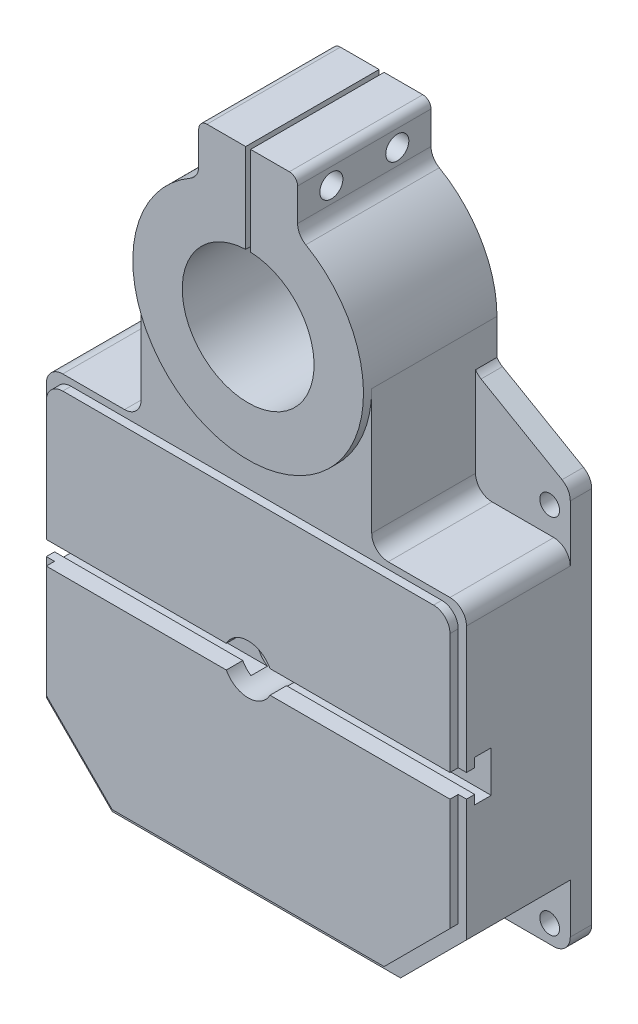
ISO-10303-21;
HEADER;
FILE_DESCRIPTION(('STEP AP214'),'2;1');
FILE_NAME('part.step','',(''),(''),'','','');
FILE_SCHEMA(('AUTOMOTIVE_DESIGN { 1 0 10303 214 1 1 1 1 }'));
ENDSEC;
DATA;
#1=APPLICATION_CONTEXT('core data for automotive mechanical design processes');
#2=APPLICATION_PROTOCOL_DEFINITION('international standard','automotive_design',2000,#1);
#3=PRODUCT_CONTEXT('',#1,'mechanical');
#4=PRODUCT('Part','Part','',(#3));
#5=PRODUCT_RELATED_PRODUCT_CATEGORY('part','',(#4));
#6=PRODUCT_DEFINITION_FORMATION('','',#4);
#7=PRODUCT_DEFINITION_CONTEXT('part definition',#1,'design');
#8=PRODUCT_DEFINITION('design','',#6,#7);
#9=PRODUCT_DEFINITION_SHAPE('','',#8);
#10=(LENGTH_UNIT() NAMED_UNIT(*) SI_UNIT(.MILLI.,.METRE.));
#11=(NAMED_UNIT(*) PLANE_ANGLE_UNIT() SI_UNIT($,.RADIAN.));
#12=(NAMED_UNIT(*) SI_UNIT($,.STERADIAN.) SOLID_ANGLE_UNIT());
#13=UNCERTAINTY_MEASURE_WITH_UNIT(LENGTH_MEASURE(1.E-05),#10,'distance_accuracy_value','');
#14=(GEOMETRIC_REPRESENTATION_CONTEXT(3) GLOBAL_UNCERTAINTY_ASSIGNED_CONTEXT((#13)) GLOBAL_UNIT_ASSIGNED_CONTEXT((#10,
#11,#12)) REPRESENTATION_CONTEXT('',''));
#15=CARTESIAN_POINT('',(0.,0.,0.));
#16=DIRECTION('',(0.,0.,1.));
#17=DIRECTION('',(1.,0.,0.));
#18=AXIS2_PLACEMENT_3D('',#15,#16,#17);
#19=CARTESIAN_POINT('',(0.,274.,13.));
#20=DIRECTION('',(0.,-1.,0.));
#21=DIRECTION('',(0.,0.,-1.));
#22=AXIS2_PLACEMENT_3D('',#19,#20,#21);
#23=PLANE('',#22);
#24=DIRECTION('',(-1.,0.,0.));
#25=VECTOR('',#24,1.);
#26=CARTESIAN_POINT('',(0.,274.,0.));
#27=LINE('',#26,#25);
#28=CARTESIAN_POINT('',(25.,274.,0.));
#29=VERTEX_POINT('',#28);
#30=CARTESIAN_POINT('',(1.50000000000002,274.,0.));
#31=VERTEX_POINT('',#30);
#32=EDGE_CURVE('E579',#29,#31,#27,.T.);
#33=ORIENTED_EDGE('',*,*,#32,.T.);
#34=DIRECTION('',(0.,0.,-1.));
#35=VECTOR('',#34,1.);
#36=CARTESIAN_POINT('',(1.50000000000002,274.,95.6870353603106));
#37=LINE('',#36,#35);
#38=CARTESIAN_POINT('',(1.50000000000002,274.,81.));
#39=VERTEX_POINT('',#38);
#40=EDGE_CURVE('E567',#39,#31,#37,.T.);
#41=ORIENTED_EDGE('',*,*,#40,.F.);
#42=DIRECTION('',(-1.,0.,0.));
#43=VECTOR('',#42,1.);
#44=CARTESIAN_POINT('',(25.,274.,81.));
#45=LINE('',#44,#43);
#46=CARTESIAN_POINT('',(25.,274.,81.));
#47=VERTEX_POINT('',#46);
#48=EDGE_CURVE('E577',#47,#39,#45,.T.);
#49=ORIENTED_EDGE('',*,*,#48,.F.);
#50=DIRECTION('',(0.,0.,-1.));
#51=VECTOR('',#50,1.);
#52=CARTESIAN_POINT('',(25.,274.,13.));
#53=LINE('',#52,#51);
#54=EDGE_CURVE('E850',#47,#29,#53,.T.);
#55=ORIENTED_EDGE('',*,*,#54,.T.);
#56=EDGE_LOOP('',(#33,#41,#49,#55));
#57=FACE_BOUND('',#56,.T.);
#58=ADVANCED_FACE('F36',(#57),#23,.F.);
#59=CARTESIAN_POINT('',(117.5,84.,76.));
#60=DIRECTION('',(0.,0.,-1.));
#61=DIRECTION('',(-1.,0.,0.));
#62=AXIS2_PLACEMENT_3D('',#59,#60,#61);
#63=PLANE('',#62);
#64=DIRECTION('',(0.,-1.,0.));
#65=VECTOR('',#64,1.);
#66=CARTESIAN_POINT('',(-127.5,83.9999999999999,76.));
#67=LINE('',#66,#65);
#68=CARTESIAN_POINT('',(-127.5,83.9999999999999,76.));
#69=VERTEX_POINT('',#68);
#70=CARTESIAN_POINT('',(-127.5,7.,76.));
#71=VERTEX_POINT('',#70);
#72=EDGE_CURVE('E713',#69,#71,#67,.T.);
#73=ORIENTED_EDGE('',*,*,#72,.T.);
#74=DIRECTION('',(1.,0.,0.));
#75=VECTOR('',#74,1.);
#76=CARTESIAN_POINT('',(117.5,7.00000000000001,76.));
#77=LINE('',#76,#75);
#78=CARTESIAN_POINT('',(-122.5,7.00000000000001,76.));
#79=VERTEX_POINT('',#78);
#80=EDGE_CURVE('E991',#71,#79,#77,.T.);
#81=ORIENTED_EDGE('',*,*,#80,.T.);
#82=DIRECTION('',(0.,-1.,0.));
#83=VECTOR('',#82,1.);
#84=CARTESIAN_POINT('',(-122.5,-75.,76.));
#85=LINE('',#84,#83);
#86=CARTESIAN_POINT('',(-122.5,79.9999999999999,76.));
#87=VERTEX_POINT('',#86);
#88=EDGE_CURVE('E646',#87,#79,#85,.T.);
#89=ORIENTED_EDGE('',*,*,#88,.F.);
#90=CARTESIAN_POINT('',(-112.5,80.,76.));
#91=DIRECTION('',(0.,0.,1.));
#92=DIRECTION('',(1.,0.,0.));
#93=AXIS2_PLACEMENT_3D('',#90,#91,#92);
#94=CIRCLE('',#93,9.99999999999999);
#95=CARTESIAN_POINT('',(-112.5,90.,76.));
#96=VERTEX_POINT('',#95);
#97=EDGE_CURVE('E642',#96,#87,#94,.T.);
#98=ORIENTED_EDGE('',*,*,#97,.F.);
#99=DIRECTION('',(-1.,0.,0.));
#100=VECTOR('',#99,1.);
#101=CARTESIAN_POINT('',(-112.5,90.,76.));
#102=LINE('',#101,#100);
#103=CARTESIAN_POINT('',(112.5,90.,76.));
#104=VERTEX_POINT('',#103);
#105=EDGE_CURVE('E639',#104,#96,#102,.T.);
#106=ORIENTED_EDGE('',*,*,#105,.F.);
#107=CARTESIAN_POINT('',(112.5,80.,76.));
#108=DIRECTION('',(0.,0.,1.));
#109=DIRECTION('',(-1.,0.,0.));
#110=AXIS2_PLACEMENT_3D('',#107,#108,#109);
#111=CIRCLE('',#110,9.99999999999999);
#112=CARTESIAN_POINT('',(122.5,79.9999999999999,76.));
#113=VERTEX_POINT('',#112);
#114=EDGE_CURVE('E613',#113,#104,#111,.T.);
#115=ORIENTED_EDGE('',*,*,#114,.F.);
#116=DIRECTION('',(0.,1.,0.));
#117=VECTOR('',#116,1.);
#118=CARTESIAN_POINT('',(122.5,79.9999999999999,76.));
#119=LINE('',#118,#117);
#120=CARTESIAN_POINT('',(122.5,7.00000000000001,76.));
#121=VERTEX_POINT('',#120);
#122=EDGE_CURVE('E658',#121,#113,#119,.T.);
#123=ORIENTED_EDGE('',*,*,#122,.F.);
#124=CARTESIAN_POINT('',(127.5,7.,76.));
#125=VERTEX_POINT('',#124);
#126=EDGE_CURVE('E997',#121,#125,#77,.T.);
#127=ORIENTED_EDGE('',*,*,#126,.T.);
#128=DIRECTION('',(0.,1.,0.));
#129=VECTOR('',#128,1.);
#130=CARTESIAN_POINT('',(127.5,-81.,76.));
#131=LINE('',#130,#129);
#132=CARTESIAN_POINT('',(127.5,83.9999999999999,76.));
#133=VERTEX_POINT('',#132);
#134=EDGE_CURVE('E722',#125,#133,#131,.T.);
#135=ORIENTED_EDGE('',*,*,#134,.T.);
#136=CARTESIAN_POINT('',(117.5,84.,76.));
#137=DIRECTION('',(0.,0.,1.));
#138=DIRECTION('',(-1.,0.,0.));
#139=AXIS2_PLACEMENT_3D('',#136,#137,#138);
#140=CIRCLE('',#139,9.99999999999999);
#141=CARTESIAN_POINT('',(117.5,94.,76.));
#142=VERTEX_POINT('',#141);
#143=EDGE_CURVE('E694',#133,#142,#140,.T.);
#144=ORIENTED_EDGE('',*,*,#143,.T.);
#145=DIRECTION('',(-1.,0.,0.));
#146=VECTOR('',#145,1.);
#147=CARTESIAN_POINT('',(80.0000000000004,94.,76.));
#148=LINE('',#147,#146);
#149=CARTESIAN_POINT('',(80.0000000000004,94.,76.));
#150=VERTEX_POINT('',#149);
#151=EDGE_CURVE('E697',#142,#150,#148,.T.);
#152=ORIENTED_EDGE('',*,*,#151,.T.);
#153=CARTESIAN_POINT('',(80.0000000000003,104.,76.));
#154=DIRECTION('',(0.,0.,-1.));
#155=DIRECTION('',(1.,0.,0.));
#156=AXIS2_PLACEMENT_3D('',#153,#154,#155);
#157=CIRCLE('',#156,10.);
#158=CARTESIAN_POINT('',(70.0000000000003,104.,76.));
#159=VERTEX_POINT('',#158);
#160=EDGE_CURVE('E700',#150,#159,#157,.T.);
#161=ORIENTED_EDGE('',*,*,#160,.T.);
#162=DIRECTION('',(0.,1.,0.));
#163=VECTOR('',#162,1.);
#164=CARTESIAN_POINT('',(70.,180.,76.));
#165=LINE('',#164,#163);
#166=CARTESIAN_POINT('',(70.,180.,76.));
#167=VERTEX_POINT('',#166);
#168=EDGE_CURVE('E702',#159,#167,#165,.T.);
#169=ORIENTED_EDGE('',*,*,#168,.T.);
#170=CARTESIAN_POINT('',(0.,180.,76.));
#171=DIRECTION('',(0.,0.,1.));
#172=DIRECTION('',(1.,0.,0.));
#173=AXIS2_PLACEMENT_3D('',#170,#171,#172);
#174=CIRCLE('',#173,70.);
#175=CARTESIAN_POINT('',(-70.,180.,76.));
#176=VERTEX_POINT('',#175);
#177=EDGE_CURVE('E605',#176,#167,#174,.T.);
#178=ORIENTED_EDGE('',*,*,#177,.F.);
#179=DIRECTION('',(0.,-1.,0.));
#180=VECTOR('',#179,1.);
#181=CARTESIAN_POINT('',(-70.,180.,76.));
#182=LINE('',#181,#180);
#183=CARTESIAN_POINT('',(-69.9999999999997,104.,76.));
#184=VERTEX_POINT('',#183);
#185=EDGE_CURVE('E704',#176,#184,#182,.T.);
#186=ORIENTED_EDGE('',*,*,#185,.T.);
#187=CARTESIAN_POINT('',(-79.9999999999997,104.,76.));
#188=DIRECTION('',(0.,0.,-1.));
#189=DIRECTION('',(-1.,0.,0.));
#190=AXIS2_PLACEMENT_3D('',#187,#188,#189);
#191=CIRCLE('',#190,9.99999999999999);
#192=CARTESIAN_POINT('',(-79.9999999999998,94.,76.));
#193=VERTEX_POINT('',#192);
#194=EDGE_CURVE('E706',#184,#193,#191,.T.);
#195=ORIENTED_EDGE('',*,*,#194,.T.);
#196=DIRECTION('',(-1.,0.,0.));
#197=VECTOR('',#196,1.);
#198=CARTESIAN_POINT('',(-117.5,94.,76.));
#199=LINE('',#198,#197);
#200=CARTESIAN_POINT('',(-117.5,94.,76.));
#201=VERTEX_POINT('',#200);
#202=EDGE_CURVE('E708',#193,#201,#199,.T.);
#203=ORIENTED_EDGE('',*,*,#202,.T.);
#204=CARTESIAN_POINT('',(-117.5,84.,76.));
#205=DIRECTION('',(0.,0.,1.));
#206=DIRECTION('',(-1.,0.,0.));
#207=AXIS2_PLACEMENT_3D('',#204,#205,#206);
#208=CIRCLE('',#207,9.99999999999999);
#209=EDGE_CURVE('E710',#201,#69,#208,.T.);
#210=ORIENTED_EDGE('',*,*,#209,.T.);
#211=EDGE_LOOP('',(#73,#81,#89,#98,#106,#115,#123,#127,#135,#144,#152,#161,#169,#178,#186,#195,
#203,#210));
#212=FACE_BOUND('',#211,.T.);
#213=ADVANCED_FACE('F1272',(#212),#63,.F.);
#214=CARTESIAN_POINT('',(112.5,80.,81.));
#215=DIRECTION('',(0.,0.,-1.));
#216=DIRECTION('',(-1.,0.,0.));
#217=AXIS2_PLACEMENT_3D('',#214,#215,#216);
#218=PLANE('',#217);
#219=DIRECTION('',(0.,-1.,0.));
#220=VECTOR('',#219,1.);
#221=CARTESIAN_POINT('',(-122.5,-75.,81.));
#222=LINE('',#221,#220);
#223=CARTESIAN_POINT('',(-122.5,79.9999999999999,81.));
#224=VERTEX_POINT('',#223);
#225=CARTESIAN_POINT('',(-122.5,7.00000000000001,81.));
#226=VERTEX_POINT('',#225);
#227=EDGE_CURVE('E623',#224,#226,#222,.T.);
#228=ORIENTED_EDGE('',*,*,#227,.T.);
#229=DIRECTION('',(1.,0.,0.));
#230=VECTOR('',#229,1.);
#231=CARTESIAN_POINT('',(112.5,7.00000000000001,81.));
#232=LINE('',#231,#230);
#233=CARTESIAN_POINT('',(-13.2664991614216,7.00000000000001,81.));
#234=VERTEX_POINT('',#233);
#235=EDGE_CURVE('E992',#226,#234,#232,.T.);
#236=ORIENTED_EDGE('',*,*,#235,.T.);
#237=CARTESIAN_POINT('',(0.,0.,81.));
#238=DIRECTION('',(0.,0.,1.));
#239=DIRECTION('',(1.,0.,0.));
#240=AXIS2_PLACEMENT_3D('',#237,#238,#239);
#241=CIRCLE('',#240,15.);
#242=CARTESIAN_POINT('',(13.2664991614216,7.00000000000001,81.));
#243=VERTEX_POINT('',#242);
#244=EDGE_CURVE('E610',#243,#234,#241,.T.);
#245=ORIENTED_EDGE('',*,*,#244,.F.);
#246=CARTESIAN_POINT('',(122.5,7.00000000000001,81.));
#247=VERTEX_POINT('',#246);
#248=EDGE_CURVE('E1000',#243,#247,#232,.T.);
#249=ORIENTED_EDGE('',*,*,#248,.T.);
#250=DIRECTION('',(0.,1.,0.));
#251=VECTOR('',#250,1.);
#252=CARTESIAN_POINT('',(122.5,79.9999999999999,81.));
#253=LINE('',#252,#251);
#254=CARTESIAN_POINT('',(122.5,79.9999999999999,81.));
#255=VERTEX_POINT('',#254);
#256=EDGE_CURVE('E632',#247,#255,#253,.T.);
#257=ORIENTED_EDGE('',*,*,#256,.T.);
#258=CARTESIAN_POINT('',(112.5,80.,81.));
#259=DIRECTION('',(0.,0.,1.));
#260=DIRECTION('',(-1.,0.,0.));
#261=AXIS2_PLACEMENT_3D('',#258,#259,#260);
#262=CIRCLE('',#261,9.99999999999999);
#263=CARTESIAN_POINT('',(112.5,90.,81.));
#264=VERTEX_POINT('',#263);
#265=EDGE_CURVE('E614',#255,#264,#262,.T.);
#266=ORIENTED_EDGE('',*,*,#265,.T.);
#267=DIRECTION('',(-1.,0.,0.));
#268=VECTOR('',#267,1.);
#269=CARTESIAN_POINT('',(-112.5,90.,81.));
#270=LINE('',#269,#268);
#271=CARTESIAN_POINT('',(-112.5,90.,81.));
#272=VERTEX_POINT('',#271);
#273=EDGE_CURVE('E617',#264,#272,#270,.T.);
#274=ORIENTED_EDGE('',*,*,#273,.T.);
#275=CARTESIAN_POINT('',(-112.5,80.,81.));
#276=DIRECTION('',(0.,0.,1.));
#277=DIRECTION('',(1.,0.,0.));
#278=AXIS2_PLACEMENT_3D('',#275,#276,#277);
#279=CIRCLE('',#278,9.99999999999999);
#280=EDGE_CURVE('E620',#272,#224,#279,.T.);
#281=ORIENTED_EDGE('',*,*,#280,.T.);
#282=EDGE_LOOP('',(#228,#236,#245,#249,#257,#266,#274,#281));
#283=FACE_BOUND('',#282,.T.);
#284=ADVANCED_FACE('F1266',(#283),#218,.F.);
#285=CARTESIAN_POINT('',(-122.5,-75.,81.));
#286=DIRECTION('',(1.,0.,0.));
#287=DIRECTION('',(0.,1.,0.));
#288=AXIS2_PLACEMENT_3D('',#285,#286,#287);
#289=PLANE('',#288);
#290=ORIENTED_EDGE('',*,*,#88,.T.);
#291=DIRECTION('',(0.,0.,1.));
#292=VECTOR('',#291,1.);
#293=CARTESIAN_POINT('',(-122.5,7.00000000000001,81.));
#294=LINE('',#293,#292);
#295=EDGE_CURVE('E998',#79,#226,#294,.T.);
#296=ORIENTED_EDGE('',*,*,#295,.T.);
#297=ORIENTED_EDGE('',*,*,#227,.F.);
#298=DIRECTION('',(0.,0.,-1.));
#299=VECTOR('',#298,1.);
#300=CARTESIAN_POINT('',(-122.5,79.9999999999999,81.));
#301=LINE('',#300,#299);
#302=EDGE_CURVE('E675',#224,#87,#301,.T.);
#303=ORIENTED_EDGE('',*,*,#302,.T.);
#304=EDGE_LOOP('',(#290,#296,#297,#303));
#305=FACE_BOUND('',#304,.T.);
#306=ADVANCED_FACE('F1264',(#305),#289,.F.);
#307=CARTESIAN_POINT('',(122.5,79.9999999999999,81.));
#308=DIRECTION('',(-1.,0.,0.));
#309=DIRECTION('',(0.,-1.,0.));
#310=AXIS2_PLACEMENT_3D('',#307,#308,#309);
#311=PLANE('',#310);
#312=ORIENTED_EDGE('',*,*,#256,.F.);
#313=DIRECTION('',(0.,0.,-1.));
#314=VECTOR('',#313,1.);
#315=CARTESIAN_POINT('',(122.5,7.00000000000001,81.));
#316=LINE('',#315,#314);
#317=EDGE_CURVE('E945',#247,#121,#316,.T.);
#318=ORIENTED_EDGE('',*,*,#317,.T.);
#319=ORIENTED_EDGE('',*,*,#122,.T.);
#320=DIRECTION('',(0.,0.,-1.));
#321=VECTOR('',#320,1.);
#322=CARTESIAN_POINT('',(122.5,79.9999999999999,81.));
#323=LINE('',#322,#321);
#324=EDGE_CURVE('E636',#255,#113,#323,.T.);
#325=ORIENTED_EDGE('',*,*,#324,.F.);
#326=EDGE_LOOP('',(#312,#318,#319,#325));
#327=FACE_BOUND('',#326,.T.);
#328=ADVANCED_FACE('F1283',(#327),#311,.F.);
#329=CARTESIAN_POINT('',(-115.5,72.,58.));
#330=DIRECTION('',(-1.,0.,0.));
#331=DIRECTION('',(0.,-1.,0.));
#332=AXIS2_PLACEMENT_3D('',#329,#330,#331);
#333=PLANE('',#332);
#334=CARTESIAN_POINT('',(-115.5,59.,34.));
#335=DIRECTION('',(-1.,0.,0.));
#336=DIRECTION('',(0.,0.,1.));
#337=AXIS2_PLACEMENT_3D('',#334,#335,#336);
#338=CIRCLE('',#337,11.);
#339=CARTESIAN_POINT('',(-115.5,59.,45.));
#340=VERTEX_POINT('',#339);
#341=EDGE_CURVE('E1500',#340,#340,#338,.T.);
#342=ORIENTED_EDGE('',*,*,#341,.T.);
#343=EDGE_LOOP('',(#342));
#344=FACE_BOUND('',#343,.T.);
#345=DIRECTION('',(0.,0.,1.));
#346=VECTOR('',#345,1.);
#347=CARTESIAN_POINT('',(-115.5,-22.5,41.));
#348=LINE('',#347,#346);
#349=CARTESIAN_POINT('',(-115.5,-22.5,41.));
#350=VERTEX_POINT('',#349);
#351=CARTESIAN_POINT('',(-115.5,-22.5,58.));
#352=VERTEX_POINT('',#351);
#353=EDGE_CURVE('E1029',#350,#352,#348,.T.);
#354=ORIENTED_EDGE('',*,*,#353,.T.);
#355=DIRECTION('',(0.,1.,0.));
#356=VECTOR('',#355,1.);
#357=CARTESIAN_POINT('',(-115.5,72.,58.));
#358=LINE('',#357,#356);
#359=CARTESIAN_POINT('',(-115.5,-69.,58.));
#360=VERTEX_POINT('',#359);
#361=EDGE_CURVE('E1081',#360,#352,#358,.T.);
#362=ORIENTED_EDGE('',*,*,#361,.F.);
#363=DIRECTION('',(0.,0.,-1.));
#364=VECTOR('',#363,1.);
#365=CARTESIAN_POINT('',(-115.5,-69.,58.));
#366=LINE('',#365,#364);
#367=CARTESIAN_POINT('',(-115.5,-69.,0.));
#368=VERTEX_POINT('',#367);
#369=EDGE_CURVE('E1132',#360,#368,#366,.T.);
#370=ORIENTED_EDGE('',*,*,#369,.T.);
#371=DIRECTION('',(0.,1.,0.));
#372=VECTOR('',#371,1.);
#373=CARTESIAN_POINT('',(-115.5,72.,0.));
#374=LINE('',#373,#372);
#375=CARTESIAN_POINT('',(-115.5,72.,0.));
#376=VERTEX_POINT('',#375);
#377=EDGE_CURVE('E1039',#368,#376,#374,.T.);
#378=ORIENTED_EDGE('',*,*,#377,.T.);
#379=DIRECTION('',(0.,0.,-1.));
#380=VECTOR('',#379,1.);
#381=CARTESIAN_POINT('',(-115.5,72.,58.));
#382=LINE('',#381,#380);
#383=CARTESIAN_POINT('',(-115.5,72.,58.));
#384=VERTEX_POINT('',#383);
#385=EDGE_CURVE('E1130',#384,#376,#382,.T.);
#386=ORIENTED_EDGE('',*,*,#385,.F.);
#387=CARTESIAN_POINT('',(-115.5,22.5,58.));
#388=VERTEX_POINT('',#387);
#389=EDGE_CURVE('E1080',#388,#384,#358,.T.);
#390=ORIENTED_EDGE('',*,*,#389,.F.);
#391=DIRECTION('',(0.,0.,1.));
#392=VECTOR('',#391,1.);
#393=CARTESIAN_POINT('',(-115.5,22.5,41.));
#394=LINE('',#393,#392);
#395=CARTESIAN_POINT('',(-115.5,22.5,41.));
#396=VERTEX_POINT('',#395);
#397=EDGE_CURVE('E1026',#396,#388,#394,.T.);
#398=ORIENTED_EDGE('',*,*,#397,.F.);
#399=DIRECTION('',(0.,1.,0.));
#400=VECTOR('',#399,1.);
#401=CARTESIAN_POINT('',(-115.5,22.5,41.));
#402=LINE('',#401,#400);
#403=EDGE_CURVE('E1013',#350,#396,#402,.T.);
#404=ORIENTED_EDGE('',*,*,#403,.F.);
#405=EDGE_LOOP('',(#354,#362,#370,#378,#386,#390,#398,#404));
#406=FACE_BOUND('',#405,.T.);
#407=ADVANCED_FACE('F2079',(#344,#406),#333,.F.);
#408=CARTESIAN_POINT('',(115.5,-69.,58.));
#409=DIRECTION('',(1.,0.,0.));
#410=DIRECTION('',(0.,1.,0.));
#411=AXIS2_PLACEMENT_3D('',#408,#409,#410);
#412=PLANE('',#411);
#413=DIRECTION('',(0.,0.,1.));
#414=VECTOR('',#413,1.);
#415=CARTESIAN_POINT('',(115.5,-22.5,41.));
#416=LINE('',#415,#414);
#417=CARTESIAN_POINT('',(115.5,-22.5,41.));
#418=VERTEX_POINT('',#417);
#419=CARTESIAN_POINT('',(115.5,-22.5,58.));
#420=VERTEX_POINT('',#419);
#421=EDGE_CURVE('E1031',#418,#420,#416,.T.);
#422=ORIENTED_EDGE('',*,*,#421,.F.);
#423=DIRECTION('',(0.,-1.,0.));
#424=VECTOR('',#423,1.);
#425=CARTESIAN_POINT('',(115.5,22.5,41.));
#426=LINE('',#425,#424);
#427=CARTESIAN_POINT('',(115.5,22.5,41.));
#428=VERTEX_POINT('',#427);
#429=EDGE_CURVE('E1006',#428,#418,#426,.T.);
#430=ORIENTED_EDGE('',*,*,#429,.F.);
#431=DIRECTION('',(0.,0.,1.));
#432=VECTOR('',#431,1.);
#433=CARTESIAN_POINT('',(115.5,22.5,41.));
#434=LINE('',#433,#432);
#435=CARTESIAN_POINT('',(115.5,22.5,58.));
#436=VERTEX_POINT('',#435);
#437=EDGE_CURVE('E1019',#428,#436,#434,.T.);
#438=ORIENTED_EDGE('',*,*,#437,.T.);
#439=DIRECTION('',(0.,-1.,0.));
#440=VECTOR('',#439,1.);
#441=CARTESIAN_POINT('',(115.5,-69.,58.));
#442=LINE('',#441,#440);
#443=CARTESIAN_POINT('',(115.5,71.9999999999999,58.));
#444=VERTEX_POINT('',#443);
#445=EDGE_CURVE('E1069',#444,#436,#442,.T.);
#446=ORIENTED_EDGE('',*,*,#445,.F.);
#447=DIRECTION('',(0.,0.,-1.));
#448=VECTOR('',#447,1.);
#449=CARTESIAN_POINT('',(115.5,71.9999999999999,58.));
#450=LINE('',#449,#448);
#451=CARTESIAN_POINT('',(115.5,71.9999999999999,0.));
#452=VERTEX_POINT('',#451);
#453=EDGE_CURVE('E1140',#444,#452,#450,.T.);
#454=ORIENTED_EDGE('',*,*,#453,.T.);
#455=DIRECTION('',(0.,-1.,0.));
#456=VECTOR('',#455,1.);
#457=CARTESIAN_POINT('',(115.5,-69.,0.));
#458=LINE('',#457,#456);
#459=CARTESIAN_POINT('',(115.5,-69.,0.));
#460=VERTEX_POINT('',#459);
#461=EDGE_CURVE('E1116',#452,#460,#458,.T.);
#462=ORIENTED_EDGE('',*,*,#461,.T.);
#463=DIRECTION('',(0.,0.,-1.));
#464=VECTOR('',#463,1.);
#465=CARTESIAN_POINT('',(115.5,-69.,58.));
#466=LINE('',#465,#464);
#467=CARTESIAN_POINT('',(115.5,-69.,58.));
#468=VERTEX_POINT('',#467);
#469=EDGE_CURVE('E1138',#468,#460,#466,.T.);
#470=ORIENTED_EDGE('',*,*,#469,.F.);
#471=EDGE_CURVE('E1068',#420,#468,#442,.T.);
#472=ORIENTED_EDGE('',*,*,#471,.F.);
#473=EDGE_LOOP('',(#422,#430,#438,#446,#454,#462,#470,#472));
#474=FACE_BOUND('',#473,.T.);
#475=ADVANCED_FACE('F2082',(#474),#412,.F.);
#476=CARTESIAN_POINT('',(-105.5,72.,58.));
#477=DIRECTION('',(0.,0.,1.));
#478=DIRECTION('',(1.,0.,0.));
#479=AXIS2_PLACEMENT_3D('',#476,#477,#478);
#480=PLANE('',#479);
#481=DIRECTION('',(-1.,0.,0.));
#482=VECTOR('',#481,1.);
#483=CARTESIAN_POINT('',(-115.5,-22.5,58.));
#484=LINE('',#483,#482);
#485=EDGE_CURVE('E1005',#420,#352,#484,.T.);
#486=ORIENTED_EDGE('',*,*,#485,.F.);
#487=ORIENTED_EDGE('',*,*,#471,.T.);
#488=DIRECTION('',(-0.707106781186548,-0.707106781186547,0.));
#489=VECTOR('',#488,1.);
#490=CARTESIAN_POINT('',(75.5,-109.,58.));
#491=LINE('',#490,#489);
#492=CARTESIAN_POINT('',(75.5,-109.,58.));
#493=VERTEX_POINT('',#492);
#494=EDGE_CURVE('E1071',#468,#493,#491,.T.);
#495=ORIENTED_EDGE('',*,*,#494,.T.);
#496=DIRECTION('',(-1.,0.,0.));
#497=VECTOR('',#496,1.);
#498=CARTESIAN_POINT('',(-75.5,-109.,58.));
#499=LINE('',#498,#497);
#500=CARTESIAN_POINT('',(-75.5,-109.,58.));
#501=VERTEX_POINT('',#500);
#502=EDGE_CURVE('E1074',#493,#501,#499,.T.);
#503=ORIENTED_EDGE('',*,*,#502,.T.);
#504=DIRECTION('',(-0.707106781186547,0.707106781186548,0.));
#505=VECTOR('',#504,1.);
#506=CARTESIAN_POINT('',(-115.5,-69.,58.));
#507=LINE('',#506,#505);
#508=EDGE_CURVE('E1077',#501,#360,#507,.T.);
#509=ORIENTED_EDGE('',*,*,#508,.T.);
#510=ORIENTED_EDGE('',*,*,#361,.T.);
#511=EDGE_LOOP('',(#486,#487,#495,#503,#509,#510));
#512=FACE_BOUND('',#511,.T.);
#513=ADVANCED_FACE('F2084',(#512),#480,.F.);
#514=DIRECTION('',(1.,0.,0.));
#515=VECTOR('',#514,1.);
#516=CARTESIAN_POINT('',(-115.5,22.5,58.));
#517=LINE('',#516,#515);
#518=EDGE_CURVE('E1010',#388,#436,#517,.T.);
#519=ORIENTED_EDGE('',*,*,#518,.F.);
#520=ORIENTED_EDGE('',*,*,#389,.T.);
#521=CARTESIAN_POINT('',(-105.5,72.,58.));
#522=DIRECTION('',(0.,0.,-1.));
#523=DIRECTION('',(1.,0.,0.));
#524=AXIS2_PLACEMENT_3D('',#521,#522,#523);
#525=CIRCLE('',#524,9.99999999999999);
#526=CARTESIAN_POINT('',(-105.5,82.,58.));
#527=VERTEX_POINT('',#526);
#528=EDGE_CURVE('E1035',#384,#527,#525,.T.);
#529=ORIENTED_EDGE('',*,*,#528,.T.);
#530=DIRECTION('',(1.,0.,0.));
#531=VECTOR('',#530,1.);
#532=CARTESIAN_POINT('',(-69.0000000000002,82.,58.));
#533=LINE('',#532,#531);
#534=CARTESIAN_POINT('',(-69.0000000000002,82.,58.));
#535=VERTEX_POINT('',#534);
#536=EDGE_CURVE('E1038',#527,#535,#533,.T.);
#537=ORIENTED_EDGE('',*,*,#536,.T.);
#538=CARTESIAN_POINT('',(-69.0000000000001,92.,58.));
#539=DIRECTION('',(0.,0.,1.));
#540=DIRECTION('',(-1.,0.,0.));
#541=AXIS2_PLACEMENT_3D('',#538,#539,#540);
#542=CIRCLE('',#541,10.);
#543=CARTESIAN_POINT('',(-59.0000000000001,92.0000000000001,58.));
#544=VERTEX_POINT('',#543);
#545=EDGE_CURVE('E1042',#535,#544,#542,.T.);
#546=ORIENTED_EDGE('',*,*,#545,.T.);
#547=DIRECTION('',(0.,1.,0.));
#548=VECTOR('',#547,1.);
#549=CARTESIAN_POINT('',(-59.,117.,58.));
#550=LINE('',#549,#548);
#551=CARTESIAN_POINT('',(-59.,117.,58.));
#552=VERTEX_POINT('',#551);
#553=EDGE_CURVE('E1045',#544,#552,#550,.T.);
#554=ORIENTED_EDGE('',*,*,#553,.T.);
#555=CARTESIAN_POINT('',(-49.,117.,58.));
#556=DIRECTION('',(0.,0.,-1.));
#557=DIRECTION('',(1.,0.,0.));
#558=AXIS2_PLACEMENT_3D('',#555,#556,#557);
#559=CIRCLE('',#558,10.);
#560=CARTESIAN_POINT('',(-48.9999999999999,127.,58.));
#561=VERTEX_POINT('',#560);
#562=EDGE_CURVE('E1048',#552,#561,#559,.T.);
#563=ORIENTED_EDGE('',*,*,#562,.T.);
#564=DIRECTION('',(1.,0.,0.));
#565=VECTOR('',#564,1.);
#566=CARTESIAN_POINT('',(0.,127.,58.));
#567=LINE('',#566,#565);
#568=CARTESIAN_POINT('',(48.9999999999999,127.,58.));
#569=VERTEX_POINT('',#568);
#570=EDGE_CURVE('E1051',#561,#569,#567,.T.);
#571=ORIENTED_EDGE('',*,*,#570,.T.);
#572=CARTESIAN_POINT('',(49.,117.,58.));
#573=DIRECTION('',(0.,0.,-1.));
#574=DIRECTION('',(-1.,0.,0.));
#575=AXIS2_PLACEMENT_3D('',#572,#573,#574);
#576=CIRCLE('',#575,10.);
#577=CARTESIAN_POINT('',(59.,117.,58.));
#578=VERTEX_POINT('',#577);
#579=EDGE_CURVE('E1053',#569,#578,#576,.T.);
#580=ORIENTED_EDGE('',*,*,#579,.T.);
#581=DIRECTION('',(0.,-1.,0.));
#582=VECTOR('',#581,1.);
#583=CARTESIAN_POINT('',(59.,117.,58.));
#584=LINE('',#583,#582);
#585=CARTESIAN_POINT('',(58.9999999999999,92.0000000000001,58.));
#586=VERTEX_POINT('',#585);
#587=EDGE_CURVE('E1056',#578,#586,#584,.T.);
#588=ORIENTED_EDGE('',*,*,#587,.T.);
#589=CARTESIAN_POINT('',(68.9999999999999,92.,58.));
#590=DIRECTION('',(0.,0.,1.));
#591=DIRECTION('',(1.,0.,0.));
#592=AXIS2_PLACEMENT_3D('',#589,#590,#591);
#593=CIRCLE('',#592,10.);
#594=CARTESIAN_POINT('',(69.,82.,58.));
#595=VERTEX_POINT('',#594);
#596=EDGE_CURVE('E1059',#586,#595,#593,.T.);
#597=ORIENTED_EDGE('',*,*,#596,.T.);
#598=DIRECTION('',(1.,0.,0.));
#599=VECTOR('',#598,1.);
#600=CARTESIAN_POINT('',(105.5,82.,58.));
#601=LINE('',#600,#599);
#602=CARTESIAN_POINT('',(105.5,82.,58.));
#603=VERTEX_POINT('',#602);
#604=EDGE_CURVE('E1062',#595,#603,#601,.T.);
#605=ORIENTED_EDGE('',*,*,#604,.T.);
#606=CARTESIAN_POINT('',(105.5,72.,58.));
#607=DIRECTION('',(0.,0.,-1.));
#608=DIRECTION('',(1.,0.,0.));
#609=AXIS2_PLACEMENT_3D('',#606,#607,#608);
#610=CIRCLE('',#609,9.99999999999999);
#611=EDGE_CURVE('E1065',#603,#444,#610,.T.);
#612=ORIENTED_EDGE('',*,*,#611,.T.);
#613=ORIENTED_EDGE('',*,*,#445,.T.);
#614=EDGE_LOOP('',(#519,#520,#529,#537,#546,#554,#563,#571,#580,#588,#597,#605,#612,#613));
#615=FACE_BOUND('',#614,.T.);
#616=ADVANCED_FACE('F2092',(#615),#480,.F.);
#617=CARTESIAN_POINT('',(127.5,-81.,76.));
#618=VERTEX_POINT('',#617);
#619=CARTESIAN_POINT('',(127.5,-7.,76.));
#620=VERTEX_POINT('',#619);
#621=EDGE_CURVE('E723',#618,#620,#131,.T.);
#622=ORIENTED_EDGE('',*,*,#621,.T.);
#623=DIRECTION('',(-1.,0.,0.));
#624=VECTOR('',#623,1.);
#625=CARTESIAN_POINT('',(117.5,-7.00000000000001,76.));
#626=LINE('',#625,#624);
#627=CARTESIAN_POINT('',(122.5,-7.00000000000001,76.));
#628=VERTEX_POINT('',#627);
#629=EDGE_CURVE('E1246',#620,#628,#626,.T.);
#630=ORIENTED_EDGE('',*,*,#629,.T.);
#631=CARTESIAN_POINT('',(122.5,-75.,76.));
#632=VERTEX_POINT('',#631);
#633=EDGE_CURVE('E618',#632,#628,#119,.T.);
#634=ORIENTED_EDGE('',*,*,#633,.F.);
#635=DIRECTION('',(0.707106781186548,0.707106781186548,0.));
#636=VECTOR('',#635,1.);
#637=CARTESIAN_POINT('',(122.5,-75.,76.));
#638=LINE('',#637,#636);
#639=CARTESIAN_POINT('',(82.5,-115.,76.));
#640=VERTEX_POINT('',#639);
#641=EDGE_CURVE('E655',#640,#632,#638,.T.);
#642=ORIENTED_EDGE('',*,*,#641,.F.);
#643=DIRECTION('',(1.,0.,0.));
#644=VECTOR('',#643,1.);
#645=CARTESIAN_POINT('',(82.5,-115.,76.));
#646=LINE('',#645,#644);
#647=CARTESIAN_POINT('',(-82.4999999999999,-115.,76.));
#648=VERTEX_POINT('',#647);
#649=EDGE_CURVE('E652',#648,#640,#646,.T.);
#650=ORIENTED_EDGE('',*,*,#649,.F.);
#651=DIRECTION('',(0.707106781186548,-0.707106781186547,0.));
#652=VECTOR('',#651,1.);
#653=CARTESIAN_POINT('',(-82.4999999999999,-115.,76.));
#654=LINE('',#653,#652);
#655=CARTESIAN_POINT('',(-122.5,-75.0000000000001,76.));
#656=VERTEX_POINT('',#655);
#657=EDGE_CURVE('E649',#656,#648,#654,.T.);
#658=ORIENTED_EDGE('',*,*,#657,.F.);
#659=CARTESIAN_POINT('',(-122.5,-7.00000000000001,76.));
#660=VERTEX_POINT('',#659);
#661=EDGE_CURVE('E645',#660,#656,#85,.T.);
#662=ORIENTED_EDGE('',*,*,#661,.F.);
#663=CARTESIAN_POINT('',(-127.5,-7.,76.));
#664=VERTEX_POINT('',#663);
#665=EDGE_CURVE('E1250',#660,#664,#626,.T.);
#666=ORIENTED_EDGE('',*,*,#665,.T.);
#667=CARTESIAN_POINT('',(-127.5,-81.,76.));
#668=VERTEX_POINT('',#667);
#669=EDGE_CURVE('E712',#664,#668,#67,.T.);
#670=ORIENTED_EDGE('',*,*,#669,.T.);
#671=DIRECTION('',(0.707106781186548,-0.707106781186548,0.));
#672=VECTOR('',#671,1.);
#673=CARTESIAN_POINT('',(-127.5,-81.,76.));
#674=LINE('',#673,#672);
#675=CARTESIAN_POINT('',(-87.5,-121.,76.));
#676=VERTEX_POINT('',#675);
#677=EDGE_CURVE('E716',#668,#676,#674,.T.);
#678=ORIENTED_EDGE('',*,*,#677,.T.);
#679=DIRECTION('',(1.,0.,0.));
#680=VECTOR('',#679,1.);
#681=CARTESIAN_POINT('',(-87.5,-121.,76.));
#682=LINE('',#681,#680);
#683=CARTESIAN_POINT('',(87.5,-121.,76.));
#684=VERTEX_POINT('',#683);
#685=EDGE_CURVE('E718',#676,#684,#682,.T.);
#686=ORIENTED_EDGE('',*,*,#685,.T.);
#687=DIRECTION('',(0.707106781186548,0.707106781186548,0.));
#688=VECTOR('',#687,1.);
#689=CARTESIAN_POINT('',(87.5,-121.,76.));
#690=LINE('',#689,#688);
#691=EDGE_CURVE('E720',#684,#618,#690,.T.);
#692=ORIENTED_EDGE('',*,*,#691,.T.);
#693=EDGE_LOOP('',(#622,#630,#634,#642,#650,#658,#662,#666,#670,#678,#686,#692));
#694=FACE_BOUND('',#693,.T.);
#695=ADVANCED_FACE('F1370',(#694),#63,.F.);
#696=CARTESIAN_POINT('',(-78.3661586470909,163.914441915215,13.));
#697=DIRECTION('',(0.,0.,-1.));
#698=DIRECTION('',(-1.,0.,0.));
#699=AXIS2_PLACEMENT_3D('',#696,#697,#698);
#700=CYLINDRICAL_SURFACE('',#699,10.);
#701=DIRECTION('',(0.,0.,1.));
#702=VECTOR('',#701,1.);
#703=CARTESIAN_POINT('',(-69.9999999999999,158.436541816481,0.));
#704=LINE('',#703,#702);
#705=CARTESIAN_POINT('',(-69.9999999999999,158.436541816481,0.));
#706=VERTEX_POINT('',#705);
#707=CARTESIAN_POINT('',(-69.9999999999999,158.436541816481,13.));
#708=VERTEX_POINT('',#707);
#709=EDGE_CURVE('E687',#706,#708,#704,.T.);
#710=ORIENTED_EDGE('',*,*,#709,.F.);
#711=CARTESIAN_POINT('',(-78.3661586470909,163.914441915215,0.));
#712=DIRECTION('',(0.,0.,-1.));
#713=DIRECTION('',(1.,0.,0.));
#714=AXIS2_PLACEMENT_3D('',#711,#712,#713);
#715=CIRCLE('',#714,10.);
#716=CARTESIAN_POINT('',(-73.3661586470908,155.254187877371,0.));
#717=VERTEX_POINT('',#716);
#718=EDGE_CURVE('E859',#706,#717,#715,.T.);
#719=ORIENTED_EDGE('',*,*,#718,.T.);
#720=DIRECTION('',(0.,0.,-1.));
#721=VECTOR('',#720,1.);
#722=CARTESIAN_POINT('',(-73.3661586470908,155.254187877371,13.));
#723=LINE('',#722,#721);
#724=CARTESIAN_POINT('',(-73.3661586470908,155.254187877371,13.));
#725=VERTEX_POINT('',#724);
#726=EDGE_CURVE('E929',#725,#717,#723,.T.);
#727=ORIENTED_EDGE('',*,*,#726,.F.);
#728=CARTESIAN_POINT('',(-78.3661586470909,163.914441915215,13.));
#729=DIRECTION('',(0.,0.,-1.));
#730=DIRECTION('',(1.,0.,0.));
#731=AXIS2_PLACEMENT_3D('',#728,#729,#730);
#732=CIRCLE('',#731,10.);
#733=EDGE_CURVE('E824',#708,#725,#732,.T.);
#734=ORIENTED_EDGE('',*,*,#733,.F.);
#735=EDGE_LOOP('',(#710,#719,#727,#734));
#736=FACE_BOUND('',#735,.T.);
#737=ADVANCED_FACE('F2091',(#736),#700,.F.);
#738=CARTESIAN_POINT('',(78.3661586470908,163.914441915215,13.));
#739=DIRECTION('',(0.,0.,-1.));
#740=DIRECTION('',(-1.,0.,0.));
#741=AXIS2_PLACEMENT_3D('',#738,#739,#740);
#742=CYLINDRICAL_SURFACE('',#741,10.);
#743=DIRECTION('',(0.,0.,1.));
#744=VECTOR('',#743,1.);
#745=CARTESIAN_POINT('',(70.0000000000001,158.436541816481,0.));
#746=LINE('',#745,#744);
#747=CARTESIAN_POINT('',(70.0000000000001,158.436541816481,0.));
#748=VERTEX_POINT('',#747);
#749=CARTESIAN_POINT('',(70.0000000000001,158.436541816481,13.));
#750=VERTEX_POINT('',#749);
#751=EDGE_CURVE('E691',#748,#750,#746,.T.);
#752=ORIENTED_EDGE('',*,*,#751,.T.);
#753=CARTESIAN_POINT('',(78.3661586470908,163.914441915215,13.));
#754=DIRECTION('',(0.,0.,-1.));
#755=DIRECTION('',(1.,0.,0.));
#756=AXIS2_PLACEMENT_3D('',#753,#754,#755);
#757=CIRCLE('',#756,10.);
#758=CARTESIAN_POINT('',(73.3661586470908,155.254187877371,13.));
#759=VERTEX_POINT('',#758);
#760=EDGE_CURVE('E847',#759,#750,#757,.T.);
#761=ORIENTED_EDGE('',*,*,#760,.F.);
#762=DIRECTION('',(0.,0.,-1.));
#763=VECTOR('',#762,1.);
#764=CARTESIAN_POINT('',(73.3661586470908,155.254187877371,13.));
#765=LINE('',#764,#763);
#766=CARTESIAN_POINT('',(73.3661586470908,155.254187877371,0.));
#767=VERTEX_POINT('',#766);
#768=EDGE_CURVE('E902',#759,#767,#765,.T.);
#769=ORIENTED_EDGE('',*,*,#768,.T.);
#770=CARTESIAN_POINT('',(78.3661586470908,163.914441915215,0.));
#771=DIRECTION('',(0.,0.,-1.));
#772=DIRECTION('',(1.,0.,0.));
#773=AXIS2_PLACEMENT_3D('',#770,#771,#772);
#774=CIRCLE('',#773,10.);
#775=EDGE_CURVE('E879',#767,#748,#774,.T.);
#776=ORIENTED_EDGE('',*,*,#775,.T.);
#777=EDGE_LOOP('',(#752,#761,#769,#776));
#778=FACE_BOUND('',#777,.T.);
#779=ADVANCED_FACE('F2124',(#778),#742,.F.);
#780=CARTESIAN_POINT('',(-25.,269.,13.));
#781=DIRECTION('',(0.,0.,-1.));
#782=DIRECTION('',(-1.,0.,0.));
#783=AXIS2_PLACEMENT_3D('',#780,#781,#782);
#784=PLANE('',#783);
#785=CARTESIAN_POINT('',(115.,-110.,13.));
#786=DIRECTION('',(0.,0.,1.));
#787=DIRECTION('',(-1.,0.,0.));
#788=AXIS2_PLACEMENT_3D('',#785,#786,#787);
#789=CIRCLE('',#788,6.);
#790=CARTESIAN_POINT('',(109.,-110.,13.));
#791=VERTEX_POINT('',#790);
#792=EDGE_CURVE('E803',#791,#791,#789,.T.);
#793=ORIENTED_EDGE('',*,*,#792,.F.);
#794=EDGE_LOOP('',(#793));
#795=FACE_BOUND('',#794,.T.);
#796=DIRECTION('',(0.707106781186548,0.707106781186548,0.));
#797=VECTOR('',#796,1.);
#798=CARTESIAN_POINT('',(87.5,-121.,13.));
#799=LINE('',#798,#797);
#800=CARTESIAN_POINT('',(87.5,-121.,13.));
#801=VERTEX_POINT('',#800);
#802=CARTESIAN_POINT('',(127.5,-81.,13.));
#803=VERTEX_POINT('',#802);
#804=EDGE_CURVE('E698',#801,#803,#799,.T.);
#805=ORIENTED_EDGE('',*,*,#804,.F.);
#806=DIRECTION('',(1.,0.,0.));
#807=VECTOR('',#806,1.);
#808=CARTESIAN_POINT('',(117.5,-121.,13.));
#809=LINE('',#808,#807);
#810=CARTESIAN_POINT('',(117.5,-121.,13.));
#811=VERTEX_POINT('',#810);
#812=EDGE_CURVE('E835',#801,#811,#809,.T.);
#813=ORIENTED_EDGE('',*,*,#812,.T.);
#814=CARTESIAN_POINT('',(117.5,-111.,13.));
#815=DIRECTION('',(0.,0.,1.));
#816=DIRECTION('',(-1.,0.,0.));
#817=AXIS2_PLACEMENT_3D('',#814,#815,#816);
#818=CIRCLE('',#817,9.99999999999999);
#819=CARTESIAN_POINT('',(127.5,-111.,13.));
#820=VERTEX_POINT('',#819);
#821=EDGE_CURVE('E838',#811,#820,#818,.T.);
#822=ORIENTED_EDGE('',*,*,#821,.T.);
#823=DIRECTION('',(0.,1.,0.));
#824=VECTOR('',#823,1.);
#825=CARTESIAN_POINT('',(127.5,118.226497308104,13.));
#826=LINE('',#825,#824);
#827=EDGE_CURVE('E841',#820,#803,#826,.T.);
#828=ORIENTED_EDGE('',*,*,#827,.T.);
#829=EDGE_LOOP('',(#805,#813,#822,#828));
#830=FACE_BOUND('',#829,.T.);
#831=ADVANCED_FACE('F2121',(#795,#830),#784,.F.);
#832=CARTESIAN_POINT('',(-115.,-110.,13.));
#833=DIRECTION('',(0.,0.,1.));
#834=DIRECTION('',(1.,0.,0.));
#835=AXIS2_PLACEMENT_3D('',#832,#833,#834);
#836=CIRCLE('',#835,6.);
#837=CARTESIAN_POINT('',(-121.,-110.,13.));
#838=VERTEX_POINT('',#837);
#839=EDGE_CURVE('E815',#838,#838,#836,.T.);
#840=ORIENTED_EDGE('',*,*,#839,.F.);
#841=EDGE_LOOP('',(#840));
#842=FACE_BOUND('',#841,.T.);
#843=DIRECTION('',(0.707106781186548,-0.707106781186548,0.));
#844=VECTOR('',#843,1.);
#845=CARTESIAN_POINT('',(-127.5,-81.,13.));
#846=LINE('',#845,#844);
#847=CARTESIAN_POINT('',(-127.5,-81.,13.));
#848=VERTEX_POINT('',#847);
#849=CARTESIAN_POINT('',(-87.5,-121.,13.));
#850=VERTEX_POINT('',#849);
#851=EDGE_CURVE('E752',#848,#850,#846,.T.);
#852=ORIENTED_EDGE('',*,*,#851,.F.);
#853=DIRECTION('',(0.,-1.,0.));
#854=VECTOR('',#853,1.);
#855=CARTESIAN_POINT('',(-127.5,-111.,13.));
#856=LINE('',#855,#854);
#857=CARTESIAN_POINT('',(-127.5,-111.,13.));
#858=VERTEX_POINT('',#857);
#859=EDGE_CURVE('E830',#848,#858,#856,.T.);
#860=ORIENTED_EDGE('',*,*,#859,.T.);
#861=CARTESIAN_POINT('',(-117.5,-111.,13.));
#862=DIRECTION('',(0.,0.,1.));
#863=DIRECTION('',(1.,0.,0.));
#864=AXIS2_PLACEMENT_3D('',#861,#862,#863);
#865=CIRCLE('',#864,10.);
#866=CARTESIAN_POINT('',(-117.5,-121.,13.));
#867=VERTEX_POINT('',#866);
#868=EDGE_CURVE('E833',#858,#867,#865,.T.);
#869=ORIENTED_EDGE('',*,*,#868,.T.);
#870=EDGE_CURVE('E836',#867,#850,#809,.T.);
#871=ORIENTED_EDGE('',*,*,#870,.T.);
#872=EDGE_LOOP('',(#852,#860,#869,#871));
#873=FACE_BOUND('',#872,.T.);
#874=ADVANCED_FACE('F2123',(#842,#873),#784,.F.);
#875=CARTESIAN_POINT('',(-115.,110.,13.));
#876=DIRECTION('',(0.,0.,1.));
#877=DIRECTION('',(-1.,0.,0.));
#878=AXIS2_PLACEMENT_3D('',#875,#876,#877);
#879=CIRCLE('',#878,6.);
#880=CARTESIAN_POINT('',(-121.,110.,13.));
#881=VERTEX_POINT('',#880);
#882=EDGE_CURVE('E809',#881,#881,#879,.T.);
#883=ORIENTED_EDGE('',*,*,#882,.F.);
#884=EDGE_LOOP('',(#883));
#885=FACE_BOUND('',#884,.T.);
#886=CARTESIAN_POINT('',(-117.5,84.,13.));
#887=DIRECTION('',(0.,0.,1.));
#888=DIRECTION('',(-1.,0.,0.));
#889=AXIS2_PLACEMENT_3D('',#886,#887,#888);
#890=CIRCLE('',#889,9.99999999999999);
#891=CARTESIAN_POINT('',(-117.5,94.,13.));
#892=VERTEX_POINT('',#891);
#893=CARTESIAN_POINT('',(-127.5,84.,13.));
#894=VERTEX_POINT('',#893);
#895=EDGE_CURVE('E749',#892,#894,#890,.T.);
#896=ORIENTED_EDGE('',*,*,#895,.F.);
#897=DIRECTION('',(-1.,0.,0.));
#898=VECTOR('',#897,1.);
#899=CARTESIAN_POINT('',(-117.5,94.,13.));
#900=LINE('',#899,#898);
#901=CARTESIAN_POINT('',(-79.9999999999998,94.,13.));
#902=VERTEX_POINT('',#901);
#903=EDGE_CURVE('E746',#902,#892,#900,.T.);
#904=ORIENTED_EDGE('',*,*,#903,.F.);
#905=CARTESIAN_POINT('',(-79.9999999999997,104.,13.));
#906=DIRECTION('',(0.,0.,-1.));
#907=DIRECTION('',(-1.,0.,0.));
#908=AXIS2_PLACEMENT_3D('',#905,#906,#907);
#909=CIRCLE('',#908,9.99999999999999);
#910=CARTESIAN_POINT('',(-69.9999999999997,104.,13.));
#911=VERTEX_POINT('',#910);
#912=EDGE_CURVE('E738',#911,#902,#909,.T.);
#913=ORIENTED_EDGE('',*,*,#912,.F.);
#914=DIRECTION('',(0.,-1.,0.));
#915=VECTOR('',#914,1.);
#916=CARTESIAN_POINT('',(-70.,180.,13.));
#917=LINE('',#916,#915);
#918=EDGE_CURVE('E739',#708,#911,#917,.T.);
#919=ORIENTED_EDGE('',*,*,#918,.F.);
#920=ORIENTED_EDGE('',*,*,#733,.T.);
#921=DIRECTION('',(-0.866025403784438,-0.500000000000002,0.));
#922=VECTOR('',#921,1.);
#923=CARTESIAN_POINT('',(-122.5,126.886751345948,13.));
#924=LINE('',#923,#922);
#925=CARTESIAN_POINT('',(-122.5,126.886751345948,13.));
#926=VERTEX_POINT('',#925);
#927=EDGE_CURVE('E826',#725,#926,#924,.T.);
#928=ORIENTED_EDGE('',*,*,#927,.T.);
#929=CARTESIAN_POINT('',(-117.5,118.226497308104,13.));
#930=DIRECTION('',(0.,0.,1.));
#931=DIRECTION('',(1.,0.,0.));
#932=AXIS2_PLACEMENT_3D('',#929,#930,#931);
#933=CIRCLE('',#932,10.);
#934=CARTESIAN_POINT('',(-127.5,118.226497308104,13.));
#935=VERTEX_POINT('',#934);
#936=EDGE_CURVE('E828',#926,#935,#933,.T.);
#937=ORIENTED_EDGE('',*,*,#936,.T.);
#938=EDGE_CURVE('E831',#935,#894,#856,.T.);
#939=ORIENTED_EDGE('',*,*,#938,.T.);
#940=EDGE_LOOP('',(#896,#904,#913,#919,#920,#928,#937,#939));
#941=FACE_BOUND('',#940,.T.);
#942=ADVANCED_FACE('F2130',(#885,#941),#784,.F.);
#943=CARTESIAN_POINT('',(115.,110.,13.));
#944=DIRECTION('',(0.,0.,1.));
#945=DIRECTION('',(1.,0.,0.));
#946=AXIS2_PLACEMENT_3D('',#943,#944,#945);
#947=CIRCLE('',#946,6.);
#948=CARTESIAN_POINT('',(109.,110.,13.));
#949=VERTEX_POINT('',#948);
#950=EDGE_CURVE('E797',#949,#949,#947,.T.);
#951=ORIENTED_EDGE('',*,*,#950,.F.);
#952=EDGE_LOOP('',(#951));
#953=FACE_BOUND('',#952,.T.);
#954=CARTESIAN_POINT('',(117.5,84.,13.));
#955=DIRECTION('',(0.,0.,1.));
#956=DIRECTION('',(-1.,0.,0.));
#957=AXIS2_PLACEMENT_3D('',#954,#955,#956);
#958=CIRCLE('',#957,9.99999999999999);
#959=CARTESIAN_POINT('',(127.5,84.,13.));
#960=VERTEX_POINT('',#959);
#961=CARTESIAN_POINT('',(117.5,94.,13.));
#962=VERTEX_POINT('',#961);
#963=EDGE_CURVE('E693',#960,#962,#958,.T.);
#964=ORIENTED_EDGE('',*,*,#963,.F.);
#965=CARTESIAN_POINT('',(127.5,118.226497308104,13.));
#966=VERTEX_POINT('',#965);
#967=EDGE_CURVE('E840',#960,#966,#826,.T.);
#968=ORIENTED_EDGE('',*,*,#967,.T.);
#969=CARTESIAN_POINT('',(117.5,118.226497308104,13.));
#970=DIRECTION('',(0.,0.,1.));
#971=DIRECTION('',(-1.,0.,0.));
#972=AXIS2_PLACEMENT_3D('',#969,#970,#971);
#973=CIRCLE('',#972,9.99999999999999);
#974=CARTESIAN_POINT('',(122.5,126.886751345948,13.));
#975=VERTEX_POINT('',#974);
#976=EDGE_CURVE('E843',#966,#975,#973,.T.);
#977=ORIENTED_EDGE('',*,*,#976,.T.);
#978=DIRECTION('',(-0.866025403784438,0.5,0.));
#979=VECTOR('',#978,1.);
#980=CARTESIAN_POINT('',(122.5,126.886751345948,13.));
#981=LINE('',#980,#979);
#982=EDGE_CURVE('E845',#975,#759,#981,.T.);
#983=ORIENTED_EDGE('',*,*,#982,.T.);
#984=ORIENTED_EDGE('',*,*,#760,.T.);
#985=DIRECTION('',(0.,1.,0.));
#986=VECTOR('',#985,1.);
#987=CARTESIAN_POINT('',(70.,180.,13.));
#988=LINE('',#987,#986);
#989=CARTESIAN_POINT('',(70.0000000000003,104.,13.));
#990=VERTEX_POINT('',#989);
#991=EDGE_CURVE('E735',#990,#750,#988,.T.);
#992=ORIENTED_EDGE('',*,*,#991,.F.);
#993=CARTESIAN_POINT('',(80.0000000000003,104.,13.));
#994=DIRECTION('',(0.,0.,-1.));
#995=DIRECTION('',(1.,0.,0.));
#996=AXIS2_PLACEMENT_3D('',#993,#994,#995);
#997=CIRCLE('',#996,10.);
#998=CARTESIAN_POINT('',(80.0000000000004,94.,13.));
#999=VERTEX_POINT('',#998);
#1000=EDGE_CURVE('E732',#999,#990,#997,.T.);
#1001=ORIENTED_EDGE('',*,*,#1000,.F.);
#1002=DIRECTION('',(-1.,0.,0.));
#1003=VECTOR('',#1002,1.);
#1004=CARTESIAN_POINT('',(80.0000000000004,94.,13.));
#1005=LINE('',#1004,#1003);
#1006=EDGE_CURVE('E729',#962,#999,#1005,.T.);
#1007=ORIENTED_EDGE('',*,*,#1006,.F.);
#1008=EDGE_LOOP('',(#964,#968,#977,#983,#984,#992,#1001,#1007));
#1009=FACE_BOUND('',#1008,.T.);
#1010=ADVANCED_FACE('F1933',(#953,#1009),#784,.F.);
#1011=CARTESIAN_POINT('',(-25.,269.,0.));
#1012=DIRECTION('',(0.,0.,-1.));
#1013=DIRECTION('',(-1.,0.,0.));
#1014=AXIS2_PLACEMENT_3D('',#1011,#1012,#1013);
#1015=PLANE('',#1014);
#1016=DIRECTION('',(0.,-1.,0.));
#1017=VECTOR('',#1016,1.);
#1018=CARTESIAN_POINT('',(1.50000000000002,269.,0.));
#1019=LINE('',#1018,#1017);
#1020=CARTESIAN_POINT('',(1.50000000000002,219.971865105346,0.));
#1021=VERTEX_POINT('',#1020);
#1022=EDGE_CURVE('E1175',#31,#1021,#1019,.T.);
#1023=ORIENTED_EDGE('',*,*,#1022,.F.);
#1024=ORIENTED_EDGE('',*,*,#32,.F.);
#1025=CARTESIAN_POINT('',(25.,269.,0.));
#1026=DIRECTION('',(0.,0.,1.));
#1027=DIRECTION('',(-1.,0.,0.));
#1028=AXIS2_PLACEMENT_3D('',#1025,#1026,#1027);
#1029=CIRCLE('',#1028,5.);
#1030=CARTESIAN_POINT('',(30.,269.,0.));
#1031=VERTEX_POINT('',#1030);
#1032=EDGE_CURVE('E888',#1031,#29,#1029,.T.);
#1033=ORIENTED_EDGE('',*,*,#1032,.F.);
#1034=DIRECTION('',(0.,1.,0.));
#1035=VECTOR('',#1034,1.);
#1036=CARTESIAN_POINT('',(30.,269.,0.));
#1037=LINE('',#1036,#1035);
#1038=CARTESIAN_POINT('',(30.0000000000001,249.282032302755,0.));
#1039=VERTEX_POINT('',#1038);
#1040=EDGE_CURVE('E886',#1039,#1031,#1037,.T.);
#1041=ORIENTED_EDGE('',*,*,#1040,.F.);
#1042=CARTESIAN_POINT('',(40.0000000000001,249.282032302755,0.));
#1043=DIRECTION('',(0.,0.,-1.));
#1044=DIRECTION('',(1.,0.,0.));
#1045=AXIS2_PLACEMENT_3D('',#1042,#1043,#1044);
#1046=CIRCLE('',#1045,9.99999999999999);
#1047=CARTESIAN_POINT('',(35.0000000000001,240.621778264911,0.));
#1048=VERTEX_POINT('',#1047);
#1049=EDGE_CURVE('E884',#1048,#1039,#1046,.T.);
#1050=ORIENTED_EDGE('',*,*,#1049,.F.);
#1051=CARTESIAN_POINT('',(0.,180.,0.));
#1052=DIRECTION('',(0.,0.,1.));
#1053=DIRECTION('',(1.,0.,0.));
#1054=AXIS2_PLACEMENT_3D('',#1051,#1052,#1053);
#1055=CIRCLE('',#1054,70.);
#1056=CARTESIAN_POINT('',(70.,180.,0.));
#1057=VERTEX_POINT('',#1056);
#1058=EDGE_CURVE('E882',#1057,#1048,#1055,.T.);
#1059=ORIENTED_EDGE('',*,*,#1058,.F.);
#1060=DIRECTION('',(0.,-1.,0.));
#1061=VECTOR('',#1060,1.);
#1062=CARTESIAN_POINT('',(70.,180.,0.));
#1063=LINE('',#1062,#1061);
#1064=EDGE_CURVE('E689',#1057,#748,#1063,.T.);
#1065=ORIENTED_EDGE('',*,*,#1064,.T.);
#1066=ORIENTED_EDGE('',*,*,#775,.F.);
#1067=DIRECTION('',(-0.866025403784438,0.5,0.));
#1068=VECTOR('',#1067,1.);
#1069=CARTESIAN_POINT('',(122.5,126.886751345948,0.));
#1070=LINE('',#1069,#1068);
#1071=CARTESIAN_POINT('',(122.5,126.886751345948,0.));
#1072=VERTEX_POINT('',#1071);
#1073=EDGE_CURVE('E877',#1072,#767,#1070,.T.);
#1074=ORIENTED_EDGE('',*,*,#1073,.F.);
#1075=CARTESIAN_POINT('',(117.5,118.226497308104,0.));
#1076=DIRECTION('',(0.,0.,1.));
#1077=DIRECTION('',(-1.,0.,0.));
#1078=AXIS2_PLACEMENT_3D('',#1075,#1076,#1077);
#1079=CIRCLE('',#1078,9.99999999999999);
#1080=CARTESIAN_POINT('',(127.5,118.226497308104,0.));
#1081=VERTEX_POINT('',#1080);
#1082=EDGE_CURVE('E875',#1081,#1072,#1079,.T.);
#1083=ORIENTED_EDGE('',*,*,#1082,.F.);
#1084=DIRECTION('',(0.,1.,0.));
#1085=VECTOR('',#1084,1.);
#1086=CARTESIAN_POINT('',(127.5,118.226497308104,0.));
#1087=LINE('',#1086,#1085);
#1088=CARTESIAN_POINT('',(127.5,-111.,0.));
#1089=VERTEX_POINT('',#1088);
#1090=EDGE_CURVE('E873',#1089,#1081,#1087,.T.);
#1091=ORIENTED_EDGE('',*,*,#1090,.F.);
#1092=CARTESIAN_POINT('',(117.5,-111.,0.));
#1093=DIRECTION('',(0.,0.,1.));
#1094=DIRECTION('',(-1.,0.,0.));
#1095=AXIS2_PLACEMENT_3D('',#1092,#1093,#1094);
#1096=CIRCLE('',#1095,9.99999999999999);
#1097=CARTESIAN_POINT('',(117.5,-121.,0.));
#1098=VERTEX_POINT('',#1097);
#1099=EDGE_CURVE('E871',#1098,#1089,#1096,.T.);
#1100=ORIENTED_EDGE('',*,*,#1099,.F.);
#1101=DIRECTION('',(1.,0.,0.));
#1102=VECTOR('',#1101,1.);
#1103=CARTESIAN_POINT('',(117.5,-121.,0.));
#1104=LINE('',#1103,#1102);
#1105=CARTESIAN_POINT('',(-117.5,-121.,0.));
#1106=VERTEX_POINT('',#1105);
#1107=EDGE_CURVE('E869',#1106,#1098,#1104,.T.);
#1108=ORIENTED_EDGE('',*,*,#1107,.F.);
#1109=CARTESIAN_POINT('',(-117.5,-111.,0.));
#1110=DIRECTION('',(0.,0.,1.));
#1111=DIRECTION('',(1.,0.,0.));
#1112=AXIS2_PLACEMENT_3D('',#1109,#1110,#1111);
#1113=CIRCLE('',#1112,10.);
#1114=CARTESIAN_POINT('',(-127.5,-111.,0.));
#1115=VERTEX_POINT('',#1114);
#1116=EDGE_CURVE('E867',#1115,#1106,#1113,.T.);
#1117=ORIENTED_EDGE('',*,*,#1116,.F.);
#1118=DIRECTION('',(0.,-1.,0.));
#1119=VECTOR('',#1118,1.);
#1120=CARTESIAN_POINT('',(-127.5,-111.,0.));
#1121=LINE('',#1120,#1119);
#1122=CARTESIAN_POINT('',(-127.5,118.226497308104,0.));
#1123=VERTEX_POINT('',#1122);
#1124=EDGE_CURVE('E865',#1123,#1115,#1121,.T.);
#1125=ORIENTED_EDGE('',*,*,#1124,.F.);
#1126=CARTESIAN_POINT('',(-117.5,118.226497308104,0.));
#1127=DIRECTION('',(0.,0.,1.));
#1128=DIRECTION('',(1.,0.,0.));
#1129=AXIS2_PLACEMENT_3D('',#1126,#1127,#1128);
#1130=CIRCLE('',#1129,10.);
#1131=CARTESIAN_POINT('',(-122.5,126.886751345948,0.));
#1132=VERTEX_POINT('',#1131);
#1133=EDGE_CURVE('E863',#1132,#1123,#1130,.T.);
#1134=ORIENTED_EDGE('',*,*,#1133,.F.);
#1135=DIRECTION('',(-0.866025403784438,-0.500000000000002,0.));
#1136=VECTOR('',#1135,1.);
#1137=CARTESIAN_POINT('',(-122.5,126.886751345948,0.));
#1138=LINE('',#1137,#1136);
#1139=EDGE_CURVE('E861',#717,#1132,#1138,.T.);
#1140=ORIENTED_EDGE('',*,*,#1139,.F.);
#1141=ORIENTED_EDGE('',*,*,#718,.F.);
#1142=DIRECTION('',(0.,1.,0.));
#1143=VECTOR('',#1142,1.);
#1144=CARTESIAN_POINT('',(-69.9999999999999,158.436541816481,0.));
#1145=LINE('',#1144,#1143);
#1146=CARTESIAN_POINT('',(-70.,180.,0.));
#1147=VERTEX_POINT('',#1146);
#1148=EDGE_CURVE('E684',#706,#1147,#1145,.T.);
#1149=ORIENTED_EDGE('',*,*,#1148,.T.);
#1150=CARTESIAN_POINT('',(0.,180.,0.));
#1151=DIRECTION('',(0.,0.,1.));
#1152=DIRECTION('',(1.,0.,0.));
#1153=AXIS2_PLACEMENT_3D('',#1150,#1151,#1152);
#1154=CIRCLE('',#1153,70.);
#1155=CARTESIAN_POINT('',(-34.9999999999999,240.621778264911,0.));
#1156=VERTEX_POINT('',#1155);
#1157=EDGE_CURVE('E856',#1156,#1147,#1154,.T.);
#1158=ORIENTED_EDGE('',*,*,#1157,.F.);
#1159=CARTESIAN_POINT('',(-39.9999999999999,249.282032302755,0.));
#1160=DIRECTION('',(0.,0.,-1.));
#1161=DIRECTION('',(-1.,0.,0.));
#1162=AXIS2_PLACEMENT_3D('',#1159,#1160,#1161);
#1163=CIRCLE('',#1162,9.99999999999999);
#1164=CARTESIAN_POINT('',(-29.9999999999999,249.282032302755,0.));
#1165=VERTEX_POINT('',#1164);
#1166=EDGE_CURVE('E854',#1165,#1156,#1163,.T.);
#1167=ORIENTED_EDGE('',*,*,#1166,.F.);
#1168=DIRECTION('',(0.,-1.,0.));
#1169=VECTOR('',#1168,1.);
#1170=CARTESIAN_POINT('',(-30.,269.,0.));
#1171=LINE('',#1170,#1169);
#1172=CARTESIAN_POINT('',(-30.,269.,0.));
#1173=VERTEX_POINT('',#1172);
#1174=EDGE_CURVE('E852',#1173,#1165,#1171,.T.);
#1175=ORIENTED_EDGE('',*,*,#1174,.F.);
#1176=CARTESIAN_POINT('',(-25.,269.,0.));
#1177=DIRECTION('',(0.,0.,1.));
#1178=DIRECTION('',(-1.,0.,0.));
#1179=AXIS2_PLACEMENT_3D('',#1176,#1177,#1178);
#1180=CIRCLE('',#1179,5.);
#1181=CARTESIAN_POINT('',(-24.9999999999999,274.,0.));
#1182=VERTEX_POINT('',#1181);
#1183=EDGE_CURVE('E823',#1182,#1173,#1180,.T.);
#1184=ORIENTED_EDGE('',*,*,#1183,.F.);
#1185=CARTESIAN_POINT('',(-1.49999999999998,274.,0.));
#1186=VERTEX_POINT('',#1185);
#1187=EDGE_CURVE('E890',#1186,#1182,#27,.T.);
#1188=ORIENTED_EDGE('',*,*,#1187,.F.);
#1189=DIRECTION('',(0.,1.,0.));
#1190=VECTOR('',#1189,1.);
#1191=CARTESIAN_POINT('',(-1.49999999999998,269.,0.));
#1192=LINE('',#1191,#1190);
#1193=CARTESIAN_POINT('',(-1.49999999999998,219.971865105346,0.));
#1194=VERTEX_POINT('',#1193);
#1195=EDGE_CURVE('E1183',#1194,#1186,#1192,.T.);
#1196=ORIENTED_EDGE('',*,*,#1195,.F.);
#1197=CARTESIAN_POINT('',(0.,180.,0.));
#1198=DIRECTION('',(0.,0.,1.));
#1199=DIRECTION('',(1.,0.,0.));
#1200=AXIS2_PLACEMENT_3D('',#1197,#1198,#1199);
#1201=CIRCLE('',#1200,40.);
#1202=EDGE_CURVE('E818',#1194,#1021,#1201,.T.);
#1203=ORIENTED_EDGE('',*,*,#1202,.T.);
#1204=EDGE_LOOP('',(#1023,#1024,#1033,#1041,#1050,#1059,#1065,#1066,#1074,#1083,#1091,#1100,
#1108,#1117,#1125,#1134,#1140,#1141,#1149,#1158,#1167,#1175,#1184,#1188,#1196,#1203));
#1205=FACE_BOUND('',#1204,.T.);
#1206=CARTESIAN_POINT('',(-105.5,72.,0.));
#1207=DIRECTION('',(0.,0.,-1.));
#1208=DIRECTION('',(1.,0.,0.));
#1209=AXIS2_PLACEMENT_3D('',#1206,#1207,#1208);
#1210=CIRCLE('',#1209,9.99999999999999);
#1211=CARTESIAN_POINT('',(-105.5,82.,0.));
#1212=VERTEX_POINT('',#1211);
#1213=EDGE_CURVE('E1034',#376,#1212,#1210,.T.);
#1214=ORIENTED_EDGE('',*,*,#1213,.F.);
#1215=ORIENTED_EDGE('',*,*,#377,.F.);
#1216=DIRECTION('',(-0.707106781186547,0.707106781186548,0.));
#1217=VECTOR('',#1216,1.);
#1218=CARTESIAN_POINT('',(-115.5,-69.,0.));
#1219=LINE('',#1218,#1217);
#1220=CARTESIAN_POINT('',(-75.5,-109.,0.));
#1221=VERTEX_POINT('',#1220);
#1222=EDGE_CURVE('E1125',#1221,#368,#1219,.T.);
#1223=ORIENTED_EDGE('',*,*,#1222,.F.);
#1224=DIRECTION('',(-1.,0.,0.));
#1225=VECTOR('',#1224,1.);
#1226=CARTESIAN_POINT('',(-75.5,-109.,0.));
#1227=LINE('',#1226,#1225);
#1228=CARTESIAN_POINT('',(75.5,-109.,0.));
#1229=VERTEX_POINT('',#1228);
#1230=EDGE_CURVE('E1122',#1229,#1221,#1227,.T.);
#1231=ORIENTED_EDGE('',*,*,#1230,.F.);
#1232=DIRECTION('',(-0.707106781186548,-0.707106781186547,0.));
#1233=VECTOR('',#1232,1.);
#1234=CARTESIAN_POINT('',(75.5,-109.,0.));
#1235=LINE('',#1234,#1233);
#1236=EDGE_CURVE('E1119',#460,#1229,#1235,.T.);
#1237=ORIENTED_EDGE('',*,*,#1236,.F.);
#1238=ORIENTED_EDGE('',*,*,#461,.F.);
#1239=CARTESIAN_POINT('',(105.5,72.,0.));
#1240=DIRECTION('',(0.,0.,-1.));
#1241=DIRECTION('',(1.,0.,0.));
#1242=AXIS2_PLACEMENT_3D('',#1239,#1240,#1241);
#1243=CIRCLE('',#1242,9.99999999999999);
#1244=CARTESIAN_POINT('',(105.5,82.,0.));
#1245=VERTEX_POINT('',#1244);
#1246=EDGE_CURVE('E1113',#1245,#452,#1243,.T.);
#1247=ORIENTED_EDGE('',*,*,#1246,.F.);
#1248=DIRECTION('',(1.,0.,0.));
#1249=VECTOR('',#1248,1.);
#1250=CARTESIAN_POINT('',(105.5,82.,0.));
#1251=LINE('',#1250,#1249);
#1252=CARTESIAN_POINT('',(69.,82.,0.));
#1253=VERTEX_POINT('',#1252);
#1254=EDGE_CURVE('E1110',#1253,#1245,#1251,.T.);
#1255=ORIENTED_EDGE('',*,*,#1254,.F.);
#1256=CARTESIAN_POINT('',(68.9999999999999,92.,0.));
#1257=DIRECTION('',(0.,0.,1.));
#1258=DIRECTION('',(1.,0.,0.));
#1259=AXIS2_PLACEMENT_3D('',#1256,#1257,#1258);
#1260=CIRCLE('',#1259,10.);
#1261=CARTESIAN_POINT('',(58.9999999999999,92.0000000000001,0.));
#1262=VERTEX_POINT('',#1261);
#1263=EDGE_CURVE('E1107',#1262,#1253,#1260,.T.);
#1264=ORIENTED_EDGE('',*,*,#1263,.F.);
#1265=DIRECTION('',(0.,-1.,0.));
#1266=VECTOR('',#1265,1.);
#1267=CARTESIAN_POINT('',(59.,117.,0.));
#1268=LINE('',#1267,#1266);
#1269=CARTESIAN_POINT('',(59.,117.,0.));
#1270=VERTEX_POINT('',#1269);
#1271=EDGE_CURVE('E1104',#1270,#1262,#1268,.T.);
#1272=ORIENTED_EDGE('',*,*,#1271,.F.);
#1273=CARTESIAN_POINT('',(49.,117.,0.));
#1274=DIRECTION('',(0.,0.,-1.));
#1275=DIRECTION('',(-1.,0.,0.));
#1276=AXIS2_PLACEMENT_3D('',#1273,#1274,#1275);
#1277=CIRCLE('',#1276,10.);
#1278=CARTESIAN_POINT('',(48.9999999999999,127.,0.));
#1279=VERTEX_POINT('',#1278);
#1280=EDGE_CURVE('E1101',#1279,#1270,#1277,.T.);
#1281=ORIENTED_EDGE('',*,*,#1280,.F.);
#1282=DIRECTION('',(1.,0.,0.));
#1283=VECTOR('',#1282,1.);
#1284=CARTESIAN_POINT('',(0.,127.,0.));
#1285=LINE('',#1284,#1283);
#1286=CARTESIAN_POINT('',(-48.9999999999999,127.,0.));
#1287=VERTEX_POINT('',#1286);
#1288=EDGE_CURVE('E1098',#1287,#1279,#1285,.T.);
#1289=ORIENTED_EDGE('',*,*,#1288,.F.);
#1290=CARTESIAN_POINT('',(-49.,117.,0.));
#1291=DIRECTION('',(0.,0.,-1.));
#1292=DIRECTION('',(1.,0.,0.));
#1293=AXIS2_PLACEMENT_3D('',#1290,#1291,#1292);
#1294=CIRCLE('',#1293,10.);
#1295=CARTESIAN_POINT('',(-59.,117.,0.));
#1296=VERTEX_POINT('',#1295);
#1297=EDGE_CURVE('E1095',#1296,#1287,#1294,.T.);
#1298=ORIENTED_EDGE('',*,*,#1297,.F.);
#1299=DIRECTION('',(0.,1.,0.));
#1300=VECTOR('',#1299,1.);
#1301=CARTESIAN_POINT('',(-59.,117.,0.));
#1302=LINE('',#1301,#1300);
#1303=CARTESIAN_POINT('',(-59.0000000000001,92.0000000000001,0.));
#1304=VERTEX_POINT('',#1303);
#1305=EDGE_CURVE('E1092',#1304,#1296,#1302,.T.);
#1306=ORIENTED_EDGE('',*,*,#1305,.F.);
#1307=CARTESIAN_POINT('',(-69.0000000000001,92.,0.));
#1308=DIRECTION('',(0.,0.,1.));
#1309=DIRECTION('',(-1.,0.,0.));
#1310=AXIS2_PLACEMENT_3D('',#1307,#1308,#1309);
#1311=CIRCLE('',#1310,10.);
#1312=CARTESIAN_POINT('',(-69.0000000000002,82.,0.));
#1313=VERTEX_POINT('',#1312);
#1314=EDGE_CURVE('E1089',#1313,#1304,#1311,.T.);
#1315=ORIENTED_EDGE('',*,*,#1314,.F.);
#1316=DIRECTION('',(1.,0.,0.));
#1317=VECTOR('',#1316,1.);
#1318=CARTESIAN_POINT('',(-69.0000000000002,82.,0.));
#1319=LINE('',#1318,#1317);
#1320=EDGE_CURVE('E1086',#1212,#1313,#1319,.T.);
#1321=ORIENTED_EDGE('',*,*,#1320,.F.);
#1322=EDGE_LOOP('',(#1214,#1215,#1223,#1231,#1237,#1238,#1247,#1255,#1264,#1272,#1281,#1289,
#1298,#1306,#1315,#1321));
#1323=FACE_BOUND('',#1322,.T.);
#1324=CARTESIAN_POINT('',(115.,-110.,0.));
#1325=DIRECTION('',(0.,0.,1.));
#1326=DIRECTION('',(-1.,0.,0.));
#1327=AXIS2_PLACEMENT_3D('',#1324,#1325,#1326);
#1328=CIRCLE('',#1327,6.);
#1329=CARTESIAN_POINT('',(109.,-110.,0.));
#1330=VERTEX_POINT('',#1329);
#1331=EDGE_CURVE('E800',#1330,#1330,#1328,.T.);
#1332=ORIENTED_EDGE('',*,*,#1331,.T.);
#1333=EDGE_LOOP('',(#1332));
#1334=FACE_BOUND('',#1333,.T.);
#1335=CARTESIAN_POINT('',(-115.,-110.,0.));
#1336=DIRECTION('',(0.,0.,1.));
#1337=DIRECTION('',(1.,0.,0.));
#1338=AXIS2_PLACEMENT_3D('',#1335,#1336,#1337);
#1339=CIRCLE('',#1338,6.);
#1340=CARTESIAN_POINT('',(-121.,-110.,0.));
#1341=VERTEX_POINT('',#1340);
#1342=EDGE_CURVE('E812',#1341,#1341,#1339,.T.);
#1343=ORIENTED_EDGE('',*,*,#1342,.T.);
#1344=EDGE_LOOP('',(#1343));
#1345=FACE_BOUND('',#1344,.T.);
#1346=CARTESIAN_POINT('',(-115.,110.,0.));
#1347=DIRECTION('',(0.,0.,1.));
#1348=DIRECTION('',(-1.,0.,0.));
#1349=AXIS2_PLACEMENT_3D('',#1346,#1347,#1348);
#1350=CIRCLE('',#1349,6.);
#1351=CARTESIAN_POINT('',(-121.,110.,0.));
#1352=VERTEX_POINT('',#1351);
#1353=EDGE_CURVE('E806',#1352,#1352,#1350,.T.);
#1354=ORIENTED_EDGE('',*,*,#1353,.T.);
#1355=EDGE_LOOP('',(#1354));
#1356=FACE_BOUND('',#1355,.T.);
#1357=CARTESIAN_POINT('',(115.,110.,0.));
#1358=DIRECTION('',(0.,0.,1.));
#1359=DIRECTION('',(1.,0.,0.));
#1360=AXIS2_PLACEMENT_3D('',#1357,#1358,#1359);
#1361=CIRCLE('',#1360,6.);
#1362=CARTESIAN_POINT('',(109.,110.,0.));
#1363=VERTEX_POINT('',#1362);
#1364=EDGE_CURVE('E796',#1363,#1363,#1361,.T.);
#1365=ORIENTED_EDGE('',*,*,#1364,.T.);
#1366=EDGE_LOOP('',(#1365));
#1367=FACE_BOUND('',#1366,.T.);
#1368=ADVANCED_FACE('F1172',(#1205,#1323,#1334,#1345,#1356,#1367),#1015,.T.);
#1369=CARTESIAN_POINT('',(-25.,269.,13.));
#1370=DIRECTION('',(0.,0.,-1.));
#1371=DIRECTION('',(-1.,0.,0.));
#1372=AXIS2_PLACEMENT_3D('',#1369,#1370,#1371);
#1373=CYLINDRICAL_SURFACE('',#1372,5.);
#1374=ORIENTED_EDGE('',*,*,#1183,.T.);
#1375=DIRECTION('',(0.,0.,-1.));
#1376=VECTOR('',#1375,1.);
#1377=CARTESIAN_POINT('',(-30.,269.,13.));
#1378=LINE('',#1377,#1376);
#1379=CARTESIAN_POINT('',(-30.,269.,81.));
#1380=VERTEX_POINT('',#1379);
#1381=EDGE_CURVE('E938',#1380,#1173,#1378,.T.);
#1382=ORIENTED_EDGE('',*,*,#1381,.F.);
#1383=CARTESIAN_POINT('',(-25.,269.,81.));
#1384=DIRECTION('',(0.,0.,1.));
#1385=DIRECTION('',(1.,0.,0.));
#1386=AXIS2_PLACEMENT_3D('',#1383,#1384,#1385);
#1387=CIRCLE('',#1386,5.);
#1388=CARTESIAN_POINT('',(-24.9999999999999,274.,81.));
#1389=VERTEX_POINT('',#1388);
#1390=EDGE_CURVE('E587',#1389,#1380,#1387,.T.);
#1391=ORIENTED_EDGE('',*,*,#1390,.F.);
#1392=DIRECTION('',(0.,0.,-1.));
#1393=VECTOR('',#1392,1.);
#1394=CARTESIAN_POINT('',(-24.9999999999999,274.,13.));
#1395=LINE('',#1394,#1393);
#1396=EDGE_CURVE('E743',#1389,#1182,#1395,.T.);
#1397=ORIENTED_EDGE('',*,*,#1396,.T.);
#1398=EDGE_LOOP('',(#1374,#1382,#1391,#1397));
#1399=FACE_BOUND('',#1398,.T.);
#1400=ADVANCED_FACE('F38',(#1399),#1373,.T.);
#1401=CARTESIAN_POINT('',(-30.,269.,13.));
#1402=DIRECTION('',(1.,0.,0.));
#1403=DIRECTION('',(0.,1.,0.));
#1404=AXIS2_PLACEMENT_3D('',#1401,#1402,#1403);
#1405=PLANE('',#1404);
#1406=CARTESIAN_POINT('',(-29.9999999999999,259.,20.5));
#1407=DIRECTION('',(1.,0.,0.));
#1408=DIRECTION('',(0.,1.,0.));
#1409=AXIS2_PLACEMENT_3D('',#1406,#1407,#1408);
#1410=CIRCLE('',#1409,4.5);
#1411=CARTESIAN_POINT('',(-30.,263.5,20.5));
#1412=VERTEX_POINT('',#1411);
#1413=EDGE_CURVE('E1494',#1412,#1412,#1410,.F.);
#1414=ORIENTED_EDGE('',*,*,#1413,.F.);
#1415=EDGE_LOOP('',(#1414));
#1416=FACE_BOUND('',#1415,.T.);
#1417=CARTESIAN_POINT('',(-29.9999999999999,259.,60.5));
#1418=DIRECTION('',(1.,0.,0.));
#1419=DIRECTION('',(0.,1.,0.));
#1420=AXIS2_PLACEMENT_3D('',#1417,#1418,#1419);
#1421=CIRCLE('',#1420,4.5);
#1422=CARTESIAN_POINT('',(-30.,263.5,60.5));
#1423=VERTEX_POINT('',#1422);
#1424=EDGE_CURVE('E1482',#1423,#1423,#1421,.F.);
#1425=ORIENTED_EDGE('',*,*,#1424,.F.);
#1426=EDGE_LOOP('',(#1425));
#1427=FACE_BOUND('',#1426,.T.);
#1428=ORIENTED_EDGE('',*,*,#1174,.T.);
#1429=DIRECTION('',(0.,0.,-1.));
#1430=VECTOR('',#1429,1.);
#1431=CARTESIAN_POINT('',(-29.9999999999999,249.282032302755,13.));
#1432=LINE('',#1431,#1430);
#1433=CARTESIAN_POINT('',(-29.9999999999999,249.282032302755,81.));
#1434=VERTEX_POINT('',#1433);
#1435=EDGE_CURVE('E935',#1434,#1165,#1432,.T.);
#1436=ORIENTED_EDGE('',*,*,#1435,.F.);
#1437=DIRECTION('',(0.,-1.,0.));
#1438=VECTOR('',#1437,1.);
#1439=CARTESIAN_POINT('',(-30.,269.,81.));
#1440=LINE('',#1439,#1438);
#1441=EDGE_CURVE('E591',#1380,#1434,#1440,.T.);
#1442=ORIENTED_EDGE('',*,*,#1441,.F.);
#1443=ORIENTED_EDGE('',*,*,#1381,.T.);
#1444=EDGE_LOOP('',(#1428,#1436,#1442,#1443));
#1445=FACE_BOUND('',#1444,.T.);
#1446=ADVANCED_FACE('F2188',(#1416,#1427,#1445),#1405,.F.);
#1447=CARTESIAN_POINT('',(-39.9999999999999,249.282032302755,13.));
#1448=DIRECTION('',(0.,0.,-1.));
#1449=DIRECTION('',(-1.,0.,0.));
#1450=AXIS2_PLACEMENT_3D('',#1447,#1448,#1449);
#1451=CYLINDRICAL_SURFACE('',#1450,9.99999999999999);
#1452=ORIENTED_EDGE('',*,*,#1166,.T.);
#1453=DIRECTION('',(0.,0.,-1.));
#1454=VECTOR('',#1453,1.);
#1455=CARTESIAN_POINT('',(-34.9999999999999,240.621778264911,13.));
#1456=LINE('',#1455,#1454);
#1457=CARTESIAN_POINT('',(-34.9999999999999,240.621778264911,81.));
#1458=VERTEX_POINT('',#1457);
#1459=EDGE_CURVE('E932',#1458,#1156,#1456,.T.);
#1460=ORIENTED_EDGE('',*,*,#1459,.F.);
#1461=CARTESIAN_POINT('',(-39.9999999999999,249.282032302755,81.));
#1462=DIRECTION('',(0.,0.,-1.));
#1463=DIRECTION('',(1.,0.,0.));
#1464=AXIS2_PLACEMENT_3D('',#1461,#1462,#1463);
#1465=CIRCLE('',#1464,9.99999999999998);
#1466=EDGE_CURVE('E598',#1434,#1458,#1465,.T.);
#1467=ORIENTED_EDGE('',*,*,#1466,.F.);
#1468=ORIENTED_EDGE('',*,*,#1435,.T.);
#1469=EDGE_LOOP('',(#1452,#1460,#1467,#1468));
#1470=FACE_BOUND('',#1469,.T.);
#1471=ADVANCED_FACE('F2182',(#1470),#1451,.F.);
#1472=CARTESIAN_POINT('',(-122.5,126.886751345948,13.));
#1473=DIRECTION('',(0.500000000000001,-0.866025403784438,0.));
#1474=DIRECTION('',(0.866025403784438,0.500000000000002,0.));
#1475=AXIS2_PLACEMENT_3D('',#1472,#1473,#1474);
#1476=PLANE('',#1475);
#1477=ORIENTED_EDGE('',*,*,#1139,.T.);
#1478=DIRECTION('',(0.,0.,-1.));
#1479=VECTOR('',#1478,1.);
#1480=CARTESIAN_POINT('',(-122.5,126.886751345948,13.));
#1481=LINE('',#1480,#1479);
#1482=EDGE_CURVE('E926',#926,#1132,#1481,.T.);
#1483=ORIENTED_EDGE('',*,*,#1482,.F.);
#1484=ORIENTED_EDGE('',*,*,#927,.F.);
#1485=ORIENTED_EDGE('',*,*,#726,.T.);
#1486=EDGE_LOOP('',(#1477,#1483,#1484,#1485));
#1487=FACE_BOUND('',#1486,.T.);
#1488=ADVANCED_FACE('F2178',(#1487),#1476,.F.);
#1489=CARTESIAN_POINT('',(-117.5,118.226497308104,13.));
#1490=DIRECTION('',(0.,0.,-1.));
#1491=DIRECTION('',(-1.,0.,0.));
#1492=AXIS2_PLACEMENT_3D('',#1489,#1490,#1491);
#1493=CYLINDRICAL_SURFACE('',#1492,10.);
#1494=ORIENTED_EDGE('',*,*,#1133,.T.);
#1495=DIRECTION('',(0.,0.,-1.));
#1496=VECTOR('',#1495,1.);
#1497=CARTESIAN_POINT('',(-127.5,118.226497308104,13.));
#1498=LINE('',#1497,#1496);
#1499=EDGE_CURVE('E923',#935,#1123,#1498,.T.);
#1500=ORIENTED_EDGE('',*,*,#1499,.F.);
#1501=ORIENTED_EDGE('',*,*,#936,.F.);
#1502=ORIENTED_EDGE('',*,*,#1482,.T.);
#1503=EDGE_LOOP('',(#1494,#1500,#1501,#1502));
#1504=FACE_BOUND('',#1503,.T.);
#1505=ADVANCED_FACE('F2174',(#1504),#1493,.T.);
#1506=CARTESIAN_POINT('',(-127.5,-111.,13.));
#1507=DIRECTION('',(1.,0.,0.));
#1508=DIRECTION('',(0.,0.,-1.));
#1509=AXIS2_PLACEMENT_3D('',#1506,#1507,#1508);
#1510=PLANE('',#1509);
#1511=CARTESIAN_POINT('',(-127.5,59.,34.));
#1512=DIRECTION('',(-1.,0.,0.));
#1513=DIRECTION('',(0.,0.,1.));
#1514=AXIS2_PLACEMENT_3D('',#1511,#1512,#1513);
#1515=CIRCLE('',#1514,11.);
#1516=CARTESIAN_POINT('',(-127.5,59.,45.));
#1517=VERTEX_POINT('',#1516);
#1518=EDGE_CURVE('E1501',#1517,#1517,#1515,.T.);
#1519=ORIENTED_EDGE('',*,*,#1518,.F.);
#1520=EDGE_LOOP('',(#1519));
#1521=FACE_BOUND('',#1520,.T.);
#1522=DIRECTION('',(0.,1.,0.));
#1523=VECTOR('',#1522,1.);
#1524=CARTESIAN_POINT('',(-127.5,12.5,70.9999999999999));
#1525=LINE('',#1524,#1523);
#1526=CARTESIAN_POINT('',(-127.5,7.,70.9999999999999));
#1527=VERTEX_POINT('',#1526);
#1528=CARTESIAN_POINT('',(-127.5,12.5,70.9999999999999));
#1529=VERTEX_POINT('',#1528);
#1530=EDGE_CURVE('E1215',#1527,#1529,#1525,.T.);
#1531=ORIENTED_EDGE('',*,*,#1530,.F.);
#1532=DIRECTION('',(0.,0.,-1.));
#1533=VECTOR('',#1532,1.);
#1534=CARTESIAN_POINT('',(-127.5,7.,70.9999999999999));
#1535=LINE('',#1534,#1533);
#1536=EDGE_CURVE('E982',#71,#1527,#1535,.T.);
#1537=ORIENTED_EDGE('',*,*,#1536,.F.);
#1538=ORIENTED_EDGE('',*,*,#72,.F.);
#1539=DIRECTION('',(0.,0.,-1.));
#1540=VECTOR('',#1539,1.);
#1541=CARTESIAN_POINT('',(-127.5,83.9999999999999,76.));
#1542=LINE('',#1541,#1540);
#1543=EDGE_CURVE('E771',#69,#894,#1542,.T.);
#1544=ORIENTED_EDGE('',*,*,#1543,.T.);
#1545=ORIENTED_EDGE('',*,*,#938,.F.);
#1546=ORIENTED_EDGE('',*,*,#1499,.T.);
#1547=ORIENTED_EDGE('',*,*,#1124,.T.);
#1548=DIRECTION('',(0.,0.,-1.));
#1549=VECTOR('',#1548,1.);
#1550=CARTESIAN_POINT('',(-127.5,-111.,13.));
#1551=LINE('',#1550,#1549);
#1552=EDGE_CURVE('E920',#858,#1115,#1551,.T.);
#1553=ORIENTED_EDGE('',*,*,#1552,.F.);
#1554=ORIENTED_EDGE('',*,*,#859,.F.);
#1555=DIRECTION('',(0.,0.,-1.));
#1556=VECTOR('',#1555,1.);
#1557=CARTESIAN_POINT('',(-127.5,-81.,76.));
#1558=LINE('',#1557,#1556);
#1559=EDGE_CURVE('E768',#668,#848,#1558,.T.);
#1560=ORIENTED_EDGE('',*,*,#1559,.F.);
#1561=ORIENTED_EDGE('',*,*,#669,.F.);
#1562=DIRECTION('',(0.,0.,1.));
#1563=VECTOR('',#1562,1.);
#1564=CARTESIAN_POINT('',(-127.5,-7.,71.));
#1565=LINE('',#1564,#1563);
#1566=CARTESIAN_POINT('',(-127.5,-7.,71.));
#1567=VERTEX_POINT('',#1566);
#1568=EDGE_CURVE('E1212',#1567,#664,#1565,.T.);
#1569=ORIENTED_EDGE('',*,*,#1568,.F.);
#1570=DIRECTION('',(0.,1.,0.));
#1571=VECTOR('',#1570,1.);
#1572=CARTESIAN_POINT('',(-127.5,-12.5,71.));
#1573=LINE('',#1572,#1571);
#1574=CARTESIAN_POINT('',(-127.5,-12.5,71.));
#1575=VERTEX_POINT('',#1574);
#1576=EDGE_CURVE('E1181',#1575,#1567,#1573,.T.);
#1577=ORIENTED_EDGE('',*,*,#1576,.F.);
#1578=DIRECTION('',(0.,0.,1.));
#1579=VECTOR('',#1578,1.);
#1580=CARTESIAN_POINT('',(-127.5,-12.5,61.));
#1581=LINE('',#1580,#1579);
#1582=CARTESIAN_POINT('',(-127.5,-12.5,61.));
#1583=VERTEX_POINT('',#1582);
#1584=EDGE_CURVE('E1178',#1583,#1575,#1581,.T.);
#1585=ORIENTED_EDGE('',*,*,#1584,.F.);
#1586=DIRECTION('',(0.,-1.,0.));
#1587=VECTOR('',#1586,1.);
#1588=CARTESIAN_POINT('',(-127.5,12.5,61.));
#1589=LINE('',#1588,#1587);
#1590=CARTESIAN_POINT('',(-127.5,12.5,61.));
#1591=VERTEX_POINT('',#1590);
#1592=EDGE_CURVE('E1191',#1591,#1583,#1589,.T.);
#1593=ORIENTED_EDGE('',*,*,#1592,.F.);
#1594=DIRECTION('',(0.,0.,-1.));
#1595=VECTOR('',#1594,1.);
#1596=CARTESIAN_POINT('',(-127.5,12.5,61.));
#1597=LINE('',#1596,#1595);
#1598=EDGE_CURVE('E1217',#1529,#1591,#1597,.T.);
#1599=ORIENTED_EDGE('',*,*,#1598,.F.);
#1600=EDGE_LOOP('',(#1531,#1537,#1538,#1544,#1545,#1546,#1547,#1553,#1554,#1560,#1561,#1569,
#1577,#1585,#1593,#1599));
#1601=FACE_BOUND('',#1600,.T.);
#1602=ADVANCED_FACE('F1331',(#1521,#1601),#1510,.F.);
#1603=CARTESIAN_POINT('',(-117.5,-111.,13.));
#1604=DIRECTION('',(0.,0.,-1.));
#1605=DIRECTION('',(-1.,0.,0.));
#1606=AXIS2_PLACEMENT_3D('',#1603,#1604,#1605);
#1607=CYLINDRICAL_SURFACE('',#1606,10.);
#1608=ORIENTED_EDGE('',*,*,#1116,.T.);
#1609=DIRECTION('',(0.,0.,-1.));
#1610=VECTOR('',#1609,1.);
#1611=CARTESIAN_POINT('',(-117.5,-121.,13.));
#1612=LINE('',#1611,#1610);
#1613=EDGE_CURVE('E917',#867,#1106,#1612,.T.);
#1614=ORIENTED_EDGE('',*,*,#1613,.F.);
#1615=ORIENTED_EDGE('',*,*,#868,.F.);
#1616=ORIENTED_EDGE('',*,*,#1552,.T.);
#1617=EDGE_LOOP('',(#1608,#1614,#1615,#1616));
#1618=FACE_BOUND('',#1617,.T.);
#1619=ADVANCED_FACE('F1538',(#1618),#1607,.T.);
#1620=CARTESIAN_POINT('',(117.5,-121.,13.));
#1621=DIRECTION('',(0.,1.,0.));
#1622=DIRECTION('',(-1.,0.,0.));
#1623=AXIS2_PLACEMENT_3D('',#1620,#1621,#1622);
#1624=PLANE('',#1623);
#1625=CARTESIAN_POINT('',(-47.,-121.,44.5));
#1626=DIRECTION('',(0.,-1.,0.));
#1627=DIRECTION('',(1.,0.,0.));
#1628=AXIS2_PLACEMENT_3D('',#1625,#1626,#1627);
#1629=CIRCLE('',#1628,2.5);
#1630=CARTESIAN_POINT('',(-44.5,-121.,44.5));
#1631=VERTEX_POINT('',#1630);
#1632=EDGE_CURVE('E1519',#1631,#1631,#1629,.T.);
#1633=ORIENTED_EDGE('',*,*,#1632,.F.);
#1634=EDGE_LOOP('',(#1633));
#1635=FACE_BOUND('',#1634,.T.);
#1636=CARTESIAN_POINT('',(47.,-121.,44.5));
#1637=DIRECTION('',(0.,-1.,0.));
#1638=DIRECTION('',(1.,0.,0.));
#1639=AXIS2_PLACEMENT_3D('',#1636,#1637,#1638);
#1640=CIRCLE('',#1639,2.5);
#1641=CARTESIAN_POINT('',(49.5,-121.,44.5));
#1642=VERTEX_POINT('',#1641);
#1643=EDGE_CURVE('E1513',#1642,#1642,#1640,.T.);
#1644=ORIENTED_EDGE('',*,*,#1643,.F.);
#1645=EDGE_LOOP('',(#1644));
#1646=FACE_BOUND('',#1645,.T.);
#1647=CARTESIAN_POINT('',(32.,-121.,44.5));
#1648=DIRECTION('',(0.,-1.,0.));
#1649=DIRECTION('',(1.,0.,0.));
#1650=AXIS2_PLACEMENT_3D('',#1647,#1648,#1649);
#1651=CIRCLE('',#1650,10.);
#1652=CARTESIAN_POINT('',(42.,-121.,44.5));
#1653=VERTEX_POINT('',#1652);
#1654=EDGE_CURVE('E1507',#1653,#1653,#1651,.T.);
#1655=ORIENTED_EDGE('',*,*,#1654,.F.);
#1656=EDGE_LOOP('',(#1655));
#1657=FACE_BOUND('',#1656,.T.);
#1658=ORIENTED_EDGE('',*,*,#1107,.T.);
#1659=DIRECTION('',(0.,0.,-1.));
#1660=VECTOR('',#1659,1.);
#1661=CARTESIAN_POINT('',(117.5,-121.,13.));
#1662=LINE('',#1661,#1660);
#1663=EDGE_CURVE('E914',#811,#1098,#1662,.T.);
#1664=ORIENTED_EDGE('',*,*,#1663,.F.);
#1665=ORIENTED_EDGE('',*,*,#812,.F.);
#1666=DIRECTION('',(0.,0.,-1.));
#1667=VECTOR('',#1666,1.);
#1668=CARTESIAN_POINT('',(87.5,-121.,76.));
#1669=LINE('',#1668,#1667);
#1670=EDGE_CURVE('E762',#684,#801,#1669,.T.);
#1671=ORIENTED_EDGE('',*,*,#1670,.F.);
#1672=ORIENTED_EDGE('',*,*,#685,.F.);
#1673=DIRECTION('',(0.,0.,-1.));
#1674=VECTOR('',#1673,1.);
#1675=CARTESIAN_POINT('',(-87.5,-121.,76.));
#1676=LINE('',#1675,#1674);
#1677=EDGE_CURVE('E765',#676,#850,#1676,.T.);
#1678=ORIENTED_EDGE('',*,*,#1677,.T.);
#1679=ORIENTED_EDGE('',*,*,#870,.F.);
#1680=ORIENTED_EDGE('',*,*,#1613,.T.);
#1681=EDGE_LOOP('',(#1658,#1664,#1665,#1671,#1672,#1678,#1679,#1680));
#1682=FACE_BOUND('',#1681,.T.);
#1683=ADVANCED_FACE('F1402',(#1635,#1646,#1657,#1682),#1624,.F.);
#1684=CARTESIAN_POINT('',(117.5,-111.,13.));
#1685=DIRECTION('',(0.,0.,-1.));
#1686=DIRECTION('',(-1.,0.,0.));
#1687=AXIS2_PLACEMENT_3D('',#1684,#1685,#1686);
#1688=CYLINDRICAL_SURFACE('',#1687,9.99999999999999);
#1689=ORIENTED_EDGE('',*,*,#1099,.T.);
#1690=DIRECTION('',(0.,0.,-1.));
#1691=VECTOR('',#1690,1.);
#1692=CARTESIAN_POINT('',(127.5,-111.,13.));
#1693=LINE('',#1692,#1691);
#1694=EDGE_CURVE('E911',#820,#1089,#1693,.T.);
#1695=ORIENTED_EDGE('',*,*,#1694,.F.);
#1696=ORIENTED_EDGE('',*,*,#821,.F.);
#1697=ORIENTED_EDGE('',*,*,#1663,.T.);
#1698=EDGE_LOOP('',(#1689,#1695,#1696,#1697));
#1699=FACE_BOUND('',#1698,.T.);
#1700=ADVANCED_FACE('F1537',(#1699),#1688,.T.);
#1701=CARTESIAN_POINT('',(127.5,118.226497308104,13.));
#1702=DIRECTION('',(-1.,0.,0.));
#1703=DIRECTION('',(0.,0.,1.));
#1704=AXIS2_PLACEMENT_3D('',#1701,#1702,#1703);
#1705=PLANE('',#1704);
#1706=ORIENTED_EDGE('',*,*,#134,.F.);
#1707=DIRECTION('',(0.,0.,-1.));
#1708=VECTOR('',#1707,1.);
#1709=CARTESIAN_POINT('',(127.5,7.,70.9999999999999));
#1710=LINE('',#1709,#1708);
#1711=CARTESIAN_POINT('',(127.5,7.,70.9999999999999));
#1712=VERTEX_POINT('',#1711);
#1713=EDGE_CURVE('E1197',#125,#1712,#1710,.T.);
#1714=ORIENTED_EDGE('',*,*,#1713,.T.);
#1715=DIRECTION('',(0.,1.,0.));
#1716=VECTOR('',#1715,1.);
#1717=CARTESIAN_POINT('',(127.5,12.5,70.9999999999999));
#1718=LINE('',#1717,#1716);
#1719=CARTESIAN_POINT('',(127.5,12.5,70.9999999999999));
#1720=VERTEX_POINT('',#1719);
#1721=EDGE_CURVE('E1200',#1712,#1720,#1718,.T.);
#1722=ORIENTED_EDGE('',*,*,#1721,.T.);
#1723=DIRECTION('',(0.,0.,-1.));
#1724=VECTOR('',#1723,1.);
#1725=CARTESIAN_POINT('',(127.5,12.5,61.));
#1726=LINE('',#1725,#1724);
#1727=CARTESIAN_POINT('',(127.5,12.5,61.));
#1728=VERTEX_POINT('',#1727);
#1729=EDGE_CURVE('E1203',#1720,#1728,#1726,.T.);
#1730=ORIENTED_EDGE('',*,*,#1729,.T.);
#1731=DIRECTION('',(0.,-1.,0.));
#1732=VECTOR('',#1731,1.);
#1733=CARTESIAN_POINT('',(127.5,12.5,61.));
#1734=LINE('',#1733,#1732);
#1735=CARTESIAN_POINT('',(127.5,-12.5,61.));
#1736=VERTEX_POINT('',#1735);
#1737=EDGE_CURVE('E1206',#1728,#1736,#1734,.T.);
#1738=ORIENTED_EDGE('',*,*,#1737,.T.);
#1739=DIRECTION('',(0.,0.,1.));
#1740=VECTOR('',#1739,1.);
#1741=CARTESIAN_POINT('',(127.5,-12.5,61.));
#1742=LINE('',#1741,#1740);
#1743=CARTESIAN_POINT('',(127.5,-12.5,71.));
#1744=VERTEX_POINT('',#1743);
#1745=EDGE_CURVE('E1187',#1736,#1744,#1742,.T.);
#1746=ORIENTED_EDGE('',*,*,#1745,.T.);
#1747=DIRECTION('',(0.,1.,0.));
#1748=VECTOR('',#1747,1.);
#1749=CARTESIAN_POINT('',(127.5,-12.5,71.));
#1750=LINE('',#1749,#1748);
#1751=CARTESIAN_POINT('',(127.5,-7.,71.));
#1752=VERTEX_POINT('',#1751);
#1753=EDGE_CURVE('E1190',#1744,#1752,#1750,.T.);
#1754=ORIENTED_EDGE('',*,*,#1753,.T.);
#1755=DIRECTION('',(0.,0.,1.));
#1756=VECTOR('',#1755,1.);
#1757=CARTESIAN_POINT('',(127.5,-7.,71.));
#1758=LINE('',#1757,#1756);
#1759=EDGE_CURVE('E1194',#1752,#620,#1758,.T.);
#1760=ORIENTED_EDGE('',*,*,#1759,.T.);
#1761=ORIENTED_EDGE('',*,*,#621,.F.);
#1762=DIRECTION('',(0.,0.,-1.));
#1763=VECTOR('',#1762,1.);
#1764=CARTESIAN_POINT('',(127.5,-81.,76.));
#1765=LINE('',#1764,#1763);
#1766=EDGE_CURVE('E759',#618,#803,#1765,.T.);
#1767=ORIENTED_EDGE('',*,*,#1766,.T.);
#1768=ORIENTED_EDGE('',*,*,#827,.F.);
#1769=ORIENTED_EDGE('',*,*,#1694,.T.);
#1770=ORIENTED_EDGE('',*,*,#1090,.T.);
#1771=DIRECTION('',(0.,0.,-1.));
#1772=VECTOR('',#1771,1.);
#1773=CARTESIAN_POINT('',(127.5,118.226497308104,13.));
#1774=LINE('',#1773,#1772);
#1775=EDGE_CURVE('E908',#966,#1081,#1774,.T.);
#1776=ORIENTED_EDGE('',*,*,#1775,.F.);
#1777=ORIENTED_EDGE('',*,*,#967,.F.);
#1778=DIRECTION('',(0.,0.,-1.));
#1779=VECTOR('',#1778,1.);
#1780=CARTESIAN_POINT('',(127.5,83.9999999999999,76.));
#1781=LINE('',#1780,#1779);
#1782=EDGE_CURVE('E726',#133,#960,#1781,.T.);
#1783=ORIENTED_EDGE('',*,*,#1782,.F.);
#1784=EDGE_LOOP('',(#1706,#1714,#1722,#1730,#1738,#1746,#1754,#1760,#1761,#1767,#1768,#1769,
#1770,#1776,#1777,#1783));
#1785=FACE_BOUND('',#1784,.T.);
#1786=ADVANCED_FACE('F1288',(#1785),#1705,.F.);
#1787=CARTESIAN_POINT('',(117.5,118.226497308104,13.));
#1788=DIRECTION('',(0.,0.,-1.));
#1789=DIRECTION('',(-1.,0.,0.));
#1790=AXIS2_PLACEMENT_3D('',#1787,#1788,#1789);
#1791=CYLINDRICAL_SURFACE('',#1790,9.99999999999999);
#1792=ORIENTED_EDGE('',*,*,#1082,.T.);
#1793=DIRECTION('',(0.,0.,-1.));
#1794=VECTOR('',#1793,1.);
#1795=CARTESIAN_POINT('',(122.5,126.886751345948,13.));
#1796=LINE('',#1795,#1794);
#1797=EDGE_CURVE('E905',#975,#1072,#1796,.T.);
#1798=ORIENTED_EDGE('',*,*,#1797,.F.);
#1799=ORIENTED_EDGE('',*,*,#976,.F.);
#1800=ORIENTED_EDGE('',*,*,#1775,.T.);
#1801=EDGE_LOOP('',(#1792,#1798,#1799,#1800));
#1802=FACE_BOUND('',#1801,.T.);
#1803=ADVANCED_FACE('F2149',(#1802),#1791,.T.);
#1804=CARTESIAN_POINT('',(122.5,126.886751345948,13.));
#1805=DIRECTION('',(-0.5,-0.866025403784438,0.));
#1806=DIRECTION('',(0.866025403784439,-0.5,0.));
#1807=AXIS2_PLACEMENT_3D('',#1804,#1805,#1806);
#1808=PLANE('',#1807);
#1809=ORIENTED_EDGE('',*,*,#1073,.T.);
#1810=ORIENTED_EDGE('',*,*,#768,.F.);
#1811=ORIENTED_EDGE('',*,*,#982,.F.);
#1812=ORIENTED_EDGE('',*,*,#1797,.T.);
#1813=EDGE_LOOP('',(#1809,#1810,#1811,#1812));
#1814=FACE_BOUND('',#1813,.T.);
#1815=ADVANCED_FACE('F2154',(#1814),#1808,.F.);
#1816=CARTESIAN_POINT('',(0.,180.,13.));
#1817=DIRECTION('',(0.,0.,-1.));
#1818=DIRECTION('',(-1.,0.,0.));
#1819=AXIS2_PLACEMENT_3D('',#1816,#1817,#1818);
#1820=CYLINDRICAL_SURFACE('',#1819,70.);
#1821=DIRECTION('',(0.,0.,-1.));
#1822=VECTOR('',#1821,1.);
#1823=CARTESIAN_POINT('',(70.,180.,76.));
#1824=LINE('',#1823,#1822);
#1825=EDGE_CURVE('E785',#167,#1057,#1824,.T.);
#1826=ORIENTED_EDGE('',*,*,#1825,.T.);
#1827=ORIENTED_EDGE('',*,*,#1058,.T.);
#1828=DIRECTION('',(0.,0.,-1.));
#1829=VECTOR('',#1828,1.);
#1830=CARTESIAN_POINT('',(35.0000000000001,240.621778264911,13.));
#1831=LINE('',#1830,#1829);
#1832=CARTESIAN_POINT('',(35.0000000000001,240.621778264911,81.));
#1833=VERTEX_POINT('',#1832);
#1834=EDGE_CURVE('E899',#1833,#1048,#1831,.T.);
#1835=ORIENTED_EDGE('',*,*,#1834,.F.);
#1836=CARTESIAN_POINT('',(0.,180.,81.));
#1837=DIRECTION('',(0.,0.,1.));
#1838=DIRECTION('',(1.,0.,0.));
#1839=AXIS2_PLACEMENT_3D('',#1836,#1837,#1838);
#1840=CIRCLE('',#1839,70.);
#1841=EDGE_CURVE('E601',#1458,#1833,#1840,.T.);
#1842=ORIENTED_EDGE('',*,*,#1841,.F.);
#1843=ORIENTED_EDGE('',*,*,#1459,.T.);
#1844=ORIENTED_EDGE('',*,*,#1157,.T.);
#1845=DIRECTION('',(0.,0.,-1.));
#1846=VECTOR('',#1845,1.);
#1847=CARTESIAN_POINT('',(-70.,180.,76.));
#1848=LINE('',#1847,#1846);
#1849=EDGE_CURVE('E783',#176,#1147,#1848,.T.);
#1850=ORIENTED_EDGE('',*,*,#1849,.F.);
#1851=ORIENTED_EDGE('',*,*,#177,.T.);
#1852=EDGE_LOOP('',(#1826,#1827,#1835,#1842,#1843,#1844,#1850,#1851));
#1853=FACE_BOUND('',#1852,.T.);
#1854=ADVANCED_FACE('F1311',(#1853),#1820,.T.);
#1855=CARTESIAN_POINT('',(40.0000000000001,249.282032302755,13.));
#1856=DIRECTION('',(0.,0.,-1.));
#1857=DIRECTION('',(-1.,0.,0.));
#1858=AXIS2_PLACEMENT_3D('',#1855,#1856,#1857);
#1859=CYLINDRICAL_SURFACE('',#1858,9.99999999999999);
#1860=ORIENTED_EDGE('',*,*,#1049,.T.);
#1861=DIRECTION('',(0.,0.,-1.));
#1862=VECTOR('',#1861,1.);
#1863=CARTESIAN_POINT('',(30.0000000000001,249.282032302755,13.));
#1864=LINE('',#1863,#1862);
#1865=CARTESIAN_POINT('',(30.0000000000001,249.282032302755,81.));
#1866=VERTEX_POINT('',#1865);
#1867=EDGE_CURVE('E896',#1866,#1039,#1864,.T.);
#1868=ORIENTED_EDGE('',*,*,#1867,.F.);
#1869=CARTESIAN_POINT('',(40.0000000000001,249.282032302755,81.));
#1870=DIRECTION('',(0.,0.,-1.));
#1871=DIRECTION('',(1.,0.,0.));
#1872=AXIS2_PLACEMENT_3D('',#1869,#1870,#1871);
#1873=CIRCLE('',#1872,10.);
#1874=EDGE_CURVE('E608',#1833,#1866,#1873,.T.);
#1875=ORIENTED_EDGE('',*,*,#1874,.F.);
#1876=ORIENTED_EDGE('',*,*,#1834,.T.);
#1877=EDGE_LOOP('',(#1860,#1868,#1875,#1876));
#1878=FACE_BOUND('',#1877,.T.);
#1879=ADVANCED_FACE('F1975',(#1878),#1859,.F.);
#1880=CARTESIAN_POINT('',(30.,269.,13.));
#1881=DIRECTION('',(-1.,0.,0.));
#1882=DIRECTION('',(0.,-1.,0.));
#1883=AXIS2_PLACEMENT_3D('',#1880,#1881,#1882);
#1884=PLANE('',#1883);
#1885=CARTESIAN_POINT('',(30.,259.,20.5));
#1886=DIRECTION('',(1.,0.,0.));
#1887=DIRECTION('',(0.,1.,0.));
#1888=AXIS2_PLACEMENT_3D('',#1885,#1886,#1887);
#1889=CIRCLE('',#1888,7.);
#1890=CARTESIAN_POINT('',(30.,266.,20.5));
#1891=VERTEX_POINT('',#1890);
#1892=EDGE_CURVE('E1471',#1891,#1891,#1889,.T.);
#1893=ORIENTED_EDGE('',*,*,#1892,.F.);
#1894=EDGE_LOOP('',(#1893));
#1895=FACE_BOUND('',#1894,.T.);
#1896=CARTESIAN_POINT('',(30.,259.,60.5));
#1897=DIRECTION('',(1.,0.,0.));
#1898=DIRECTION('',(0.,1.,0.));
#1899=AXIS2_PLACEMENT_3D('',#1896,#1897,#1898);
#1900=CIRCLE('',#1899,7.);
#1901=CARTESIAN_POINT('',(30.,266.,60.5));
#1902=VERTEX_POINT('',#1901);
#1903=EDGE_CURVE('E1465',#1902,#1902,#1900,.T.);
#1904=ORIENTED_EDGE('',*,*,#1903,.F.);
#1905=EDGE_LOOP('',(#1904));
#1906=FACE_BOUND('',#1905,.T.);
#1907=ORIENTED_EDGE('',*,*,#1040,.T.);
#1908=DIRECTION('',(0.,0.,-1.));
#1909=VECTOR('',#1908,1.);
#1910=CARTESIAN_POINT('',(30.,269.,13.));
#1911=LINE('',#1910,#1909);
#1912=CARTESIAN_POINT('',(30.,269.,81.));
#1913=VERTEX_POINT('',#1912);
#1914=EDGE_CURVE('E893',#1913,#1031,#1911,.T.);
#1915=ORIENTED_EDGE('',*,*,#1914,.F.);
#1916=DIRECTION('',(0.,1.,0.));
#1917=VECTOR('',#1916,1.);
#1918=CARTESIAN_POINT('',(30.0000000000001,249.282032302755,81.));
#1919=LINE('',#1918,#1917);
#1920=EDGE_CURVE('E1164',#1866,#1913,#1919,.T.);
#1921=ORIENTED_EDGE('',*,*,#1920,.F.);
#1922=ORIENTED_EDGE('',*,*,#1867,.T.);
#1923=EDGE_LOOP('',(#1907,#1915,#1921,#1922));
#1924=FACE_BOUND('',#1923,.T.);
#1925=ADVANCED_FACE('F1454',(#1895,#1906,#1924),#1884,.F.);
#1926=CARTESIAN_POINT('',(25.,269.,13.));
#1927=DIRECTION('',(0.,0.,-1.));
#1928=DIRECTION('',(-1.,0.,0.));
#1929=AXIS2_PLACEMENT_3D('',#1926,#1927,#1928);
#1930=CYLINDRICAL_SURFACE('',#1929,5.);
#1931=ORIENTED_EDGE('',*,*,#1032,.T.);
#1932=ORIENTED_EDGE('',*,*,#54,.F.);
#1933=CARTESIAN_POINT('',(25.,269.,81.));
#1934=DIRECTION('',(0.,0.,1.));
#1935=DIRECTION('',(1.,0.,0.));
#1936=AXIS2_PLACEMENT_3D('',#1933,#1934,#1935);
#1937=CIRCLE('',#1936,5.);
#1938=EDGE_CURVE('E586',#1913,#47,#1937,.T.);
#1939=ORIENTED_EDGE('',*,*,#1938,.F.);
#1940=ORIENTED_EDGE('',*,*,#1914,.T.);
#1941=EDGE_LOOP('',(#1931,#1932,#1939,#1940));
#1942=FACE_BOUND('',#1941,.T.);
#1943=ADVANCED_FACE('F1169',(#1942),#1930,.T.);
#1944=CARTESIAN_POINT('',(-1.49999999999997,274.,81.));
#1945=VERTEX_POINT('',#1944);
#1946=EDGE_CURVE('E588',#1945,#1389,#45,.T.);
#1947=ORIENTED_EDGE('',*,*,#1946,.F.);
#1948=DIRECTION('',(0.,0.,1.));
#1949=VECTOR('',#1948,1.);
#1950=CARTESIAN_POINT('',(-1.49999999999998,274.,95.6870353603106));
#1951=LINE('',#1950,#1949);
#1952=EDGE_CURVE('E58',#1186,#1945,#1951,.T.);
#1953=ORIENTED_EDGE('',*,*,#1952,.F.);
#1954=ORIENTED_EDGE('',*,*,#1187,.T.);
#1955=ORIENTED_EDGE('',*,*,#1396,.F.);
#1956=EDGE_LOOP('',(#1947,#1953,#1954,#1955));
#1957=FACE_BOUND('',#1956,.T.);
#1958=ADVANCED_FACE('F1439',(#1957),#23,.F.);
#1959=CARTESIAN_POINT('',(0.,0.,13.));
#1960=DIRECTION('',(0.,0.,-1.));
#1961=DIRECTION('',(-1.,0.,0.));
#1962=AXIS2_PLACEMENT_3D('',#1959,#1960,#1961);
#1963=CYLINDRICAL_SURFACE('',#1962,15.);
#1964=DIRECTION('',(0.,0.,-1.));
#1965=VECTOR('',#1964,1.);
#1966=CARTESIAN_POINT('',(-13.2664991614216,7.,13.));
#1967=LINE('',#1966,#1965);
#1968=CARTESIAN_POINT('',(-13.2664991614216,7.,70.9999999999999));
#1969=VERTEX_POINT('',#1968);
#1970=EDGE_CURVE('E979',#1969,#234,#1967,.F.);
#1971=ORIENTED_EDGE('',*,*,#1970,.F.);
#1972=CARTESIAN_POINT('',(0.,0.,70.9999999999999));
#1973=DIRECTION('',(0.,0.,1.));
#1974=DIRECTION('',(1.,0.,0.));
#1975=AXIS2_PLACEMENT_3D('',#1972,#1973,#1974);
#1976=CIRCLE('',#1975,15.);
#1977=CARTESIAN_POINT('',(-8.2915619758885,12.5,70.9999999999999));
#1978=VERTEX_POINT('',#1977);
#1979=EDGE_CURVE('E960',#1978,#1969,#1976,.T.);
#1980=ORIENTED_EDGE('',*,*,#1979,.F.);
#1981=DIRECTION('',(0.,0.,-1.));
#1982=VECTOR('',#1981,1.);
#1983=CARTESIAN_POINT('',(-8.2915619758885,12.5,13.));
#1984=LINE('',#1983,#1982);
#1985=CARTESIAN_POINT('',(-8.29156197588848,12.5,61.));
#1986=VERTEX_POINT('',#1985);
#1987=EDGE_CURVE('E963',#1986,#1978,#1984,.F.);
#1988=ORIENTED_EDGE('',*,*,#1987,.F.);
#1989=CARTESIAN_POINT('',(0.,0.,61.));
#1990=DIRECTION('',(0.,0.,-1.));
#1991=DIRECTION('',(0.,1.,0.));
#1992=AXIS2_PLACEMENT_3D('',#1989,#1990,#1991);
#1993=CIRCLE('',#1992,15.);
#1994=CARTESIAN_POINT('',(-8.2915619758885,-12.5,61.));
#1995=VERTEX_POINT('',#1994);
#1996=EDGE_CURVE('E956',#1995,#1986,#1993,.T.);
#1997=ORIENTED_EDGE('',*,*,#1996,.F.);
#1998=DIRECTION('',(0.,0.,-1.));
#1999=VECTOR('',#1998,1.);
#2000=CARTESIAN_POINT('',(-8.2915619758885,-12.5,13.));
#2001=LINE('',#2000,#1999);
#2002=CARTESIAN_POINT('',(-8.2915619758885,-12.5,71.));
#2003=VERTEX_POINT('',#2002);
#2004=EDGE_CURVE('E961',#2003,#1995,#2001,.T.);
#2005=ORIENTED_EDGE('',*,*,#2004,.F.);
#2006=CARTESIAN_POINT('',(0.,0.,71.));
#2007=DIRECTION('',(0.,0.,1.));
#2008=DIRECTION('',(1.,0.,0.));
#2009=AXIS2_PLACEMENT_3D('',#2006,#2007,#2008);
#2010=CIRCLE('',#2009,15.);
#2011=CARTESIAN_POINT('',(-13.2664991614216,-7.,71.));
#2012=VERTEX_POINT('',#2011);
#2013=EDGE_CURVE('E951',#2012,#2003,#2010,.T.);
#2014=ORIENTED_EDGE('',*,*,#2013,.F.);
#2015=DIRECTION('',(0.,0.,-1.));
#2016=VECTOR('',#2015,1.);
#2017=CARTESIAN_POINT('',(-13.2664991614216,-7.,13.));
#2018=LINE('',#2017,#2016);
#2019=CARTESIAN_POINT('',(-13.2664991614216,-7.00000000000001,81.));
#2020=VERTEX_POINT('',#2019);
#2021=EDGE_CURVE('E1253',#2020,#2012,#2018,.T.);
#2022=ORIENTED_EDGE('',*,*,#2021,.F.);
#2023=CARTESIAN_POINT('',(13.2664991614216,-7.00000000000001,81.));
#2024=VERTEX_POINT('',#2023);
#2025=EDGE_CURVE('E604',#2020,#2024,#241,.T.);
#2026=ORIENTED_EDGE('',*,*,#2025,.T.);
#2027=DIRECTION('',(0.,0.,-1.));
#2028=VECTOR('',#2027,1.);
#2029=CARTESIAN_POINT('',(13.2664991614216,-7.,13.));
#2030=LINE('',#2029,#2028);
#2031=CARTESIAN_POINT('',(13.2664991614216,-7.,71.));
#2032=VERTEX_POINT('',#2031);
#2033=EDGE_CURVE('E1243',#2032,#2024,#2030,.F.);
#2034=ORIENTED_EDGE('',*,*,#2033,.F.);
#2035=CARTESIAN_POINT('',(8.2915619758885,-12.5,71.));
#2036=VERTEX_POINT('',#2035);
#2037=EDGE_CURVE('E948',#2036,#2032,#2010,.T.);
#2038=ORIENTED_EDGE('',*,*,#2037,.F.);
#2039=DIRECTION('',(0.,0.,-1.));
#2040=VECTOR('',#2039,1.);
#2041=CARTESIAN_POINT('',(8.2915619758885,-12.5,13.));
#2042=LINE('',#2041,#2040);
#2043=CARTESIAN_POINT('',(8.2915619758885,-12.5,61.));
#2044=VERTEX_POINT('',#2043);
#2045=EDGE_CURVE('E950',#2044,#2036,#2042,.F.);
#2046=ORIENTED_EDGE('',*,*,#2045,.F.);
#2047=CARTESIAN_POINT('',(8.2915619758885,12.5,61.));
#2048=VERTEX_POINT('',#2047);
#2049=EDGE_CURVE('E953',#2048,#2044,#1993,.T.);
#2050=ORIENTED_EDGE('',*,*,#2049,.F.);
#2051=DIRECTION('',(0.,0.,-1.));
#2052=VECTOR('',#2051,1.);
#2053=CARTESIAN_POINT('',(8.2915619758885,12.5,13.));
#2054=LINE('',#2053,#2052);
#2055=CARTESIAN_POINT('',(8.2915619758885,12.5,70.9999999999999));
#2056=VERTEX_POINT('',#2055);
#2057=EDGE_CURVE('E955',#2056,#2048,#2054,.T.);
#2058=ORIENTED_EDGE('',*,*,#2057,.F.);
#2059=CARTESIAN_POINT('',(13.2664991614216,7.,70.9999999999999));
#2060=VERTEX_POINT('',#2059);
#2061=EDGE_CURVE('E958',#2060,#2056,#1976,.T.);
#2062=ORIENTED_EDGE('',*,*,#2061,.F.);
#2063=DIRECTION('',(0.,0.,-1.));
#2064=VECTOR('',#2063,1.);
#2065=CARTESIAN_POINT('',(13.2664991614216,7.,13.));
#2066=LINE('',#2065,#2064);
#2067=EDGE_CURVE('E1256',#243,#2060,#2066,.T.);
#2068=ORIENTED_EDGE('',*,*,#2067,.F.);
#2069=ORIENTED_EDGE('',*,*,#244,.T.);
#2070=EDGE_LOOP('',(#1971,#1980,#1988,#1997,#2005,#2014,#2022,#2026,#2034,#2038,#2046,#2050,
#2058,#2062,#2068,#2069));
#2071=FACE_BOUND('',#2070,.T.);
#2072=CARTESIAN_POINT('',(0.,0.,41.));
#2073=DIRECTION('',(0.,0.,-1.));
#2074=DIRECTION('',(-1.,0.,0.));
#2075=AXIS2_PLACEMENT_3D('',#2072,#2073,#2074);
#2076=CIRCLE('',#2075,15.);
#2077=CARTESIAN_POINT('',(-15.,0.,41.));
#2078=VERTEX_POINT('',#2077);
#2079=EDGE_CURVE('E995',#2078,#2078,#2076,.T.);
#2080=ORIENTED_EDGE('',*,*,#2079,.T.);
#2081=EDGE_LOOP('',(#2080));
#2082=FACE_BOUND('',#2081,.T.);
#2083=ADVANCED_FACE('F987',(#2071,#2082),#1963,.F.);
#2084=CARTESIAN_POINT('',(0.,180.,13.));
#2085=DIRECTION('',(0.,0.,-1.));
#2086=DIRECTION('',(-1.,0.,0.));
#2087=AXIS2_PLACEMENT_3D('',#2084,#2085,#2086);
#2088=CYLINDRICAL_SURFACE('',#2087,40.);
#2089=DIRECTION('',(0.,0.,-1.));
#2090=VECTOR('',#2089,1.);
#2091=CARTESIAN_POINT('',(1.50000000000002,219.971865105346,13.));
#2092=LINE('',#2091,#2090);
#2093=CARTESIAN_POINT('',(1.50000000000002,219.971865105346,81.));
#2094=VERTEX_POINT('',#2093);
#2095=EDGE_CURVE('E50',#1021,#2094,#2092,.F.);
#2096=ORIENTED_EDGE('',*,*,#2095,.F.);
#2097=ORIENTED_EDGE('',*,*,#1202,.F.);
#2098=DIRECTION('',(0.,0.,-1.));
#2099=VECTOR('',#2098,1.);
#2100=CARTESIAN_POINT('',(-1.49999999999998,219.971865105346,13.));
#2101=LINE('',#2100,#2099);
#2102=CARTESIAN_POINT('',(-1.49999999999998,219.971865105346,81.));
#2103=VERTEX_POINT('',#2102);
#2104=EDGE_CURVE('E1461',#2103,#1194,#2101,.T.);
#2105=ORIENTED_EDGE('',*,*,#2104,.F.);
#2106=CARTESIAN_POINT('',(0.,180.,81.));
#2107=DIRECTION('',(0.,0.,1.));
#2108=DIRECTION('',(1.,0.,0.));
#2109=AXIS2_PLACEMENT_3D('',#2106,#2107,#2108);
#2110=CIRCLE('',#2109,40.);
#2111=EDGE_CURVE('E609',#2103,#2094,#2110,.T.);
#2112=ORIENTED_EDGE('',*,*,#2111,.T.);
#2113=EDGE_LOOP('',(#2096,#2097,#2105,#2112));
#2114=FACE_BOUND('',#2113,.T.);
#2115=ADVANCED_FACE('F1452',(#2114),#2088,.F.);
#2116=CARTESIAN_POINT('',(-115.,-110.,13.));
#2117=DIRECTION('',(0.,0.,-1.));
#2118=DIRECTION('',(-1.,0.,0.));
#2119=AXIS2_PLACEMENT_3D('',#2116,#2117,#2118);
#2120=CYLINDRICAL_SURFACE('',#2119,6.);
#2121=CARTESIAN_POINT('',(-121.,-110.,13.));
#2122=CARTESIAN_POINT('',(-121.,-110.,12.8645833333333));
#2123=CARTESIAN_POINT('',(-121.,-110.,12.7291666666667));
#2124=CARTESIAN_POINT('',(-121.,-110.,12.4583333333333));
#2125=CARTESIAN_POINT('',(-121.,-110.,12.3229166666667));
#2126=CARTESIAN_POINT('',(-121.,-110.,12.0520833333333));
#2127=CARTESIAN_POINT('',(-121.,-110.,11.9166666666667));
#2128=CARTESIAN_POINT('',(-121.,-110.,11.6458333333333));
#2129=CARTESIAN_POINT('',(-121.,-110.,11.5104166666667));
#2130=CARTESIAN_POINT('',(-121.,-110.,11.2395833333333));
#2131=CARTESIAN_POINT('',(-121.,-110.,11.1041666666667));
#2132=CARTESIAN_POINT('',(-121.,-110.,10.8333333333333));
#2133=CARTESIAN_POINT('',(-121.,-110.,10.6979166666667));
#2134=CARTESIAN_POINT('',(-121.,-110.,10.4270833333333));
#2135=CARTESIAN_POINT('',(-121.,-110.,10.2916666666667));
#2136=CARTESIAN_POINT('',(-121.,-110.,10.0208333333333));
#2137=CARTESIAN_POINT('',(-121.,-110.,9.88541666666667));
#2138=CARTESIAN_POINT('',(-121.,-110.,9.61458333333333));
#2139=CARTESIAN_POINT('',(-121.,-110.,9.47916666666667));
#2140=CARTESIAN_POINT('',(-121.,-110.,9.20833333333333));
#2141=CARTESIAN_POINT('',(-121.,-110.,9.07291666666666));
#2142=CARTESIAN_POINT('',(-121.,-110.,8.80208333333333));
#2143=CARTESIAN_POINT('',(-121.,-110.,8.66666666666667));
#2144=CARTESIAN_POINT('',(-121.,-110.,8.39583333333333));
#2145=CARTESIAN_POINT('',(-121.,-110.,8.26041666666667));
#2146=CARTESIAN_POINT('',(-121.,-110.,7.98958333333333));
#2147=CARTESIAN_POINT('',(-121.,-110.,7.85416666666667));
#2148=CARTESIAN_POINT('',(-121.,-110.,7.58333333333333));
#2149=CARTESIAN_POINT('',(-121.,-110.,7.44791666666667));
#2150=CARTESIAN_POINT('',(-121.,-110.,7.17708333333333));
#2151=CARTESIAN_POINT('',(-121.,-110.,7.04166666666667));
#2152=CARTESIAN_POINT('',(-121.,-110.,6.77083333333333));
#2153=CARTESIAN_POINT('',(-121.,-110.,6.63541666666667));
#2154=CARTESIAN_POINT('',(-121.,-110.,6.36458333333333));
#2155=CARTESIAN_POINT('',(-121.,-110.,6.22916666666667));
#2156=CARTESIAN_POINT('',(-121.,-110.,5.95833333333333));
#2157=CARTESIAN_POINT('',(-121.,-110.,5.82291666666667));
#2158=CARTESIAN_POINT('',(-121.,-110.,5.55208333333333));
#2159=CARTESIAN_POINT('',(-121.,-110.,5.41666666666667));
#2160=CARTESIAN_POINT('',(-121.,-110.,5.14583333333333));
#2161=CARTESIAN_POINT('',(-121.,-110.,5.01041666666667));
#2162=CARTESIAN_POINT('',(-121.,-110.,4.73958333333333));
#2163=CARTESIAN_POINT('',(-121.,-110.,4.60416666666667));
#2164=CARTESIAN_POINT('',(-121.,-110.,4.33333333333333));
#2165=CARTESIAN_POINT('',(-121.,-110.,4.19791666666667));
#2166=CARTESIAN_POINT('',(-121.,-110.,3.92708333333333));
#2167=CARTESIAN_POINT('',(-121.,-110.,3.79166666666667));
#2168=CARTESIAN_POINT('',(-121.,-110.,3.52083333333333));
#2169=CARTESIAN_POINT('',(-121.,-110.,3.38541666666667));
#2170=CARTESIAN_POINT('',(-121.,-110.,3.11458333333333));
#2171=CARTESIAN_POINT('',(-121.,-110.,2.97916666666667));
#2172=CARTESIAN_POINT('',(-121.,-110.,2.70833333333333));
#2173=CARTESIAN_POINT('',(-121.,-110.,2.57291666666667));
#2174=CARTESIAN_POINT('',(-121.,-110.,2.30208333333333));
#2175=CARTESIAN_POINT('',(-121.,-110.,2.16666666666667));
#2176=CARTESIAN_POINT('',(-121.,-110.,1.89583333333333));
#2177=CARTESIAN_POINT('',(-121.,-110.,1.76041666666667));
#2178=CARTESIAN_POINT('',(-121.,-110.,1.48958333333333));
#2179=CARTESIAN_POINT('',(-121.,-110.,1.35416666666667));
#2180=CARTESIAN_POINT('',(-121.,-110.,1.08333333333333));
#2181=CARTESIAN_POINT('',(-121.,-110.,0.947916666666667));
#2182=CARTESIAN_POINT('',(-121.,-110.,0.677083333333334));
#2183=CARTESIAN_POINT('',(-121.,-110.,0.541666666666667));
#2184=CARTESIAN_POINT('',(-121.,-110.,0.270833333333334));
#2185=CARTESIAN_POINT('',(-121.,-110.,0.135416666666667));
#2186=CARTESIAN_POINT('',(-121.,-110.,0.));
#2187=B_SPLINE_CURVE_WITH_KNOTS('',3,(#2121,#2122,#2123,#2124,#2125,#2126,#2127,#2128,#2129,
#2130,#2131,#2132,#2133,#2134,#2135,#2136,#2137,#2138,#2139,#2140,#2141,#2142,#2143,#2144,#2145,
#2146,#2147,#2148,#2149,#2150,#2151,#2152,#2153,#2154,#2155,#2156,#2157,#2158,#2159,#2160,#2161,
#2162,#2163,#2164,#2165,#2166,#2167,#2168,#2169,#2170,#2171,#2172,#2173,#2174,#2175,#2176,#2177,
#2178,#2179,#2180,#2181,#2182,#2183,#2184,#2185,#2186),.UNSPECIFIED.,.F.,.F.,(4,2,2,2,2,2,2,2,2,
2,2,2,2,2,2,2,2,2,2,2,2,2,2,2,2,2,2,2,2,2,2,2,4),(0.,0.40625,0.812500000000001,1.21875,1.625,
2.03125,2.4375,2.84375,3.25,3.65625,4.0625,4.46875,4.875,5.28125,5.6875,6.09375,6.5,6.90625,
7.3125,7.71875,8.125,8.53125,8.9375,9.34375,9.75,10.15625,10.5625,10.96875,11.375,11.78125,
12.1875,12.59375,13.),.UNSPECIFIED.);
#2188=EDGE_CURVE('BSEAM1953',#838,#1341,#2187,.T.);
#2189=ORIENTED_EDGE('',*,*,#839,.T.);
#2190=ORIENTED_EDGE('',*,*,#1342,.F.);
#2191=ORIENTED_EDGE('',*,*,#2188,.T.);
#2192=ORIENTED_EDGE('',*,*,#2188,.F.);
#2193=EDGE_LOOP('',(#2189,#2191,#2190,#2192));
#2194=FACE_BOUND('',#2193,.T.);
#2195=ADVANCED_FACE('F1953',(#2194),#2120,.F.);
#2196=CARTESIAN_POINT('',(-115.,110.,13.));
#2197=DIRECTION('',(0.,0.,-1.));
#2198=DIRECTION('',(-1.,0.,0.));
#2199=AXIS2_PLACEMENT_3D('',#2196,#2197,#2198);
#2200=CYLINDRICAL_SURFACE('',#2199,6.);
#2201=CARTESIAN_POINT('',(-121.,110.,13.));
#2202=CARTESIAN_POINT('',(-121.,110.,12.8645833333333));
#2203=CARTESIAN_POINT('',(-121.,110.,12.7291666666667));
#2204=CARTESIAN_POINT('',(-121.,110.,12.4583333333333));
#2205=CARTESIAN_POINT('',(-121.,110.,12.3229166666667));
#2206=CARTESIAN_POINT('',(-121.,110.,12.0520833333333));
#2207=CARTESIAN_POINT('',(-121.,110.,11.9166666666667));
#2208=CARTESIAN_POINT('',(-121.,110.,11.6458333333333));
#2209=CARTESIAN_POINT('',(-121.,110.,11.5104166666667));
#2210=CARTESIAN_POINT('',(-121.,110.,11.2395833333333));
#2211=CARTESIAN_POINT('',(-121.,110.,11.1041666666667));
#2212=CARTESIAN_POINT('',(-121.,110.,10.8333333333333));
#2213=CARTESIAN_POINT('',(-121.,110.,10.6979166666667));
#2214=CARTESIAN_POINT('',(-121.,110.,10.4270833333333));
#2215=CARTESIAN_POINT('',(-121.,110.,10.2916666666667));
#2216=CARTESIAN_POINT('',(-121.,110.,10.0208333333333));
#2217=CARTESIAN_POINT('',(-121.,110.,9.88541666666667));
#2218=CARTESIAN_POINT('',(-121.,110.,9.61458333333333));
#2219=CARTESIAN_POINT('',(-121.,110.,9.47916666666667));
#2220=CARTESIAN_POINT('',(-121.,110.,9.20833333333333));
#2221=CARTESIAN_POINT('',(-121.,110.,9.07291666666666));
#2222=CARTESIAN_POINT('',(-121.,110.,8.80208333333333));
#2223=CARTESIAN_POINT('',(-121.,110.,8.66666666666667));
#2224=CARTESIAN_POINT('',(-121.,110.,8.39583333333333));
#2225=CARTESIAN_POINT('',(-121.,110.,8.26041666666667));
#2226=CARTESIAN_POINT('',(-121.,110.,7.98958333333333));
#2227=CARTESIAN_POINT('',(-121.,110.,7.85416666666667));
#2228=CARTESIAN_POINT('',(-121.,110.,7.58333333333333));
#2229=CARTESIAN_POINT('',(-121.,110.,7.44791666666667));
#2230=CARTESIAN_POINT('',(-121.,110.,7.17708333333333));
#2231=CARTESIAN_POINT('',(-121.,110.,7.04166666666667));
#2232=CARTESIAN_POINT('',(-121.,110.,6.77083333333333));
#2233=CARTESIAN_POINT('',(-121.,110.,6.63541666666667));
#2234=CARTESIAN_POINT('',(-121.,110.,6.36458333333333));
#2235=CARTESIAN_POINT('',(-121.,110.,6.22916666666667));
#2236=CARTESIAN_POINT('',(-121.,110.,5.95833333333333));
#2237=CARTESIAN_POINT('',(-121.,110.,5.82291666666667));
#2238=CARTESIAN_POINT('',(-121.,110.,5.55208333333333));
#2239=CARTESIAN_POINT('',(-121.,110.,5.41666666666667));
#2240=CARTESIAN_POINT('',(-121.,110.,5.14583333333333));
#2241=CARTESIAN_POINT('',(-121.,110.,5.01041666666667));
#2242=CARTESIAN_POINT('',(-121.,110.,4.73958333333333));
#2243=CARTESIAN_POINT('',(-121.,110.,4.60416666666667));
#2244=CARTESIAN_POINT('',(-121.,110.,4.33333333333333));
#2245=CARTESIAN_POINT('',(-121.,110.,4.19791666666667));
#2246=CARTESIAN_POINT('',(-121.,110.,3.92708333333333));
#2247=CARTESIAN_POINT('',(-121.,110.,3.79166666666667));
#2248=CARTESIAN_POINT('',(-121.,110.,3.52083333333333));
#2249=CARTESIAN_POINT('',(-121.,110.,3.38541666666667));
#2250=CARTESIAN_POINT('',(-121.,110.,3.11458333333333));
#2251=CARTESIAN_POINT('',(-121.,110.,2.97916666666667));
#2252=CARTESIAN_POINT('',(-121.,110.,2.70833333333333));
#2253=CARTESIAN_POINT('',(-121.,110.,2.57291666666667));
#2254=CARTESIAN_POINT('',(-121.,110.,2.30208333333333));
#2255=CARTESIAN_POINT('',(-121.,110.,2.16666666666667));
#2256=CARTESIAN_POINT('',(-121.,110.,1.89583333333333));
#2257=CARTESIAN_POINT('',(-121.,110.,1.76041666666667));
#2258=CARTESIAN_POINT('',(-121.,110.,1.48958333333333));
#2259=CARTESIAN_POINT('',(-121.,110.,1.35416666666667));
#2260=CARTESIAN_POINT('',(-121.,110.,1.08333333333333));
#2261=CARTESIAN_POINT('',(-121.,110.,0.947916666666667));
#2262=CARTESIAN_POINT('',(-121.,110.,0.677083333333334));
#2263=CARTESIAN_POINT('',(-121.,110.,0.541666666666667));
#2264=CARTESIAN_POINT('',(-121.,110.,0.270833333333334));
#2265=CARTESIAN_POINT('',(-121.,110.,0.135416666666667));
#2266=CARTESIAN_POINT('',(-121.,110.,0.));
#2267=B_SPLINE_CURVE_WITH_KNOTS('',3,(#2201,#2202,#2203,#2204,#2205,#2206,#2207,#2208,#2209,
#2210,#2211,#2212,#2213,#2214,#2215,#2216,#2217,#2218,#2219,#2220,#2221,#2222,#2223,#2224,#2225,
#2226,#2227,#2228,#2229,#2230,#2231,#2232,#2233,#2234,#2235,#2236,#2237,#2238,#2239,#2240,#2241,
#2242,#2243,#2244,#2245,#2246,#2247,#2248,#2249,#2250,#2251,#2252,#2253,#2254,#2255,#2256,#2257,
#2258,#2259,#2260,#2261,#2262,#2263,#2264,#2265,#2266),.UNSPECIFIED.,.F.,.F.,(4,2,2,2,2,2,2,2,2,
2,2,2,2,2,2,2,2,2,2,2,2,2,2,2,2,2,2,2,2,2,2,2,4),(0.,0.40625,0.812500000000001,1.21875,1.625,
2.03125,2.4375,2.84375,3.25,3.65625,4.0625,4.46875,4.875,5.28125,5.6875,6.09375,6.5,6.90625,
7.3125,7.71875,8.125,8.53125,8.9375,9.34375,9.75,10.15625,10.5625,10.96875,11.375,11.78125,
12.1875,12.59375,13.),.UNSPECIFIED.);
#2268=EDGE_CURVE('BSEAM2114',#881,#1352,#2267,.T.);
#2269=ORIENTED_EDGE('',*,*,#882,.T.);
#2270=ORIENTED_EDGE('',*,*,#1353,.F.);
#2271=ORIENTED_EDGE('',*,*,#2268,.T.);
#2272=ORIENTED_EDGE('',*,*,#2268,.F.);
#2273=EDGE_LOOP('',(#2269,#2271,#2270,#2272));
#2274=FACE_BOUND('',#2273,.T.);
#2275=ADVANCED_FACE('F2114',(#2274),#2200,.F.);
#2276=CARTESIAN_POINT('',(115.,-110.,13.));
#2277=DIRECTION('',(0.,0.,-1.));
#2278=DIRECTION('',(-1.,0.,0.));
#2279=AXIS2_PLACEMENT_3D('',#2276,#2277,#2278);
#2280=CYLINDRICAL_SURFACE('',#2279,6.);
#2281=CARTESIAN_POINT('',(109.,-110.,13.));
#2282=CARTESIAN_POINT('',(109.,-110.,12.8645833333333));
#2283=CARTESIAN_POINT('',(109.,-110.,12.7291666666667));
#2284=CARTESIAN_POINT('',(109.,-110.,12.4583333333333));
#2285=CARTESIAN_POINT('',(109.,-110.,12.3229166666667));
#2286=CARTESIAN_POINT('',(109.,-110.,12.0520833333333));
#2287=CARTESIAN_POINT('',(109.,-110.,11.9166666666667));
#2288=CARTESIAN_POINT('',(109.,-110.,11.6458333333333));
#2289=CARTESIAN_POINT('',(109.,-110.,11.5104166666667));
#2290=CARTESIAN_POINT('',(109.,-110.,11.2395833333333));
#2291=CARTESIAN_POINT('',(109.,-110.,11.1041666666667));
#2292=CARTESIAN_POINT('',(109.,-110.,10.8333333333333));
#2293=CARTESIAN_POINT('',(109.,-110.,10.6979166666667));
#2294=CARTESIAN_POINT('',(109.,-110.,10.4270833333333));
#2295=CARTESIAN_POINT('',(109.,-110.,10.2916666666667));
#2296=CARTESIAN_POINT('',(109.,-110.,10.0208333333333));
#2297=CARTESIAN_POINT('',(109.,-110.,9.88541666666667));
#2298=CARTESIAN_POINT('',(109.,-110.,9.61458333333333));
#2299=CARTESIAN_POINT('',(109.,-110.,9.47916666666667));
#2300=CARTESIAN_POINT('',(109.,-110.,9.20833333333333));
#2301=CARTESIAN_POINT('',(109.,-110.,9.07291666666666));
#2302=CARTESIAN_POINT('',(109.,-110.,8.80208333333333));
#2303=CARTESIAN_POINT('',(109.,-110.,8.66666666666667));
#2304=CARTESIAN_POINT('',(109.,-110.,8.39583333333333));
#2305=CARTESIAN_POINT('',(109.,-110.,8.26041666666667));
#2306=CARTESIAN_POINT('',(109.,-110.,7.98958333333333));
#2307=CARTESIAN_POINT('',(109.,-110.,7.85416666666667));
#2308=CARTESIAN_POINT('',(109.,-110.,7.58333333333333));
#2309=CARTESIAN_POINT('',(109.,-110.,7.44791666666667));
#2310=CARTESIAN_POINT('',(109.,-110.,7.17708333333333));
#2311=CARTESIAN_POINT('',(109.,-110.,7.04166666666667));
#2312=CARTESIAN_POINT('',(109.,-110.,6.77083333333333));
#2313=CARTESIAN_POINT('',(109.,-110.,6.63541666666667));
#2314=CARTESIAN_POINT('',(109.,-110.,6.36458333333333));
#2315=CARTESIAN_POINT('',(109.,-110.,6.22916666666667));
#2316=CARTESIAN_POINT('',(109.,-110.,5.95833333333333));
#2317=CARTESIAN_POINT('',(109.,-110.,5.82291666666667));
#2318=CARTESIAN_POINT('',(109.,-110.,5.55208333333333));
#2319=CARTESIAN_POINT('',(109.,-110.,5.41666666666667));
#2320=CARTESIAN_POINT('',(109.,-110.,5.14583333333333));
#2321=CARTESIAN_POINT('',(109.,-110.,5.01041666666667));
#2322=CARTESIAN_POINT('',(109.,-110.,4.73958333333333));
#2323=CARTESIAN_POINT('',(109.,-110.,4.60416666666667));
#2324=CARTESIAN_POINT('',(109.,-110.,4.33333333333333));
#2325=CARTESIAN_POINT('',(109.,-110.,4.19791666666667));
#2326=CARTESIAN_POINT('',(109.,-110.,3.92708333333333));
#2327=CARTESIAN_POINT('',(109.,-110.,3.79166666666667));
#2328=CARTESIAN_POINT('',(109.,-110.,3.52083333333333));
#2329=CARTESIAN_POINT('',(109.,-110.,3.38541666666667));
#2330=CARTESIAN_POINT('',(109.,-110.,3.11458333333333));
#2331=CARTESIAN_POINT('',(109.,-110.,2.97916666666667));
#2332=CARTESIAN_POINT('',(109.,-110.,2.70833333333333));
#2333=CARTESIAN_POINT('',(109.,-110.,2.57291666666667));
#2334=CARTESIAN_POINT('',(109.,-110.,2.30208333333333));
#2335=CARTESIAN_POINT('',(109.,-110.,2.16666666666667));
#2336=CARTESIAN_POINT('',(109.,-110.,1.89583333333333));
#2337=CARTESIAN_POINT('',(109.,-110.,1.76041666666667));
#2338=CARTESIAN_POINT('',(109.,-110.,1.48958333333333));
#2339=CARTESIAN_POINT('',(109.,-110.,1.35416666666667));
#2340=CARTESIAN_POINT('',(109.,-110.,1.08333333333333));
#2341=CARTESIAN_POINT('',(109.,-110.,0.947916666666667));
#2342=CARTESIAN_POINT('',(109.,-110.,0.677083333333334));
#2343=CARTESIAN_POINT('',(109.,-110.,0.541666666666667));
#2344=CARTESIAN_POINT('',(109.,-110.,0.270833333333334));
#2345=CARTESIAN_POINT('',(109.,-110.,0.135416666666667));
#2346=CARTESIAN_POINT('',(109.,-110.,0.));
#2347=B_SPLINE_CURVE_WITH_KNOTS('',3,(#2281,#2282,#2283,#2284,#2285,#2286,#2287,#2288,#2289,
#2290,#2291,#2292,#2293,#2294,#2295,#2296,#2297,#2298,#2299,#2300,#2301,#2302,#2303,#2304,#2305,
#2306,#2307,#2308,#2309,#2310,#2311,#2312,#2313,#2314,#2315,#2316,#2317,#2318,#2319,#2320,#2321,
#2322,#2323,#2324,#2325,#2326,#2327,#2328,#2329,#2330,#2331,#2332,#2333,#2334,#2335,#2336,#2337,
#2338,#2339,#2340,#2341,#2342,#2343,#2344,#2345,#2346),.UNSPECIFIED.,.F.,.F.,(4,2,2,2,2,2,2,2,2,
2,2,2,2,2,2,2,2,2,2,2,2,2,2,2,2,2,2,2,2,2,2,2,4),(0.,0.40625,0.812500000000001,1.21875,1.625,
2.03125,2.4375,2.84375,3.25,3.65625,4.0625,4.46875,4.875,5.28125,5.6875,6.09375,6.5,6.90625,
7.3125,7.71875,8.125,8.53125,8.9375,9.34375,9.75,10.15625,10.5625,10.96875,11.375,11.78125,
12.1875,12.59375,13.),.UNSPECIFIED.);
#2348=EDGE_CURVE('BSEAM2110',#791,#1330,#2347,.T.);
#2349=ORIENTED_EDGE('',*,*,#792,.T.);
#2350=ORIENTED_EDGE('',*,*,#1331,.F.);
#2351=ORIENTED_EDGE('',*,*,#2348,.T.);
#2352=ORIENTED_EDGE('',*,*,#2348,.F.);
#2353=EDGE_LOOP('',(#2349,#2351,#2350,#2352));
#2354=FACE_BOUND('',#2353,.T.);
#2355=ADVANCED_FACE('F2110',(#2354),#2280,.F.);
#2356=CARTESIAN_POINT('',(115.,110.,13.));
#2357=DIRECTION('',(0.,0.,-1.));
#2358=DIRECTION('',(-1.,0.,0.));
#2359=AXIS2_PLACEMENT_3D('',#2356,#2357,#2358);
#2360=CYLINDRICAL_SURFACE('',#2359,6.);
#2361=CARTESIAN_POINT('',(109.,110.,13.));
#2362=CARTESIAN_POINT('',(109.,110.,12.8645833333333));
#2363=CARTESIAN_POINT('',(109.,110.,12.7291666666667));
#2364=CARTESIAN_POINT('',(109.,110.,12.4583333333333));
#2365=CARTESIAN_POINT('',(109.,110.,12.3229166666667));
#2366=CARTESIAN_POINT('',(109.,110.,12.0520833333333));
#2367=CARTESIAN_POINT('',(109.,110.,11.9166666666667));
#2368=CARTESIAN_POINT('',(109.,110.,11.6458333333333));
#2369=CARTESIAN_POINT('',(109.,110.,11.5104166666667));
#2370=CARTESIAN_POINT('',(109.,110.,11.2395833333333));
#2371=CARTESIAN_POINT('',(109.,110.,11.1041666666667));
#2372=CARTESIAN_POINT('',(109.,110.,10.8333333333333));
#2373=CARTESIAN_POINT('',(109.,110.,10.6979166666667));
#2374=CARTESIAN_POINT('',(109.,110.,10.4270833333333));
#2375=CARTESIAN_POINT('',(109.,110.,10.2916666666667));
#2376=CARTESIAN_POINT('',(109.,110.,10.0208333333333));
#2377=CARTESIAN_POINT('',(109.,110.,9.88541666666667));
#2378=CARTESIAN_POINT('',(109.,110.,9.61458333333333));
#2379=CARTESIAN_POINT('',(109.,110.,9.47916666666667));
#2380=CARTESIAN_POINT('',(109.,110.,9.20833333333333));
#2381=CARTESIAN_POINT('',(109.,110.,9.07291666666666));
#2382=CARTESIAN_POINT('',(109.,110.,8.80208333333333));
#2383=CARTESIAN_POINT('',(109.,110.,8.66666666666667));
#2384=CARTESIAN_POINT('',(109.,110.,8.39583333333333));
#2385=CARTESIAN_POINT('',(109.,110.,8.26041666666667));
#2386=CARTESIAN_POINT('',(109.,110.,7.98958333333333));
#2387=CARTESIAN_POINT('',(109.,110.,7.85416666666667));
#2388=CARTESIAN_POINT('',(109.,110.,7.58333333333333));
#2389=CARTESIAN_POINT('',(109.,110.,7.44791666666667));
#2390=CARTESIAN_POINT('',(109.,110.,7.17708333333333));
#2391=CARTESIAN_POINT('',(109.,110.,7.04166666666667));
#2392=CARTESIAN_POINT('',(109.,110.,6.77083333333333));
#2393=CARTESIAN_POINT('',(109.,110.,6.63541666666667));
#2394=CARTESIAN_POINT('',(109.,110.,6.36458333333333));
#2395=CARTESIAN_POINT('',(109.,110.,6.22916666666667));
#2396=CARTESIAN_POINT('',(109.,110.,5.95833333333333));
#2397=CARTESIAN_POINT('',(109.,110.,5.82291666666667));
#2398=CARTESIAN_POINT('',(109.,110.,5.55208333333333));
#2399=CARTESIAN_POINT('',(109.,110.,5.41666666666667));
#2400=CARTESIAN_POINT('',(109.,110.,5.14583333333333));
#2401=CARTESIAN_POINT('',(109.,110.,5.01041666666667));
#2402=CARTESIAN_POINT('',(109.,110.,4.73958333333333));
#2403=CARTESIAN_POINT('',(109.,110.,4.60416666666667));
#2404=CARTESIAN_POINT('',(109.,110.,4.33333333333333));
#2405=CARTESIAN_POINT('',(109.,110.,4.19791666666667));
#2406=CARTESIAN_POINT('',(109.,110.,3.92708333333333));
#2407=CARTESIAN_POINT('',(109.,110.,3.79166666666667));
#2408=CARTESIAN_POINT('',(109.,110.,3.52083333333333));
#2409=CARTESIAN_POINT('',(109.,110.,3.38541666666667));
#2410=CARTESIAN_POINT('',(109.,110.,3.11458333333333));
#2411=CARTESIAN_POINT('',(109.,110.,2.97916666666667));
#2412=CARTESIAN_POINT('',(109.,110.,2.70833333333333));
#2413=CARTESIAN_POINT('',(109.,110.,2.57291666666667));
#2414=CARTESIAN_POINT('',(109.,110.,2.30208333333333));
#2415=CARTESIAN_POINT('',(109.,110.,2.16666666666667));
#2416=CARTESIAN_POINT('',(109.,110.,1.89583333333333));
#2417=CARTESIAN_POINT('',(109.,110.,1.76041666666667));
#2418=CARTESIAN_POINT('',(109.,110.,1.48958333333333));
#2419=CARTESIAN_POINT('',(109.,110.,1.35416666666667));
#2420=CARTESIAN_POINT('',(109.,110.,1.08333333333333));
#2421=CARTESIAN_POINT('',(109.,110.,0.947916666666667));
#2422=CARTESIAN_POINT('',(109.,110.,0.677083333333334));
#2423=CARTESIAN_POINT('',(109.,110.,0.541666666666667));
#2424=CARTESIAN_POINT('',(109.,110.,0.270833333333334));
#2425=CARTESIAN_POINT('',(109.,110.,0.135416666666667));
#2426=CARTESIAN_POINT('',(109.,110.,0.));
#2427=B_SPLINE_CURVE_WITH_KNOTS('',3,(#2361,#2362,#2363,#2364,#2365,#2366,#2367,#2368,#2369,
#2370,#2371,#2372,#2373,#2374,#2375,#2376,#2377,#2378,#2379,#2380,#2381,#2382,#2383,#2384,#2385,
#2386,#2387,#2388,#2389,#2390,#2391,#2392,#2393,#2394,#2395,#2396,#2397,#2398,#2399,#2400,#2401,
#2402,#2403,#2404,#2405,#2406,#2407,#2408,#2409,#2410,#2411,#2412,#2413,#2414,#2415,#2416,#2417,
#2418,#2419,#2420,#2421,#2422,#2423,#2424,#2425,#2426),.UNSPECIFIED.,.F.,.F.,(4,2,2,2,2,2,2,2,2,
2,2,2,2,2,2,2,2,2,2,2,2,2,2,2,2,2,2,2,2,2,2,2,4),(0.,0.40625,0.812500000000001,1.21875,1.625,
2.03125,2.4375,2.84375,3.25,3.65625,4.0625,4.46875,4.875,5.28125,5.6875,6.09375,6.5,6.90625,
7.3125,7.71875,8.125,8.53125,8.9375,9.34375,9.75,10.15625,10.5625,10.96875,11.375,11.78125,
12.1875,12.59375,13.),.UNSPECIFIED.);
#2428=EDGE_CURVE('BSEAM2107',#949,#1363,#2427,.T.);
#2429=ORIENTED_EDGE('',*,*,#950,.T.);
#2430=ORIENTED_EDGE('',*,*,#1364,.F.);
#2431=ORIENTED_EDGE('',*,*,#2428,.T.);
#2432=ORIENTED_EDGE('',*,*,#2428,.F.);
#2433=EDGE_LOOP('',(#2429,#2431,#2430,#2432));
#2434=FACE_BOUND('',#2433,.T.);
#2435=ADVANCED_FACE('F2107',(#2434),#2360,.F.);
#2436=CARTESIAN_POINT('',(117.5,84.,76.));
#2437=DIRECTION('',(0.,0.,-1.));
#2438=DIRECTION('',(-1.,0.,0.));
#2439=AXIS2_PLACEMENT_3D('',#2436,#2437,#2438);
#2440=CYLINDRICAL_SURFACE('',#2439,9.99999999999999);
#2441=ORIENTED_EDGE('',*,*,#963,.T.);
#2442=DIRECTION('',(0.,0.,-1.));
#2443=VECTOR('',#2442,1.);
#2444=CARTESIAN_POINT('',(117.5,94.,76.));
#2445=LINE('',#2444,#2443);
#2446=EDGE_CURVE('E793',#142,#962,#2445,.T.);
#2447=ORIENTED_EDGE('',*,*,#2446,.F.);
#2448=ORIENTED_EDGE('',*,*,#143,.F.);
#2449=ORIENTED_EDGE('',*,*,#1782,.T.);
#2450=EDGE_LOOP('',(#2441,#2447,#2448,#2449));
#2451=FACE_BOUND('',#2450,.T.);
#2452=ADVANCED_FACE('F1295',(#2451),#2440,.T.);
#2453=CARTESIAN_POINT('',(80.0000000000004,94.,76.));
#2454=DIRECTION('',(0.,-1.,0.));
#2455=DIRECTION('',(0.,0.,-1.));
#2456=AXIS2_PLACEMENT_3D('',#2453,#2454,#2455);
#2457=PLANE('',#2456);
#2458=ORIENTED_EDGE('',*,*,#1006,.T.);
#2459=DIRECTION('',(0.,0.,-1.));
#2460=VECTOR('',#2459,1.);
#2461=CARTESIAN_POINT('',(80.0000000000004,94.,76.));
#2462=LINE('',#2461,#2460);
#2463=EDGE_CURVE('E790',#150,#999,#2462,.T.);
#2464=ORIENTED_EDGE('',*,*,#2463,.F.);
#2465=ORIENTED_EDGE('',*,*,#151,.F.);
#2466=ORIENTED_EDGE('',*,*,#2446,.T.);
#2467=EDGE_LOOP('',(#2458,#2464,#2465,#2466));
#2468=FACE_BOUND('',#2467,.T.);
#2469=ADVANCED_FACE('F1297',(#2468),#2457,.F.);
#2470=CARTESIAN_POINT('',(80.0000000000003,104.,76.));
#2471=DIRECTION('',(0.,0.,-1.));
#2472=DIRECTION('',(-1.,0.,0.));
#2473=AXIS2_PLACEMENT_3D('',#2470,#2471,#2472);
#2474=CYLINDRICAL_SURFACE('',#2473,10.);
#2475=ORIENTED_EDGE('',*,*,#1000,.T.);
#2476=DIRECTION('',(0.,0.,-1.));
#2477=VECTOR('',#2476,1.);
#2478=CARTESIAN_POINT('',(70.0000000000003,104.,76.));
#2479=LINE('',#2478,#2477);
#2480=EDGE_CURVE('E787',#159,#990,#2479,.T.);
#2481=ORIENTED_EDGE('',*,*,#2480,.F.);
#2482=ORIENTED_EDGE('',*,*,#160,.F.);
#2483=ORIENTED_EDGE('',*,*,#2463,.T.);
#2484=EDGE_LOOP('',(#2475,#2481,#2482,#2483));
#2485=FACE_BOUND('',#2484,.T.);
#2486=ADVANCED_FACE('F1301',(#2485),#2474,.F.);
#2487=CARTESIAN_POINT('',(70.,180.,76.));
#2488=DIRECTION('',(-1.,0.,0.));
#2489=DIRECTION('',(0.,-1.,0.));
#2490=AXIS2_PLACEMENT_3D('',#2487,#2488,#2489);
#2491=PLANE('',#2490);
#2492=ORIENTED_EDGE('',*,*,#991,.T.);
#2493=ORIENTED_EDGE('',*,*,#751,.F.);
#2494=ORIENTED_EDGE('',*,*,#1064,.F.);
#2495=ORIENTED_EDGE('',*,*,#1825,.F.);
#2496=ORIENTED_EDGE('',*,*,#168,.F.);
#2497=ORIENTED_EDGE('',*,*,#2480,.T.);
#2498=EDGE_LOOP('',(#2492,#2493,#2494,#2495,#2496,#2497));
#2499=FACE_BOUND('',#2498,.T.);
#2500=ADVANCED_FACE('F1307',(#2499),#2491,.F.);
#2501=CARTESIAN_POINT('',(-70.,180.,76.));
#2502=DIRECTION('',(1.,0.,0.));
#2503=DIRECTION('',(0.,1.,0.));
#2504=AXIS2_PLACEMENT_3D('',#2501,#2502,#2503);
#2505=PLANE('',#2504);
#2506=ORIENTED_EDGE('',*,*,#1849,.T.);
#2507=ORIENTED_EDGE('',*,*,#1148,.F.);
#2508=ORIENTED_EDGE('',*,*,#709,.T.);
#2509=ORIENTED_EDGE('',*,*,#918,.T.);
#2510=DIRECTION('',(0.,0.,-1.));
#2511=VECTOR('',#2510,1.);
#2512=CARTESIAN_POINT('',(-69.9999999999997,104.,76.));
#2513=LINE('',#2512,#2511);
#2514=EDGE_CURVE('E780',#184,#911,#2513,.T.);
#2515=ORIENTED_EDGE('',*,*,#2514,.F.);
#2516=ORIENTED_EDGE('',*,*,#185,.F.);
#2517=EDGE_LOOP('',(#2506,#2507,#2508,#2509,#2515,#2516));
#2518=FACE_BOUND('',#2517,.T.);
#2519=ADVANCED_FACE('F1316',(#2518),#2505,.F.);
#2520=CARTESIAN_POINT('',(-79.9999999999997,104.,76.));
#2521=DIRECTION('',(0.,0.,-1.));
#2522=DIRECTION('',(-1.,0.,0.));
#2523=AXIS2_PLACEMENT_3D('',#2520,#2521,#2522);
#2524=CYLINDRICAL_SURFACE('',#2523,9.99999999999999);
#2525=ORIENTED_EDGE('',*,*,#912,.T.);
#2526=DIRECTION('',(0.,0.,-1.));
#2527=VECTOR('',#2526,1.);
#2528=CARTESIAN_POINT('',(-79.9999999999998,94.,76.));
#2529=LINE('',#2528,#2527);
#2530=EDGE_CURVE('E777',#193,#902,#2529,.T.);
#2531=ORIENTED_EDGE('',*,*,#2530,.F.);
#2532=ORIENTED_EDGE('',*,*,#194,.F.);
#2533=ORIENTED_EDGE('',*,*,#2514,.T.);
#2534=EDGE_LOOP('',(#2525,#2531,#2532,#2533));
#2535=FACE_BOUND('',#2534,.T.);
#2536=ADVANCED_FACE('F1322',(#2535),#2524,.F.);
#2537=CARTESIAN_POINT('',(-117.5,94.,76.));
#2538=DIRECTION('',(0.,-1.,0.));
#2539=DIRECTION('',(0.,0.,-1.));
#2540=AXIS2_PLACEMENT_3D('',#2537,#2538,#2539);
#2541=PLANE('',#2540);
#2542=ORIENTED_EDGE('',*,*,#903,.T.);
#2543=DIRECTION('',(0.,0.,-1.));
#2544=VECTOR('',#2543,1.);
#2545=CARTESIAN_POINT('',(-117.5,94.,76.));
#2546=LINE('',#2545,#2544);
#2547=EDGE_CURVE('E774',#201,#892,#2546,.T.);
#2548=ORIENTED_EDGE('',*,*,#2547,.F.);
#2549=ORIENTED_EDGE('',*,*,#202,.F.);
#2550=ORIENTED_EDGE('',*,*,#2530,.T.);
#2551=EDGE_LOOP('',(#2542,#2548,#2549,#2550));
#2552=FACE_BOUND('',#2551,.T.);
#2553=ADVANCED_FACE('F1324',(#2552),#2541,.F.);
#2554=CARTESIAN_POINT('',(-117.5,84.,76.));
#2555=DIRECTION('',(0.,0.,-1.));
#2556=DIRECTION('',(-1.,0.,0.));
#2557=AXIS2_PLACEMENT_3D('',#2554,#2555,#2556);
#2558=CYLINDRICAL_SURFACE('',#2557,9.99999999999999);
#2559=ORIENTED_EDGE('',*,*,#895,.T.);
#2560=ORIENTED_EDGE('',*,*,#1543,.F.);
#2561=ORIENTED_EDGE('',*,*,#209,.F.);
#2562=ORIENTED_EDGE('',*,*,#2547,.T.);
#2563=EDGE_LOOP('',(#2559,#2560,#2561,#2562));
#2564=FACE_BOUND('',#2563,.T.);
#2565=ADVANCED_FACE('F1328',(#2564),#2558,.T.);
#2566=CARTESIAN_POINT('',(-127.5,-81.,76.));
#2567=DIRECTION('',(0.707106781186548,0.707106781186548,0.));
#2568=DIRECTION('',(-0.707106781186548,0.707106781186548,0.));
#2569=AXIS2_PLACEMENT_3D('',#2566,#2567,#2568);
#2570=PLANE('',#2569);
#2571=ORIENTED_EDGE('',*,*,#851,.T.);
#2572=ORIENTED_EDGE('',*,*,#1677,.F.);
#2573=ORIENTED_EDGE('',*,*,#677,.F.);
#2574=ORIENTED_EDGE('',*,*,#1559,.T.);
#2575=EDGE_LOOP('',(#2571,#2572,#2573,#2574));
#2576=FACE_BOUND('',#2575,.T.);
#2577=ADVANCED_FACE('F1395',(#2576),#2570,.F.);
#2578=CARTESIAN_POINT('',(87.5,-121.,76.));
#2579=DIRECTION('',(-0.707106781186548,0.707106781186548,0.));
#2580=DIRECTION('',(-0.707106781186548,-0.707106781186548,0.));
#2581=AXIS2_PLACEMENT_3D('',#2578,#2579,#2580);
#2582=PLANE('',#2581);
#2583=ORIENTED_EDGE('',*,*,#804,.T.);
#2584=ORIENTED_EDGE('',*,*,#1766,.F.);
#2585=ORIENTED_EDGE('',*,*,#691,.F.);
#2586=ORIENTED_EDGE('',*,*,#1670,.T.);
#2587=EDGE_LOOP('',(#2583,#2584,#2585,#2586));
#2588=FACE_BOUND('',#2587,.T.);
#2589=ADVANCED_FACE('F1405',(#2588),#2582,.F.);
#2590=CARTESIAN_POINT('',(122.5,-75.,81.));
#2591=VERTEX_POINT('',#2590);
#2592=CARTESIAN_POINT('',(122.5,-6.99999999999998,81.));
#2593=VERTEX_POINT('',#2592);
#2594=EDGE_CURVE('E633',#2591,#2593,#253,.T.);
#2595=ORIENTED_EDGE('',*,*,#2594,.T.);
#2596=DIRECTION('',(-1.,0.,0.));
#2597=VECTOR('',#2596,1.);
#2598=CARTESIAN_POINT('',(112.5,-7.00000000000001,81.));
#2599=LINE('',#2598,#2597);
#2600=EDGE_CURVE('E1225',#2593,#2024,#2599,.T.);
#2601=ORIENTED_EDGE('',*,*,#2600,.T.);
#2602=ORIENTED_EDGE('',*,*,#2025,.F.);
#2603=CARTESIAN_POINT('',(-122.5,-7.00000000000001,81.));
#2604=VERTEX_POINT('',#2603);
#2605=EDGE_CURVE('E1244',#2020,#2604,#2599,.T.);
#2606=ORIENTED_EDGE('',*,*,#2605,.T.);
#2607=CARTESIAN_POINT('',(-122.5,-75.,81.));
#2608=VERTEX_POINT('',#2607);
#2609=EDGE_CURVE('E622',#2604,#2608,#222,.T.);
#2610=ORIENTED_EDGE('',*,*,#2609,.T.);
#2611=DIRECTION('',(0.707106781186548,-0.707106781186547,0.));
#2612=VECTOR('',#2611,1.);
#2613=CARTESIAN_POINT('',(-82.4999999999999,-115.,81.));
#2614=LINE('',#2613,#2612);
#2615=CARTESIAN_POINT('',(-82.4999999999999,-115.,81.));
#2616=VERTEX_POINT('',#2615);
#2617=EDGE_CURVE('E626',#2608,#2616,#2614,.T.);
#2618=ORIENTED_EDGE('',*,*,#2617,.T.);
#2619=DIRECTION('',(1.,0.,0.));
#2620=VECTOR('',#2619,1.);
#2621=CARTESIAN_POINT('',(82.5,-115.,81.));
#2622=LINE('',#2621,#2620);
#2623=CARTESIAN_POINT('',(82.5,-115.,81.));
#2624=VERTEX_POINT('',#2623);
#2625=EDGE_CURVE('E628',#2616,#2624,#2622,.T.);
#2626=ORIENTED_EDGE('',*,*,#2625,.T.);
#2627=DIRECTION('',(0.707106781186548,0.707106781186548,0.));
#2628=VECTOR('',#2627,1.);
#2629=CARTESIAN_POINT('',(122.5,-75.,81.));
#2630=LINE('',#2629,#2628);
#2631=EDGE_CURVE('E630',#2624,#2591,#2630,.T.);
#2632=ORIENTED_EDGE('',*,*,#2631,.T.);
#2633=EDGE_LOOP('',(#2595,#2601,#2602,#2606,#2610,#2618,#2626,#2632));
#2634=FACE_BOUND('',#2633,.T.);
#2635=ADVANCED_FACE('F1360',(#2634),#218,.F.);
#2636=CARTESIAN_POINT('',(112.5,80.,81.));
#2637=DIRECTION('',(0.,0.,-1.));
#2638=DIRECTION('',(-1.,0.,0.));
#2639=AXIS2_PLACEMENT_3D('',#2636,#2637,#2638);
#2640=CYLINDRICAL_SURFACE('',#2639,9.99999999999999);
#2641=ORIENTED_EDGE('',*,*,#114,.T.);
#2642=DIRECTION('',(0.,0.,-1.));
#2643=VECTOR('',#2642,1.);
#2644=CARTESIAN_POINT('',(112.5,90.,81.));
#2645=LINE('',#2644,#2643);
#2646=EDGE_CURVE('E681',#264,#104,#2645,.T.);
#2647=ORIENTED_EDGE('',*,*,#2646,.F.);
#2648=ORIENTED_EDGE('',*,*,#265,.F.);
#2649=ORIENTED_EDGE('',*,*,#324,.T.);
#2650=EDGE_LOOP('',(#2641,#2647,#2648,#2649));
#2651=FACE_BOUND('',#2650,.T.);
#2652=ADVANCED_FACE('F1279',(#2651),#2640,.T.);
#2653=CARTESIAN_POINT('',(-112.5,90.,81.));
#2654=DIRECTION('',(0.,-1.,0.));
#2655=DIRECTION('',(0.,0.,-1.));
#2656=AXIS2_PLACEMENT_3D('',#2653,#2654,#2655);
#2657=PLANE('',#2656);
#2658=ORIENTED_EDGE('',*,*,#105,.T.);
#2659=DIRECTION('',(0.,0.,-1.));
#2660=VECTOR('',#2659,1.);
#2661=CARTESIAN_POINT('',(-112.5,90.,81.));
#2662=LINE('',#2661,#2660);
#2663=EDGE_CURVE('E678',#272,#96,#2662,.T.);
#2664=ORIENTED_EDGE('',*,*,#2663,.F.);
#2665=ORIENTED_EDGE('',*,*,#273,.F.);
#2666=ORIENTED_EDGE('',*,*,#2646,.T.);
#2667=EDGE_LOOP('',(#2658,#2664,#2665,#2666));
#2668=FACE_BOUND('',#2667,.T.);
#2669=ADVANCED_FACE('F1275',(#2668),#2657,.F.);
#2670=CARTESIAN_POINT('',(-112.5,80.,81.));
#2671=DIRECTION('',(0.,0.,-1.));
#2672=DIRECTION('',(-1.,0.,0.));
#2673=AXIS2_PLACEMENT_3D('',#2670,#2671,#2672);
#2674=CYLINDRICAL_SURFACE('',#2673,9.99999999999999);
#2675=ORIENTED_EDGE('',*,*,#97,.T.);
#2676=ORIENTED_EDGE('',*,*,#302,.F.);
#2677=ORIENTED_EDGE('',*,*,#280,.F.);
#2678=ORIENTED_EDGE('',*,*,#2663,.T.);
#2679=EDGE_LOOP('',(#2675,#2676,#2677,#2678));
#2680=FACE_BOUND('',#2679,.T.);
#2681=ADVANCED_FACE('F1271',(#2680),#2674,.T.);
#2682=ORIENTED_EDGE('',*,*,#2609,.F.);
#2683=DIRECTION('',(0.,0.,-1.));
#2684=VECTOR('',#2683,1.);
#2685=CARTESIAN_POINT('',(-122.5,-7.00000000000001,81.));
#2686=LINE('',#2685,#2684);
#2687=EDGE_CURVE('E1249',#2604,#660,#2686,.T.);
#2688=ORIENTED_EDGE('',*,*,#2687,.T.);
#2689=ORIENTED_EDGE('',*,*,#661,.T.);
#2690=DIRECTION('',(0.,0.,-1.));
#2691=VECTOR('',#2690,1.);
#2692=CARTESIAN_POINT('',(-122.5,-75.,81.));
#2693=LINE('',#2692,#2691);
#2694=EDGE_CURVE('E672',#2608,#656,#2693,.T.);
#2695=ORIENTED_EDGE('',*,*,#2694,.F.);
#2696=EDGE_LOOP('',(#2682,#2688,#2689,#2695));
#2697=FACE_BOUND('',#2696,.T.);
#2698=ADVANCED_FACE('F1386',(#2697),#289,.F.);
#2699=CARTESIAN_POINT('',(-82.4999999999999,-115.,81.));
#2700=DIRECTION('',(0.707106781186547,0.707106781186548,0.));
#2701=DIRECTION('',(-0.707106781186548,0.707106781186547,0.));
#2702=AXIS2_PLACEMENT_3D('',#2699,#2700,#2701);
#2703=PLANE('',#2702);
#2704=ORIENTED_EDGE('',*,*,#657,.T.);
#2705=DIRECTION('',(0.,0.,-1.));
#2706=VECTOR('',#2705,1.);
#2707=CARTESIAN_POINT('',(-82.4999999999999,-115.,81.));
#2708=LINE('',#2707,#2706);
#2709=EDGE_CURVE('E669',#2616,#648,#2708,.T.);
#2710=ORIENTED_EDGE('',*,*,#2709,.F.);
#2711=ORIENTED_EDGE('',*,*,#2617,.F.);
#2712=ORIENTED_EDGE('',*,*,#2694,.T.);
#2713=EDGE_LOOP('',(#2704,#2710,#2711,#2712));
#2714=FACE_BOUND('',#2713,.T.);
#2715=ADVANCED_FACE('F1382',(#2714),#2703,.F.);
#2716=CARTESIAN_POINT('',(82.5,-115.,81.));
#2717=DIRECTION('',(0.,1.,0.));
#2718=DIRECTION('',(-1.,0.,0.));
#2719=AXIS2_PLACEMENT_3D('',#2716,#2717,#2718);
#2720=PLANE('',#2719);
#2721=ORIENTED_EDGE('',*,*,#649,.T.);
#2722=DIRECTION('',(0.,0.,-1.));
#2723=VECTOR('',#2722,1.);
#2724=CARTESIAN_POINT('',(82.5,-115.,81.));
#2725=LINE('',#2724,#2723);
#2726=EDGE_CURVE('E666',#2624,#640,#2725,.T.);
#2727=ORIENTED_EDGE('',*,*,#2726,.F.);
#2728=ORIENTED_EDGE('',*,*,#2625,.F.);
#2729=ORIENTED_EDGE('',*,*,#2709,.T.);
#2730=EDGE_LOOP('',(#2721,#2727,#2728,#2729));
#2731=FACE_BOUND('',#2730,.T.);
#2732=ADVANCED_FACE('F1377',(#2731),#2720,.F.);
#2733=CARTESIAN_POINT('',(122.5,-75.,81.));
#2734=DIRECTION('',(-0.707106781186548,0.707106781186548,0.));
#2735=DIRECTION('',(-0.707106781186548,-0.707106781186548,0.));
#2736=AXIS2_PLACEMENT_3D('',#2733,#2734,#2735);
#2737=PLANE('',#2736);
#2738=ORIENTED_EDGE('',*,*,#641,.T.);
#2739=DIRECTION('',(0.,0.,-1.));
#2740=VECTOR('',#2739,1.);
#2741=CARTESIAN_POINT('',(122.5,-75.,81.));
#2742=LINE('',#2741,#2740);
#2743=EDGE_CURVE('E663',#2591,#632,#2742,.T.);
#2744=ORIENTED_EDGE('',*,*,#2743,.F.);
#2745=ORIENTED_EDGE('',*,*,#2631,.F.);
#2746=ORIENTED_EDGE('',*,*,#2726,.T.);
#2747=EDGE_LOOP('',(#2738,#2744,#2745,#2746));
#2748=FACE_BOUND('',#2747,.T.);
#2749=ADVANCED_FACE('F1372',(#2748),#2737,.F.);
#2750=ORIENTED_EDGE('',*,*,#633,.T.);
#2751=DIRECTION('',(0.,0.,1.));
#2752=VECTOR('',#2751,1.);
#2753=CARTESIAN_POINT('',(122.5,-7.00000000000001,81.));
#2754=LINE('',#2753,#2752);
#2755=EDGE_CURVE('E742',#628,#2593,#2754,.T.);
#2756=ORIENTED_EDGE('',*,*,#2755,.T.);
#2757=ORIENTED_EDGE('',*,*,#2594,.F.);
#2758=ORIENTED_EDGE('',*,*,#2743,.T.);
#2759=EDGE_LOOP('',(#2750,#2756,#2757,#2758));
#2760=FACE_BOUND('',#2759,.T.);
#2761=ADVANCED_FACE('F1367',(#2760),#311,.F.);
#2762=CARTESIAN_POINT('',(40.0000000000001,249.282032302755,81.));
#2763=DIRECTION('',(0.,0.,1.));
#2764=DIRECTION('',(1.,0.,0.));
#2765=AXIS2_PLACEMENT_3D('',#2762,#2763,#2764);
#2766=PLANE('',#2765);
#2767=DIRECTION('',(0.,1.,0.));
#2768=VECTOR('',#2767,1.);
#2769=CARTESIAN_POINT('',(1.50000000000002,249.282032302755,81.));
#2770=LINE('',#2769,#2768);
#2771=EDGE_CURVE('E11',#2094,#39,#2770,.T.);
#2772=ORIENTED_EDGE('',*,*,#2771,.F.);
#2773=ORIENTED_EDGE('',*,*,#2111,.F.);
#2774=DIRECTION('',(0.,-1.,0.));
#2775=VECTOR('',#2774,1.);
#2776=CARTESIAN_POINT('',(-1.49999999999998,249.282032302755,81.));
#2777=LINE('',#2776,#2775);
#2778=EDGE_CURVE('E44',#1945,#2103,#2777,.T.);
#2779=ORIENTED_EDGE('',*,*,#2778,.F.);
#2780=ORIENTED_EDGE('',*,*,#1946,.T.);
#2781=ORIENTED_EDGE('',*,*,#1390,.T.);
#2782=ORIENTED_EDGE('',*,*,#1441,.T.);
#2783=ORIENTED_EDGE('',*,*,#1466,.T.);
#2784=ORIENTED_EDGE('',*,*,#1841,.T.);
#2785=ORIENTED_EDGE('',*,*,#1874,.T.);
#2786=ORIENTED_EDGE('',*,*,#1920,.T.);
#2787=ORIENTED_EDGE('',*,*,#1938,.T.);
#2788=ORIENTED_EDGE('',*,*,#48,.T.);
#2789=EDGE_LOOP('',(#2772,#2773,#2779,#2780,#2781,#2782,#2783,#2784,#2785,#2786,#2787,#2788));
#2790=FACE_BOUND('',#2789,.T.);
#2791=ADVANCED_FACE('F583',(#2790),#2766,.T.);
#2792=CARTESIAN_POINT('',(-105.5,72.,58.));
#2793=DIRECTION('',(0.,0.,-1.));
#2794=DIRECTION('',(-1.,0.,0.));
#2795=AXIS2_PLACEMENT_3D('',#2792,#2793,#2794);
#2796=CYLINDRICAL_SURFACE('',#2795,9.99999999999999);
#2797=ORIENTED_EDGE('',*,*,#1213,.T.);
#2798=DIRECTION('',(0.,0.,-1.));
#2799=VECTOR('',#2798,1.);
#2800=CARTESIAN_POINT('',(-105.5,82.,58.));
#2801=LINE('',#2800,#2799);
#2802=EDGE_CURVE('E1084',#527,#1212,#2801,.T.);
#2803=ORIENTED_EDGE('',*,*,#2802,.F.);
#2804=ORIENTED_EDGE('',*,*,#528,.F.);
#2805=ORIENTED_EDGE('',*,*,#385,.T.);
#2806=EDGE_LOOP('',(#2797,#2803,#2804,#2805));
#2807=FACE_BOUND('',#2806,.T.);
#2808=ADVANCED_FACE('F1964',(#2807),#2796,.F.);
#2809=CARTESIAN_POINT('',(-115.5,-69.,58.));
#2810=DIRECTION('',(-0.707106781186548,-0.707106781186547,0.));
#2811=DIRECTION('',(0.707106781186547,-0.707106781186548,0.));
#2812=AXIS2_PLACEMENT_3D('',#2809,#2810,#2811);
#2813=PLANE('',#2812);
#2814=ORIENTED_EDGE('',*,*,#1222,.T.);
#2815=ORIENTED_EDGE('',*,*,#369,.F.);
#2816=ORIENTED_EDGE('',*,*,#508,.F.);
#2817=DIRECTION('',(0.,0.,-1.));
#2818=VECTOR('',#2817,1.);
#2819=CARTESIAN_POINT('',(-75.5,-109.,58.));
#2820=LINE('',#2819,#2818);
#2821=EDGE_CURVE('E1134',#501,#1221,#2820,.T.);
#2822=ORIENTED_EDGE('',*,*,#2821,.T.);
#2823=EDGE_LOOP('',(#2814,#2815,#2816,#2822));
#2824=FACE_BOUND('',#2823,.T.);
#2825=ADVANCED_FACE('F1678',(#2824),#2813,.F.);
#2826=CARTESIAN_POINT('',(-75.5,-109.,58.));
#2827=DIRECTION('',(0.,-1.,0.));
#2828=DIRECTION('',(1.,0.,0.));
#2829=AXIS2_PLACEMENT_3D('',#2826,#2827,#2828);
#2830=PLANE('',#2829);
#2831=CARTESIAN_POINT('',(-47.,-109.,44.5));
#2832=DIRECTION('',(0.,-1.,0.));
#2833=DIRECTION('',(1.,0.,0.));
#2834=AXIS2_PLACEMENT_3D('',#2831,#2832,#2833);
#2835=CIRCLE('',#2834,2.5);
#2836=CARTESIAN_POINT('',(-44.5,-109.,44.5));
#2837=VERTEX_POINT('',#2836);
#2838=EDGE_CURVE('E1510',#2837,#2837,#2835,.T.);
#2839=ORIENTED_EDGE('',*,*,#2838,.T.);
#2840=EDGE_LOOP('',(#2839));
#2841=FACE_BOUND('',#2840,.T.);
#2842=CARTESIAN_POINT('',(47.,-109.,44.5));
#2843=DIRECTION('',(0.,-1.,0.));
#2844=DIRECTION('',(1.,0.,0.));
#2845=AXIS2_PLACEMENT_3D('',#2842,#2843,#2844);
#2846=CIRCLE('',#2845,2.5);
#2847=CARTESIAN_POINT('',(49.5,-109.,44.5));
#2848=VERTEX_POINT('',#2847);
#2849=EDGE_CURVE('E1516',#2848,#2848,#2846,.T.);
#2850=ORIENTED_EDGE('',*,*,#2849,.T.);
#2851=EDGE_LOOP('',(#2850));
#2852=FACE_BOUND('',#2851,.T.);
#2853=CARTESIAN_POINT('',(32.,-109.,44.5));
#2854=DIRECTION('',(0.,-1.,0.));
#2855=DIRECTION('',(1.,0.,0.));
#2856=AXIS2_PLACEMENT_3D('',#2853,#2854,#2855);
#2857=CIRCLE('',#2856,10.);
#2858=CARTESIAN_POINT('',(42.,-109.,44.5));
#2859=VERTEX_POINT('',#2858);
#2860=EDGE_CURVE('E1504',#2859,#2859,#2857,.T.);
#2861=ORIENTED_EDGE('',*,*,#2860,.T.);
#2862=EDGE_LOOP('',(#2861));
#2863=FACE_BOUND('',#2862,.T.);
#2864=ORIENTED_EDGE('',*,*,#1230,.T.);
#2865=ORIENTED_EDGE('',*,*,#2821,.F.);
#2866=ORIENTED_EDGE('',*,*,#502,.F.);
#2867=DIRECTION('',(0.,0.,-1.));
#2868=VECTOR('',#2867,1.);
#2869=CARTESIAN_POINT('',(75.5,-109.,58.));
#2870=LINE('',#2869,#2868);
#2871=EDGE_CURVE('E1136',#493,#1229,#2870,.T.);
#2872=ORIENTED_EDGE('',*,*,#2871,.T.);
#2873=EDGE_LOOP('',(#2864,#2865,#2866,#2872));
#2874=FACE_BOUND('',#2873,.T.);
#2875=ADVANCED_FACE('F1525',(#2841,#2852,#2863,#2874),#2830,.F.);
#2876=CARTESIAN_POINT('',(75.5,-109.,58.));
#2877=DIRECTION('',(0.707106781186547,-0.707106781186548,0.));
#2878=DIRECTION('',(0.707106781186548,0.707106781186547,0.));
#2879=AXIS2_PLACEMENT_3D('',#2876,#2877,#2878);
#2880=PLANE('',#2879);
#2881=ORIENTED_EDGE('',*,*,#1236,.T.);
#2882=ORIENTED_EDGE('',*,*,#2871,.F.);
#2883=ORIENTED_EDGE('',*,*,#494,.F.);
#2884=ORIENTED_EDGE('',*,*,#469,.T.);
#2885=EDGE_LOOP('',(#2881,#2882,#2883,#2884));
#2886=FACE_BOUND('',#2885,.T.);
#2887=ADVANCED_FACE('F1677',(#2886),#2880,.F.);
#2888=CARTESIAN_POINT('',(105.5,72.,58.));
#2889=DIRECTION('',(0.,0.,-1.));
#2890=DIRECTION('',(-1.,0.,0.));
#2891=AXIS2_PLACEMENT_3D('',#2888,#2889,#2890);
#2892=CYLINDRICAL_SURFACE('',#2891,9.99999999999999);
#2893=ORIENTED_EDGE('',*,*,#1246,.T.);
#2894=ORIENTED_EDGE('',*,*,#453,.F.);
#2895=ORIENTED_EDGE('',*,*,#611,.F.);
#2896=DIRECTION('',(0.,0.,-1.));
#2897=VECTOR('',#2896,1.);
#2898=CARTESIAN_POINT('',(105.5,82.,58.));
#2899=LINE('',#2898,#2897);
#2900=EDGE_CURVE('E1142',#603,#1245,#2899,.T.);
#2901=ORIENTED_EDGE('',*,*,#2900,.T.);
#2902=EDGE_LOOP('',(#2893,#2894,#2895,#2901));
#2903=FACE_BOUND('',#2902,.T.);
#2904=ADVANCED_FACE('F1708',(#2903),#2892,.F.);
#2905=CARTESIAN_POINT('',(105.5,82.,58.));
#2906=DIRECTION('',(0.,1.,0.));
#2907=DIRECTION('',(-1.,0.,0.));
#2908=AXIS2_PLACEMENT_3D('',#2905,#2906,#2907);
#2909=PLANE('',#2908);
#2910=ORIENTED_EDGE('',*,*,#1254,.T.);
#2911=ORIENTED_EDGE('',*,*,#2900,.F.);
#2912=ORIENTED_EDGE('',*,*,#604,.F.);
#2913=DIRECTION('',(0.,0.,-1.));
#2914=VECTOR('',#2913,1.);
#2915=CARTESIAN_POINT('',(69.,82.,58.));
#2916=LINE('',#2915,#2914);
#2917=EDGE_CURVE('E1144',#595,#1253,#2916,.T.);
#2918=ORIENTED_EDGE('',*,*,#2917,.T.);
#2919=EDGE_LOOP('',(#2910,#2911,#2912,#2918));
#2920=FACE_BOUND('',#2919,.T.);
#2921=ADVANCED_FACE('F1715',(#2920),#2909,.F.);
#2922=CARTESIAN_POINT('',(68.9999999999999,92.,58.));
#2923=DIRECTION('',(0.,0.,-1.));
#2924=DIRECTION('',(-1.,0.,0.));
#2925=AXIS2_PLACEMENT_3D('',#2922,#2923,#2924);
#2926=CYLINDRICAL_SURFACE('',#2925,10.);
#2927=ORIENTED_EDGE('',*,*,#1263,.T.);
#2928=ORIENTED_EDGE('',*,*,#2917,.F.);
#2929=ORIENTED_EDGE('',*,*,#596,.F.);
#2930=DIRECTION('',(0.,0.,-1.));
#2931=VECTOR('',#2930,1.);
#2932=CARTESIAN_POINT('',(58.9999999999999,92.0000000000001,58.));
#2933=LINE('',#2932,#2931);
#2934=EDGE_CURVE('E1146',#586,#1262,#2933,.T.);
#2935=ORIENTED_EDGE('',*,*,#2934,.T.);
#2936=EDGE_LOOP('',(#2927,#2928,#2929,#2935));
#2937=FACE_BOUND('',#2936,.T.);
#2938=ADVANCED_FACE('F1723',(#2937),#2926,.T.);
#2939=CARTESIAN_POINT('',(59.,117.,58.));
#2940=DIRECTION('',(1.,0.,0.));
#2941=DIRECTION('',(0.,1.,0.));
#2942=AXIS2_PLACEMENT_3D('',#2939,#2940,#2941);
#2943=PLANE('',#2942);
#2944=ORIENTED_EDGE('',*,*,#1271,.T.);
#2945=ORIENTED_EDGE('',*,*,#2934,.F.);
#2946=ORIENTED_EDGE('',*,*,#587,.F.);
#2947=DIRECTION('',(0.,0.,-1.));
#2948=VECTOR('',#2947,1.);
#2949=CARTESIAN_POINT('',(59.,117.,58.));
#2950=LINE('',#2949,#2948);
#2951=EDGE_CURVE('E1148',#578,#1270,#2950,.T.);
#2952=ORIENTED_EDGE('',*,*,#2951,.T.);
#2953=EDGE_LOOP('',(#2944,#2945,#2946,#2952));
#2954=FACE_BOUND('',#2953,.T.);
#2955=ADVANCED_FACE('F1731',(#2954),#2943,.F.);
#2956=CARTESIAN_POINT('',(49.,117.,58.));
#2957=DIRECTION('',(0.,0.,-1.));
#2958=DIRECTION('',(-1.,0.,0.));
#2959=AXIS2_PLACEMENT_3D('',#2956,#2957,#2958);
#2960=CYLINDRICAL_SURFACE('',#2959,10.);
#2961=ORIENTED_EDGE('',*,*,#1280,.T.);
#2962=ORIENTED_EDGE('',*,*,#2951,.F.);
#2963=ORIENTED_EDGE('',*,*,#579,.F.);
#2964=DIRECTION('',(0.,0.,-1.));
#2965=VECTOR('',#2964,1.);
#2966=CARTESIAN_POINT('',(48.9999999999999,127.,58.));
#2967=LINE('',#2966,#2965);
#2968=EDGE_CURVE('E1150',#569,#1279,#2967,.T.);
#2969=ORIENTED_EDGE('',*,*,#2968,.T.);
#2970=EDGE_LOOP('',(#2961,#2962,#2963,#2969));
#2971=FACE_BOUND('',#2970,.T.);
#2972=ADVANCED_FACE('F1739',(#2971),#2960,.F.);
#2973=CARTESIAN_POINT('',(0.,127.,58.));
#2974=DIRECTION('',(0.,1.,0.));
#2975=DIRECTION('',(0.,0.,1.));
#2976=AXIS2_PLACEMENT_3D('',#2973,#2974,#2975);
#2977=PLANE('',#2976);
#2978=ORIENTED_EDGE('',*,*,#1288,.T.);
#2979=ORIENTED_EDGE('',*,*,#2968,.F.);
#2980=ORIENTED_EDGE('',*,*,#570,.F.);
#2981=DIRECTION('',(0.,0.,-1.));
#2982=VECTOR('',#2981,1.);
#2983=CARTESIAN_POINT('',(-48.9999999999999,127.,58.));
#2984=LINE('',#2983,#2982);
#2985=EDGE_CURVE('E1152',#561,#1287,#2984,.T.);
#2986=ORIENTED_EDGE('',*,*,#2985,.T.);
#2987=EDGE_LOOP('',(#2978,#2979,#2980,#2986));
#2988=FACE_BOUND('',#2987,.T.);
#2989=ADVANCED_FACE('F1747',(#2988),#2977,.F.);
#2990=CARTESIAN_POINT('',(-49.,117.,58.));
#2991=DIRECTION('',(0.,0.,-1.));
#2992=DIRECTION('',(-1.,0.,0.));
#2993=AXIS2_PLACEMENT_3D('',#2990,#2991,#2992);
#2994=CYLINDRICAL_SURFACE('',#2993,10.);
#2995=ORIENTED_EDGE('',*,*,#1297,.T.);
#2996=ORIENTED_EDGE('',*,*,#2985,.F.);
#2997=ORIENTED_EDGE('',*,*,#562,.F.);
#2998=DIRECTION('',(0.,0.,-1.));
#2999=VECTOR('',#2998,1.);
#3000=CARTESIAN_POINT('',(-59.,117.,58.));
#3001=LINE('',#3000,#2999);
#3002=EDGE_CURVE('E1154',#552,#1296,#3001,.T.);
#3003=ORIENTED_EDGE('',*,*,#3002,.T.);
#3004=EDGE_LOOP('',(#2995,#2996,#2997,#3003));
#3005=FACE_BOUND('',#3004,.T.);
#3006=ADVANCED_FACE('F1755',(#3005),#2994,.F.);
#3007=CARTESIAN_POINT('',(-59.,117.,58.));
#3008=DIRECTION('',(-1.,0.,0.));
#3009=DIRECTION('',(0.,-1.,0.));
#3010=AXIS2_PLACEMENT_3D('',#3007,#3008,#3009);
#3011=PLANE('',#3010);
#3012=ORIENTED_EDGE('',*,*,#1305,.T.);
#3013=ORIENTED_EDGE('',*,*,#3002,.F.);
#3014=ORIENTED_EDGE('',*,*,#553,.F.);
#3015=DIRECTION('',(0.,0.,-1.));
#3016=VECTOR('',#3015,1.);
#3017=CARTESIAN_POINT('',(-59.0000000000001,92.0000000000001,58.));
#3018=LINE('',#3017,#3016);
#3019=EDGE_CURVE('E1156',#544,#1304,#3018,.T.);
#3020=ORIENTED_EDGE('',*,*,#3019,.T.);
#3021=EDGE_LOOP('',(#3012,#3013,#3014,#3020));
#3022=FACE_BOUND('',#3021,.T.);
#3023=ADVANCED_FACE('F1763',(#3022),#3011,.F.);
#3024=CARTESIAN_POINT('',(-69.0000000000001,92.,58.));
#3025=DIRECTION('',(0.,0.,-1.));
#3026=DIRECTION('',(-1.,0.,0.));
#3027=AXIS2_PLACEMENT_3D('',#3024,#3025,#3026);
#3028=CYLINDRICAL_SURFACE('',#3027,10.);
#3029=ORIENTED_EDGE('',*,*,#1314,.T.);
#3030=ORIENTED_EDGE('',*,*,#3019,.F.);
#3031=ORIENTED_EDGE('',*,*,#545,.F.);
#3032=DIRECTION('',(0.,0.,-1.));
#3033=VECTOR('',#3032,1.);
#3034=CARTESIAN_POINT('',(-69.0000000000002,82.,58.));
#3035=LINE('',#3034,#3033);
#3036=EDGE_CURVE('E1158',#535,#1313,#3035,.T.);
#3037=ORIENTED_EDGE('',*,*,#3036,.T.);
#3038=EDGE_LOOP('',(#3029,#3030,#3031,#3037));
#3039=FACE_BOUND('',#3038,.T.);
#3040=ADVANCED_FACE('F1771',(#3039),#3028,.T.);
#3041=CARTESIAN_POINT('',(-69.0000000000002,82.,58.));
#3042=DIRECTION('',(0.,1.,0.));
#3043=DIRECTION('',(0.,0.,1.));
#3044=AXIS2_PLACEMENT_3D('',#3041,#3042,#3043);
#3045=PLANE('',#3044);
#3046=ORIENTED_EDGE('',*,*,#1320,.T.);
#3047=ORIENTED_EDGE('',*,*,#3036,.F.);
#3048=ORIENTED_EDGE('',*,*,#536,.F.);
#3049=ORIENTED_EDGE('',*,*,#2802,.T.);
#3050=EDGE_LOOP('',(#3046,#3047,#3048,#3049));
#3051=FACE_BOUND('',#3050,.T.);
#3052=ADVANCED_FACE('F1779',(#3051),#3045,.F.);
#3053=CARTESIAN_POINT('',(0.,0.,41.));
#3054=DIRECTION('',(0.,0.,1.));
#3055=DIRECTION('',(1.,0.,0.));
#3056=AXIS2_PLACEMENT_3D('',#3053,#3054,#3055);
#3057=PLANE('',#3056);
#3058=ORIENTED_EDGE('',*,*,#429,.T.);
#3059=DIRECTION('',(-1.,0.,0.));
#3060=VECTOR('',#3059,1.);
#3061=CARTESIAN_POINT('',(-115.5,-22.5,41.));
#3062=LINE('',#3061,#3060);
#3063=EDGE_CURVE('E1009',#418,#350,#3062,.T.);
#3064=ORIENTED_EDGE('',*,*,#3063,.T.);
#3065=ORIENTED_EDGE('',*,*,#403,.T.);
#3066=DIRECTION('',(1.,0.,0.));
#3067=VECTOR('',#3066,1.);
#3068=CARTESIAN_POINT('',(-115.5,22.5,41.));
#3069=LINE('',#3068,#3067);
#3070=EDGE_CURVE('E1016',#396,#428,#3069,.T.);
#3071=ORIENTED_EDGE('',*,*,#3070,.T.);
#3072=EDGE_LOOP('',(#3058,#3064,#3065,#3071));
#3073=FACE_BOUND('',#3072,.T.);
#3074=ORIENTED_EDGE('',*,*,#2079,.F.);
#3075=EDGE_LOOP('',(#3074));
#3076=FACE_BOUND('',#3075,.T.);
#3077=ADVANCED_FACE('F1787',(#3073,#3076),#3057,.F.);
#3078=CARTESIAN_POINT('',(-115.5,-22.5,41.));
#3079=DIRECTION('',(0.,1.,0.));
#3080=DIRECTION('',(-1.,0.,0.));
#3081=AXIS2_PLACEMENT_3D('',#3078,#3079,#3080);
#3082=PLANE('',#3081);
#3083=ORIENTED_EDGE('',*,*,#485,.T.);
#3084=ORIENTED_EDGE('',*,*,#353,.F.);
#3085=ORIENTED_EDGE('',*,*,#3063,.F.);
#3086=ORIENTED_EDGE('',*,*,#421,.T.);
#3087=EDGE_LOOP('',(#3083,#3084,#3085,#3086));
#3088=FACE_BOUND('',#3087,.T.);
#3089=ADVANCED_FACE('F1796',(#3088),#3082,.F.);
#3090=CARTESIAN_POINT('',(-115.5,22.5,41.));
#3091=DIRECTION('',(0.,-1.,0.));
#3092=DIRECTION('',(1.,0.,0.));
#3093=AXIS2_PLACEMENT_3D('',#3090,#3091,#3092);
#3094=PLANE('',#3093);
#3095=ORIENTED_EDGE('',*,*,#518,.T.);
#3096=ORIENTED_EDGE('',*,*,#437,.F.);
#3097=ORIENTED_EDGE('',*,*,#3070,.F.);
#3098=ORIENTED_EDGE('',*,*,#397,.T.);
#3099=EDGE_LOOP('',(#3095,#3096,#3097,#3098));
#3100=FACE_BOUND('',#3099,.T.);
#3101=ADVANCED_FACE('F1805',(#3100),#3094,.F.);
#3102=CARTESIAN_POINT('',(127.5,-7.,71.));
#3103=DIRECTION('',(0.,-1.,0.));
#3104=DIRECTION('',(0.,0.,-1.));
#3105=AXIS2_PLACEMENT_3D('',#3102,#3103,#3104);
#3106=PLANE('',#3105);
#3107=ORIENTED_EDGE('',*,*,#1759,.F.);
#3108=DIRECTION('',(-1.,0.,0.));
#3109=VECTOR('',#3108,1.);
#3110=CARTESIAN_POINT('',(127.5,-7.,71.));
#3111=LINE('',#3110,#3109);
#3112=EDGE_CURVE('E985',#1752,#2032,#3111,.T.);
#3113=ORIENTED_EDGE('',*,*,#3112,.T.);
#3114=ORIENTED_EDGE('',*,*,#2033,.T.);
#3115=ORIENTED_EDGE('',*,*,#2600,.F.);
#3116=ORIENTED_EDGE('',*,*,#2755,.F.);
#3117=ORIENTED_EDGE('',*,*,#629,.F.);
#3118=EDGE_LOOP('',(#3107,#3113,#3114,#3115,#3116,#3117));
#3119=FACE_BOUND('',#3118,.T.);
#3120=ADVANCED_FACE('F1365',(#3119),#3106,.F.);
#3121=CARTESIAN_POINT('',(127.5,-12.5,71.));
#3122=DIRECTION('',(0.,0.,1.));
#3123=DIRECTION('',(1.,0.,0.));
#3124=AXIS2_PLACEMENT_3D('',#3121,#3122,#3123);
#3125=PLANE('',#3124);
#3126=ORIENTED_EDGE('',*,*,#2037,.T.);
#3127=ORIENTED_EDGE('',*,*,#3112,.F.);
#3128=ORIENTED_EDGE('',*,*,#1753,.F.);
#3129=DIRECTION('',(-1.,0.,0.));
#3130=VECTOR('',#3129,1.);
#3131=CARTESIAN_POINT('',(127.5,-12.5,71.));
#3132=LINE('',#3131,#3130);
#3133=EDGE_CURVE('E1238',#1744,#2036,#3132,.T.);
#3134=ORIENTED_EDGE('',*,*,#3133,.T.);
#3135=EDGE_LOOP('',(#3126,#3127,#3128,#3134));
#3136=FACE_BOUND('',#3135,.T.);
#3137=ADVANCED_FACE('F1413',(#3136),#3125,.F.);
#3138=CARTESIAN_POINT('',(127.5,7.,70.9999999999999));
#3139=DIRECTION('',(0.,1.,0.));
#3140=DIRECTION('',(0.,0.,1.));
#3141=AXIS2_PLACEMENT_3D('',#3138,#3139,#3140);
#3142=PLANE('',#3141);
#3143=ORIENTED_EDGE('',*,*,#317,.F.);
#3144=ORIENTED_EDGE('',*,*,#248,.F.);
#3145=ORIENTED_EDGE('',*,*,#2067,.T.);
#3146=DIRECTION('',(-1.,0.,0.));
#3147=VECTOR('',#3146,1.);
#3148=CARTESIAN_POINT('',(127.5,7.,70.9999999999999));
#3149=LINE('',#3148,#3147);
#3150=EDGE_CURVE('E984',#1712,#2060,#3149,.T.);
#3151=ORIENTED_EDGE('',*,*,#3150,.F.);
#3152=ORIENTED_EDGE('',*,*,#1713,.F.);
#3153=ORIENTED_EDGE('',*,*,#126,.F.);
#3154=EDGE_LOOP('',(#3143,#3144,#3145,#3151,#3152,#3153));
#3155=FACE_BOUND('',#3154,.T.);
#3156=ADVANCED_FACE('F1285',(#3155),#3142,.F.);
#3157=CARTESIAN_POINT('',(127.5,12.5,70.9999999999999));
#3158=DIRECTION('',(0.,0.,1.));
#3159=DIRECTION('',(1.,0.,0.));
#3160=AXIS2_PLACEMENT_3D('',#3157,#3158,#3159);
#3161=PLANE('',#3160);
#3162=ORIENTED_EDGE('',*,*,#2061,.T.);
#3163=DIRECTION('',(-1.,0.,0.));
#3164=VECTOR('',#3163,1.);
#3165=CARTESIAN_POINT('',(127.5,12.5,70.9999999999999));
#3166=LINE('',#3165,#3164);
#3167=EDGE_CURVE('E1231',#1720,#2056,#3166,.T.);
#3168=ORIENTED_EDGE('',*,*,#3167,.F.);
#3169=ORIENTED_EDGE('',*,*,#1721,.F.);
#3170=ORIENTED_EDGE('',*,*,#3150,.T.);
#3171=EDGE_LOOP('',(#3162,#3168,#3169,#3170));
#3172=FACE_BOUND('',#3171,.T.);
#3173=ADVANCED_FACE('F1426',(#3172),#3161,.F.);
#3174=CARTESIAN_POINT('',(127.5,12.5,61.));
#3175=DIRECTION('',(0.,1.,0.));
#3176=DIRECTION('',(0.,0.,1.));
#3177=AXIS2_PLACEMENT_3D('',#3174,#3175,#3176);
#3178=PLANE('',#3177);
#3179=ORIENTED_EDGE('',*,*,#2057,.T.);
#3180=DIRECTION('',(-1.,0.,0.));
#3181=VECTOR('',#3180,1.);
#3182=CARTESIAN_POINT('',(127.5,12.5,61.));
#3183=LINE('',#3182,#3181);
#3184=EDGE_CURVE('E1227',#1728,#2048,#3183,.T.);
#3185=ORIENTED_EDGE('',*,*,#3184,.F.);
#3186=ORIENTED_EDGE('',*,*,#1729,.F.);
#3187=ORIENTED_EDGE('',*,*,#3167,.T.);
#3188=EDGE_LOOP('',(#3179,#3185,#3186,#3187));
#3189=FACE_BOUND('',#3188,.T.);
#3190=ADVANCED_FACE('F1423',(#3189),#3178,.F.);
#3191=CARTESIAN_POINT('',(127.5,12.5,61.));
#3192=DIRECTION('',(0.,0.,-1.));
#3193=DIRECTION('',(0.,1.,0.));
#3194=AXIS2_PLACEMENT_3D('',#3191,#3192,#3193);
#3195=PLANE('',#3194);
#3196=ORIENTED_EDGE('',*,*,#2049,.T.);
#3197=DIRECTION('',(-1.,0.,0.));
#3198=VECTOR('',#3197,1.);
#3199=CARTESIAN_POINT('',(127.5,-12.5,61.));
#3200=LINE('',#3199,#3198);
#3201=EDGE_CURVE('E1222',#1736,#2044,#3200,.T.);
#3202=ORIENTED_EDGE('',*,*,#3201,.F.);
#3203=ORIENTED_EDGE('',*,*,#1737,.F.);
#3204=ORIENTED_EDGE('',*,*,#3184,.T.);
#3205=EDGE_LOOP('',(#3196,#3202,#3203,#3204));
#3206=FACE_BOUND('',#3205,.T.);
#3207=ADVANCED_FACE('F1419',(#3206),#3195,.F.);
#3208=CARTESIAN_POINT('',(127.5,-12.5,61.));
#3209=DIRECTION('',(0.,-1.,0.));
#3210=DIRECTION('',(0.,0.,-1.));
#3211=AXIS2_PLACEMENT_3D('',#3208,#3209,#3210);
#3212=PLANE('',#3211);
#3213=ORIENTED_EDGE('',*,*,#2045,.T.);
#3214=ORIENTED_EDGE('',*,*,#3133,.F.);
#3215=ORIENTED_EDGE('',*,*,#1745,.F.);
#3216=ORIENTED_EDGE('',*,*,#3201,.T.);
#3217=EDGE_LOOP('',(#3213,#3214,#3215,#3216));
#3218=FACE_BOUND('',#3217,.T.);
#3219=ADVANCED_FACE('F1416',(#3218),#3212,.F.);
#3220=ORIENTED_EDGE('',*,*,#2004,.T.);
#3221=EDGE_CURVE('E1226',#1995,#1583,#3200,.T.);
#3222=ORIENTED_EDGE('',*,*,#3221,.T.);
#3223=ORIENTED_EDGE('',*,*,#1584,.T.);
#3224=EDGE_CURVE('E1208',#2003,#1575,#3132,.T.);
#3225=ORIENTED_EDGE('',*,*,#3224,.F.);
#3226=EDGE_LOOP('',(#3220,#3222,#3223,#3225));
#3227=FACE_BOUND('',#3226,.T.);
#3228=ADVANCED_FACE('F1346',(#3227),#3212,.F.);
#3229=ORIENTED_EDGE('',*,*,#2013,.T.);
#3230=ORIENTED_EDGE('',*,*,#3224,.T.);
#3231=ORIENTED_EDGE('',*,*,#1576,.T.);
#3232=EDGE_CURVE('E1237',#2012,#1567,#3111,.T.);
#3233=ORIENTED_EDGE('',*,*,#3232,.F.);
#3234=EDGE_LOOP('',(#3229,#3230,#3231,#3233));
#3235=FACE_BOUND('',#3234,.T.);
#3236=ADVANCED_FACE('F1350',(#3235),#3125,.F.);
#3237=ORIENTED_EDGE('',*,*,#1536,.T.);
#3238=EDGE_CURVE('E971',#1969,#1527,#3149,.T.);
#3239=ORIENTED_EDGE('',*,*,#3238,.F.);
#3240=ORIENTED_EDGE('',*,*,#1970,.T.);
#3241=ORIENTED_EDGE('',*,*,#235,.F.);
#3242=ORIENTED_EDGE('',*,*,#295,.F.);
#3243=ORIENTED_EDGE('',*,*,#80,.F.);
#3244=EDGE_LOOP('',(#3237,#3239,#3240,#3241,#3242,#3243));
#3245=FACE_BOUND('',#3244,.T.);
#3246=ADVANCED_FACE('F978',(#3245),#3142,.F.);
#3247=ORIENTED_EDGE('',*,*,#2687,.F.);
#3248=ORIENTED_EDGE('',*,*,#2605,.F.);
#3249=ORIENTED_EDGE('',*,*,#2021,.T.);
#3250=ORIENTED_EDGE('',*,*,#3232,.T.);
#3251=ORIENTED_EDGE('',*,*,#1568,.T.);
#3252=ORIENTED_EDGE('',*,*,#665,.F.);
#3253=EDGE_LOOP('',(#3247,#3248,#3249,#3250,#3251,#3252));
#3254=FACE_BOUND('',#3253,.T.);
#3255=ADVANCED_FACE('F1592',(#3254),#3106,.F.);
#3256=ORIENTED_EDGE('',*,*,#1996,.T.);
#3257=EDGE_CURVE('E1230',#1986,#1591,#3183,.T.);
#3258=ORIENTED_EDGE('',*,*,#3257,.T.);
#3259=ORIENTED_EDGE('',*,*,#1592,.T.);
#3260=ORIENTED_EDGE('',*,*,#3221,.F.);
#3261=EDGE_LOOP('',(#3256,#3258,#3259,#3260));
#3262=FACE_BOUND('',#3261,.T.);
#3263=ADVANCED_FACE('F1344',(#3262),#3195,.F.);
#3264=ORIENTED_EDGE('',*,*,#1987,.T.);
#3265=EDGE_CURVE('E973',#1978,#1529,#3166,.T.);
#3266=ORIENTED_EDGE('',*,*,#3265,.T.);
#3267=ORIENTED_EDGE('',*,*,#1598,.T.);
#3268=ORIENTED_EDGE('',*,*,#3257,.F.);
#3269=EDGE_LOOP('',(#3264,#3266,#3267,#3268));
#3270=FACE_BOUND('',#3269,.T.);
#3271=ADVANCED_FACE('F1338',(#3270),#3178,.F.);
#3272=ORIENTED_EDGE('',*,*,#1979,.T.);
#3273=ORIENTED_EDGE('',*,*,#3238,.T.);
#3274=ORIENTED_EDGE('',*,*,#1530,.T.);
#3275=ORIENTED_EDGE('',*,*,#3265,.F.);
#3276=EDGE_LOOP('',(#3272,#3273,#3274,#3275));
#3277=FACE_BOUND('',#3276,.T.);
#3278=ADVANCED_FACE('F969',(#3277),#3161,.F.);
#3279=CARTESIAN_POINT('',(-1.49999999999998,204.,95.6870353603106));
#3280=DIRECTION('',(-1.,0.,0.));
#3281=DIRECTION('',(0.,0.,1.));
#3282=AXIS2_PLACEMENT_3D('',#3279,#3280,#3281);
#3283=PLANE('',#3282);
#3284=CARTESIAN_POINT('',(-1.49999999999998,259.,20.5));
#3285=DIRECTION('',(-1.,0.,0.));
#3286=DIRECTION('',(0.,0.,1.));
#3287=AXIS2_PLACEMENT_3D('',#3284,#3285,#3286);
#3288=CIRCLE('',#3287,4.5);
#3289=CARTESIAN_POINT('',(-1.49999999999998,259.,25.));
#3290=VERTEX_POINT('',#3289);
#3291=EDGE_CURVE('E1488',#3290,#3290,#3288,.T.);
#3292=ORIENTED_EDGE('',*,*,#3291,.T.);
#3293=EDGE_LOOP('',(#3292));
#3294=FACE_BOUND('',#3293,.T.);
#3295=CARTESIAN_POINT('',(-1.49999999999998,259.,60.5));
#3296=DIRECTION('',(-1.,0.,0.));
#3297=DIRECTION('',(0.,0.,1.));
#3298=AXIS2_PLACEMENT_3D('',#3295,#3296,#3297);
#3299=CIRCLE('',#3298,4.5);
#3300=CARTESIAN_POINT('',(-1.49999999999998,259.,65.));
#3301=VERTEX_POINT('',#3300);
#3302=EDGE_CURVE('E1474',#3301,#3301,#3299,.T.);
#3303=ORIENTED_EDGE('',*,*,#3302,.T.);
#3304=EDGE_LOOP('',(#3303));
#3305=FACE_BOUND('',#3304,.T.);
#3306=ORIENTED_EDGE('',*,*,#1195,.T.);
#3307=ORIENTED_EDGE('',*,*,#1952,.T.);
#3308=ORIENTED_EDGE('',*,*,#2778,.T.);
#3309=ORIENTED_EDGE('',*,*,#2104,.T.);
#3310=EDGE_LOOP('',(#3306,#3307,#3308,#3309));
#3311=FACE_BOUND('',#3310,.T.);
#3312=ADVANCED_FACE('F1436',(#3294,#3305,#3311),#3283,.F.);
#3313=CARTESIAN_POINT('',(1.50000000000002,204.,95.6870353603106));
#3314=DIRECTION('',(1.,0.,0.));
#3315=DIRECTION('',(0.,0.,-1.));
#3316=AXIS2_PLACEMENT_3D('',#3313,#3314,#3315);
#3317=PLANE('',#3316);
#3318=CARTESIAN_POINT('',(1.50000000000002,259.,20.5));
#3319=DIRECTION('',(1.,0.,0.));
#3320=DIRECTION('',(0.,0.,-1.));
#3321=AXIS2_PLACEMENT_3D('',#3318,#3319,#3320);
#3322=CIRCLE('',#3321,4.5);
#3323=CARTESIAN_POINT('',(1.50000000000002,259.,16.));
#3324=VERTEX_POINT('',#3323);
#3325=EDGE_CURVE('E1491',#3324,#3324,#3322,.T.);
#3326=ORIENTED_EDGE('',*,*,#3325,.T.);
#3327=EDGE_LOOP('',(#3326));
#3328=FACE_BOUND('',#3327,.T.);
#3329=CARTESIAN_POINT('',(1.50000000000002,259.,60.5));
#3330=DIRECTION('',(1.,0.,0.));
#3331=DIRECTION('',(0.,0.,-1.));
#3332=AXIS2_PLACEMENT_3D('',#3329,#3330,#3331);
#3333=CIRCLE('',#3332,4.5);
#3334=CARTESIAN_POINT('',(1.50000000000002,259.,56.));
#3335=VERTEX_POINT('',#3334);
#3336=EDGE_CURVE('E1479',#3335,#3335,#3333,.T.);
#3337=ORIENTED_EDGE('',*,*,#3336,.T.);
#3338=EDGE_LOOP('',(#3337));
#3339=FACE_BOUND('',#3338,.T.);
#3340=ORIENTED_EDGE('',*,*,#1022,.T.);
#3341=ORIENTED_EDGE('',*,*,#2095,.T.);
#3342=ORIENTED_EDGE('',*,*,#2771,.T.);
#3343=ORIENTED_EDGE('',*,*,#40,.T.);
#3344=EDGE_LOOP('',(#3340,#3341,#3342,#3343));
#3345=FACE_BOUND('',#3344,.T.);
#3346=ADVANCED_FACE('F566',(#3328,#3339,#3345),#3317,.F.);
#3347=CARTESIAN_POINT('',(20.0000000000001,259.,60.5));
#3348=DIRECTION('',(1.,0.,0.));
#3349=DIRECTION('',(0.,1.,0.));
#3350=AXIS2_PLACEMENT_3D('',#3347,#3348,#3349);
#3351=CYLINDRICAL_SURFACE('',#3350,7.);
#3352=CARTESIAN_POINT('',(20.0000000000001,259.,60.5));
#3353=DIRECTION('',(1.,0.,0.));
#3354=DIRECTION('',(0.,1.,0.));
#3355=AXIS2_PLACEMENT_3D('',#3352,#3353,#3354);
#3356=CIRCLE('',#3355,7.);
#3357=CARTESIAN_POINT('',(20.,266.,60.5));
#3358=VERTEX_POINT('',#3357);
#3359=EDGE_CURVE('E580',#3358,#3358,#3356,.T.);
#3360=ORIENTED_EDGE('',*,*,#3359,.F.);
#3361=EDGE_LOOP('',(#3360));
#3362=FACE_BOUND('',#3361,.T.);
#3363=ORIENTED_EDGE('',*,*,#1903,.T.);
#3364=EDGE_LOOP('',(#3363));
#3365=FACE_BOUND('',#3364,.T.);
#3366=ADVANCED_FACE('F1580',(#3362,#3365),#3351,.F.);
#3367=CARTESIAN_POINT('',(20.0000000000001,259.,60.5));
#3368=DIRECTION('',(1.,0.,0.));
#3369=DIRECTION('',(0.,1.,0.));
#3370=AXIS2_PLACEMENT_3D('',#3367,#3368,#3369);
#3371=PLANE('',#3370);
#3372=CARTESIAN_POINT('',(20.0000000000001,259.,60.5));
#3373=DIRECTION('',(1.,0.,0.));
#3374=DIRECTION('',(0.,1.,0.));
#3375=AXIS2_PLACEMENT_3D('',#3372,#3373,#3374);
#3376=CIRCLE('',#3375,4.5);
#3377=CARTESIAN_POINT('',(20.,263.5,60.5));
#3378=VERTEX_POINT('',#3377);
#3379=EDGE_CURVE('E1485',#3378,#3378,#3376,.T.);
#3380=ORIENTED_EDGE('',*,*,#3379,.F.);
#3381=EDGE_LOOP('',(#3380));
#3382=FACE_BOUND('',#3381,.T.);
#3383=ORIENTED_EDGE('',*,*,#3359,.T.);
#3384=EDGE_LOOP('',(#3383));
#3385=FACE_BOUND('',#3384,.T.);
#3386=ADVANCED_FACE('F1576',(#3382,#3385),#3371,.T.);
#3387=CARTESIAN_POINT('',(20.0000000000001,259.,20.5));
#3388=DIRECTION('',(1.,0.,0.));
#3389=DIRECTION('',(0.,1.,0.));
#3390=AXIS2_PLACEMENT_3D('',#3387,#3388,#3389);
#3391=CYLINDRICAL_SURFACE('',#3390,7.);
#3392=CARTESIAN_POINT('',(20.0000000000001,259.,20.5));
#3393=DIRECTION('',(1.,0.,0.));
#3394=DIRECTION('',(0.,1.,0.));
#3395=AXIS2_PLACEMENT_3D('',#3392,#3393,#3394);
#3396=CIRCLE('',#3395,7.);
#3397=CARTESIAN_POINT('',(20.,266.,20.5));
#3398=VERTEX_POINT('',#3397);
#3399=EDGE_CURVE('E1468',#3398,#3398,#3396,.T.);
#3400=ORIENTED_EDGE('',*,*,#3399,.F.);
#3401=EDGE_LOOP('',(#3400));
#3402=FACE_BOUND('',#3401,.T.);
#3403=ORIENTED_EDGE('',*,*,#1892,.T.);
#3404=EDGE_LOOP('',(#3403));
#3405=FACE_BOUND('',#3404,.T.);
#3406=ADVANCED_FACE('F1572',(#3402,#3405),#3391,.F.);
#3407=CARTESIAN_POINT('',(20.0000000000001,259.,20.5));
#3408=DIRECTION('',(1.,0.,0.));
#3409=DIRECTION('',(0.,1.,0.));
#3410=AXIS2_PLACEMENT_3D('',#3407,#3408,#3409);
#3411=PLANE('',#3410);
#3412=CARTESIAN_POINT('',(20.0000000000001,259.,20.5));
#3413=DIRECTION('',(1.,0.,0.));
#3414=DIRECTION('',(0.,1.,0.));
#3415=AXIS2_PLACEMENT_3D('',#3412,#3413,#3414);
#3416=CIRCLE('',#3415,4.5);
#3417=CARTESIAN_POINT('',(20.,263.5,20.5));
#3418=VERTEX_POINT('',#3417);
#3419=EDGE_CURVE('E1497',#3418,#3418,#3416,.T.);
#3420=ORIENTED_EDGE('',*,*,#3419,.F.);
#3421=EDGE_LOOP('',(#3420));
#3422=FACE_BOUND('',#3421,.T.);
#3423=ORIENTED_EDGE('',*,*,#3399,.T.);
#3424=EDGE_LOOP('',(#3423));
#3425=FACE_BOUND('',#3424,.T.);
#3426=ADVANCED_FACE('F1569',(#3422,#3425),#3411,.T.);
#3427=CARTESIAN_POINT('',(-42.7279220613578,259.,60.5));
#3428=DIRECTION('',(1.,0.,0.));
#3429=DIRECTION('',(0.,1.,0.));
#3430=AXIS2_PLACEMENT_3D('',#3427,#3428,#3429);
#3431=CYLINDRICAL_SURFACE('',#3430,4.5);
#3432=ORIENTED_EDGE('',*,*,#3379,.T.);
#3433=EDGE_LOOP('',(#3432));
#3434=FACE_BOUND('',#3433,.T.);
#3435=ORIENTED_EDGE('',*,*,#3336,.F.);
#3436=EDGE_LOOP('',(#3435));
#3437=FACE_BOUND('',#3436,.T.);
#3438=ADVANCED_FACE('F1567',(#3434,#3437),#3431,.F.);
#3439=ORIENTED_EDGE('',*,*,#1424,.T.);
#3440=EDGE_LOOP('',(#3439));
#3441=FACE_BOUND('',#3440,.T.);
#3442=ORIENTED_EDGE('',*,*,#3302,.F.);
#3443=EDGE_LOOP('',(#3442));
#3444=FACE_BOUND('',#3443,.T.);
#3445=ADVANCED_FACE('F1564',(#3441,#3444),#3431,.F.);
#3446=CARTESIAN_POINT('',(-42.7279220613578,259.,20.5));
#3447=DIRECTION('',(1.,0.,0.));
#3448=DIRECTION('',(0.,1.,0.));
#3449=AXIS2_PLACEMENT_3D('',#3446,#3447,#3448);
#3450=CYLINDRICAL_SURFACE('',#3449,4.5);
#3451=ORIENTED_EDGE('',*,*,#3419,.T.);
#3452=EDGE_LOOP('',(#3451));
#3453=FACE_BOUND('',#3452,.T.);
#3454=ORIENTED_EDGE('',*,*,#3325,.F.);
#3455=EDGE_LOOP('',(#3454));
#3456=FACE_BOUND('',#3455,.T.);
#3457=ADVANCED_FACE('F1562',(#3453,#3456),#3450,.F.);
#3458=ORIENTED_EDGE('',*,*,#1413,.T.);
#3459=EDGE_LOOP('',(#3458));
#3460=FACE_BOUND('',#3459,.T.);
#3461=ORIENTED_EDGE('',*,*,#3291,.F.);
#3462=EDGE_LOOP('',(#3461));
#3463=FACE_BOUND('',#3462,.T.);
#3464=ADVANCED_FACE('F1555',(#3460,#3463),#3450,.F.);
#3465=CARTESIAN_POINT('',(-115.5,59.,34.));
#3466=DIRECTION('',(-1.,0.,0.));
#3467=DIRECTION('',(0.,0.,1.));
#3468=AXIS2_PLACEMENT_3D('',#3465,#3466,#3467);
#3469=CYLINDRICAL_SURFACE('',#3468,11.);
#3470=ORIENTED_EDGE('',*,*,#341,.F.);
#3471=EDGE_LOOP('',(#3470));
#3472=FACE_BOUND('',#3471,.T.);
#3473=ORIENTED_EDGE('',*,*,#1518,.T.);
#3474=EDGE_LOOP('',(#3473));
#3475=FACE_BOUND('',#3474,.T.);
#3476=ADVANCED_FACE('F1546',(#3472,#3475),#3469,.F.);
#3477=CARTESIAN_POINT('',(32.,-109.,44.5));
#3478=DIRECTION('',(0.,-1.,0.));
#3479=DIRECTION('',(1.,0.,0.));
#3480=AXIS2_PLACEMENT_3D('',#3477,#3478,#3479);
#3481=CYLINDRICAL_SURFACE('',#3480,10.);
#3482=ORIENTED_EDGE('',*,*,#2860,.F.);
#3483=EDGE_LOOP('',(#3482));
#3484=FACE_BOUND('',#3483,.T.);
#3485=ORIENTED_EDGE('',*,*,#1654,.T.);
#3486=EDGE_LOOP('',(#3485));
#3487=FACE_BOUND('',#3486,.T.);
#3488=ADVANCED_FACE('F1544',(#3484,#3487),#3481,.F.);
#3489=CARTESIAN_POINT('',(47.,-109.,44.5));
#3490=DIRECTION('',(0.,-1.,0.));
#3491=DIRECTION('',(1.,0.,0.));
#3492=AXIS2_PLACEMENT_3D('',#3489,#3490,#3491);
#3493=CYLINDRICAL_SURFACE('',#3492,2.5);
#3494=ORIENTED_EDGE('',*,*,#2849,.F.);
#3495=EDGE_LOOP('',(#3494));
#3496=FACE_BOUND('',#3495,.T.);
#3497=ORIENTED_EDGE('',*,*,#1643,.T.);
#3498=EDGE_LOOP('',(#3497));
#3499=FACE_BOUND('',#3498,.T.);
#3500=ADVANCED_FACE('F1531',(#3496,#3499),#3493,.F.);
#3501=CARTESIAN_POINT('',(-47.,-109.,44.5));
#3502=DIRECTION('',(0.,-1.,0.));
#3503=DIRECTION('',(1.,0.,0.));
#3504=AXIS2_PLACEMENT_3D('',#3501,#3502,#3503);
#3505=CYLINDRICAL_SURFACE('',#3504,2.5);
#3506=ORIENTED_EDGE('',*,*,#2838,.F.);
#3507=EDGE_LOOP('',(#3506));
#3508=FACE_BOUND('',#3507,.T.);
#3509=ORIENTED_EDGE('',*,*,#1632,.T.);
#3510=EDGE_LOOP('',(#3509));
#3511=FACE_BOUND('',#3510,.T.);
#3512=ADVANCED_FACE('F1528',(#3508,#3511),#3505,.F.);
#3513=CLOSED_SHELL('',(#58,#213,#284,#306,#328,#407,#475,#513,#616,#695,#737,#779,#831,#874,
#942,#1010,#1368,#1400,#1446,#1471,#1488,#1505,#1602,#1619,#1683,#1700,#1786,#1803,#1815,#1854,
#1879,#1925,#1943,#1958,#2083,#2115,#2195,#2275,#2355,#2435,#2452,#2469,#2486,#2500,#2519,#2536,
#2553,#2565,#2577,#2589,#2635,#2652,#2669,#2681,#2698,#2715,#2732,#2749,#2761,#2791,#2808,#2825,
#2875,#2887,#2904,#2921,#2938,#2955,#2972,#2989,#3006,#3023,#3040,#3052,#3077,#3089,#3101,#3120,
#3137,#3156,#3173,#3190,#3207,#3219,#3228,#3236,#3246,#3255,#3263,#3271,#3278,#3312,#3346,#3366,
#3386,#3406,#3426,#3438,#3445,#3457,#3464,#3476,#3488,#3500,#3512));
#3514=MANIFOLD_SOLID_BREP('B2',#3513);
#3515=ADVANCED_BREP_SHAPE_REPRESENTATION('',(#18,#3514),#14);
#3516=SHAPE_DEFINITION_REPRESENTATION(#9,#3515);
ENDSEC;
END-ISO-10303-21;
